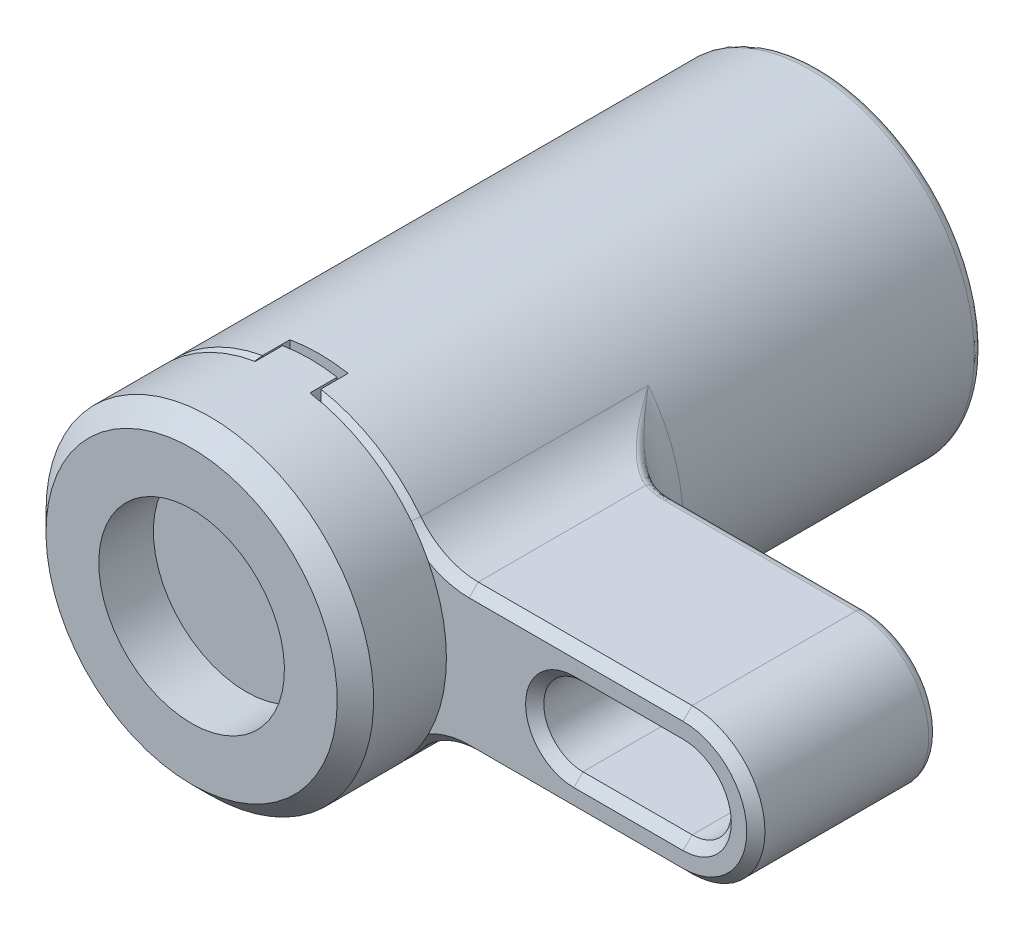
ISO-10303-21;
HEADER;
FILE_DESCRIPTION(('STEP AP214'),'2;1');
FILE_NAME('part.step','',(''),(''),'','','');
FILE_SCHEMA(('AUTOMOTIVE_DESIGN { 1 0 10303 214 1 1 1 1 }'));
ENDSEC;
DATA;
#1=APPLICATION_CONTEXT('core data for automotive mechanical design processes');
#2=APPLICATION_PROTOCOL_DEFINITION('international standard','automotive_design',2000,#1);
#3=PRODUCT_CONTEXT('',#1,'mechanical');
#4=PRODUCT('Part','Part','',(#3));
#5=PRODUCT_RELATED_PRODUCT_CATEGORY('part','',(#4));
#6=PRODUCT_DEFINITION_FORMATION('','',#4);
#7=PRODUCT_DEFINITION_CONTEXT('part definition',#1,'design');
#8=PRODUCT_DEFINITION('design','',#6,#7);
#9=PRODUCT_DEFINITION_SHAPE('','',#8);
#10=(LENGTH_UNIT() NAMED_UNIT(*) SI_UNIT(.MILLI.,.METRE.));
#11=(NAMED_UNIT(*) PLANE_ANGLE_UNIT() SI_UNIT($,.RADIAN.));
#12=(NAMED_UNIT(*) SI_UNIT($,.STERADIAN.) SOLID_ANGLE_UNIT());
#13=UNCERTAINTY_MEASURE_WITH_UNIT(LENGTH_MEASURE(1.E-05),#10,'distance_accuracy_value','');
#14=(GEOMETRIC_REPRESENTATION_CONTEXT(3) GLOBAL_UNCERTAINTY_ASSIGNED_CONTEXT((#13)) GLOBAL_UNIT_ASSIGNED_CONTEXT((#10,
#11,#12)) REPRESENTATION_CONTEXT('',''));
#15=CARTESIAN_POINT('',(0.,0.,0.));
#16=DIRECTION('',(0.,0.,1.));
#17=DIRECTION('',(1.,0.,0.));
#18=AXIS2_PLACEMENT_3D('',#15,#16,#17);
#19=CARTESIAN_POINT('',(0.,0.,31.5));
#20=DIRECTION('',(0.,0.,1.));
#21=DIRECTION('',(0.,-1.,0.));
#22=AXIS2_PLACEMENT_3D('',#19,#20,#21);
#23=PLANE('',#22);
#24=CARTESIAN_POINT('',(0.,0.,31.5));
#25=DIRECTION('',(0.,0.,-1.));
#26=DIRECTION('',(1.,0.,0.));
#27=AXIS2_PLACEMENT_3D('',#24,#25,#26);
#28=CIRCLE('',#27,5.1);
#29=CARTESIAN_POINT('',(5.1,0.,31.5));
#30=VERTEX_POINT('',#29);
#31=EDGE_CURVE('E9',#30,#30,#28,.F.);
#32=ORIENTED_EDGE('',*,*,#31,.T.);
#33=EDGE_LOOP('',(#32));
#34=FACE_BOUND('',#33,.T.);
#35=ADVANCED_FACE('F14',(#34),#23,.T.);
#36=CARTESIAN_POINT('',(0.,0.,28.));
#37=DIRECTION('',(0.,0.,-1.));
#38=DIRECTION('',(0.,1.,0.));
#39=AXIS2_PLACEMENT_3D('',#36,#37,#38);
#40=PLANE('',#39);
#41=DIRECTION('',(0.,1.,0.));
#42=VECTOR('',#41,1.);
#43=CARTESIAN_POINT('',(1.5,-8.87411967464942,28.));
#44=LINE('',#43,#42);
#45=CARTESIAN_POINT('',(1.5,-8.87411967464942,28.));
#46=VERTEX_POINT('',#45);
#47=CARTESIAN_POINT('',(1.5,-6.83739716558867,28.));
#48=VERTEX_POINT('',#47);
#49=EDGE_CURVE('E473',#46,#48,#44,.T.);
#50=ORIENTED_EDGE('',*,*,#49,.F.);
#51=CARTESIAN_POINT('',(0.,0.,28.));
#52=DIRECTION('',(0.,0.,1.));
#53=DIRECTION('',(0.,1.,0.));
#54=AXIS2_PLACEMENT_3D('',#51,#52,#53);
#55=CIRCLE('',#54,9.);
#56=CARTESIAN_POINT('',(-1.5,-8.87411967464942,28.));
#57=VERTEX_POINT('',#56);
#58=EDGE_CURVE('E469',#57,#46,#55,.T.);
#59=ORIENTED_EDGE('',*,*,#58,.F.);
#60=DIRECTION('',(0.,-1.,0.));
#61=VECTOR('',#60,1.);
#62=CARTESIAN_POINT('',(-1.5,8.87411967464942,28.));
#63=LINE('',#62,#61);
#64=CARTESIAN_POINT('',(-1.5,-6.83739716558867,28.));
#65=VERTEX_POINT('',#64);
#66=EDGE_CURVE('E464',#65,#57,#63,.T.);
#67=ORIENTED_EDGE('',*,*,#66,.F.);
#68=CARTESIAN_POINT('',(0.,0.,28.));
#69=DIRECTION('',(0.,0.,1.));
#70=DIRECTION('',(-1.,0.,0.));
#71=AXIS2_PLACEMENT_3D('',#68,#69,#70);
#72=CIRCLE('',#71,7.);
#73=EDGE_CURVE('E543',#48,#65,#72,.F.);
#74=ORIENTED_EDGE('',*,*,#73,.F.);
#75=EDGE_LOOP('',(#50,#59,#67,#74));
#76=FACE_BOUND('',#75,.T.);
#77=ADVANCED_FACE('F540',(#76),#40,.T.);
#78=CARTESIAN_POINT('',(-1.5,8.87411967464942,28.));
#79=VERTEX_POINT('',#78);
#80=CARTESIAN_POINT('',(-1.5,6.83739716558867,28.));
#81=VERTEX_POINT('',#80);
#82=EDGE_CURVE('E466',#79,#81,#63,.T.);
#83=ORIENTED_EDGE('',*,*,#82,.F.);
#84=CARTESIAN_POINT('',(0.,0.,28.));
#85=DIRECTION('',(0.,0.,1.));
#86=DIRECTION('',(0.,1.,0.));
#87=AXIS2_PLACEMENT_3D('',#84,#85,#86);
#88=CIRCLE('',#87,9.);
#89=CARTESIAN_POINT('',(1.5,8.87411967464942,28.));
#90=VERTEX_POINT('',#89);
#91=EDGE_CURVE('E461',#90,#79,#88,.T.);
#92=ORIENTED_EDGE('',*,*,#91,.F.);
#93=CARTESIAN_POINT('',(1.5,6.83739716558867,28.));
#94=VERTEX_POINT('',#93);
#95=EDGE_CURVE('E472',#94,#90,#44,.T.);
#96=ORIENTED_EDGE('',*,*,#95,.F.);
#97=CARTESIAN_POINT('',(0.,0.,28.));
#98=DIRECTION('',(0.,0.,1.));
#99=DIRECTION('',(-1.,0.,0.));
#100=AXIS2_PLACEMENT_3D('',#97,#98,#99);
#101=CIRCLE('',#100,7.);
#102=EDGE_CURVE('E700',#81,#94,#101,.F.);
#103=ORIENTED_EDGE('',*,*,#102,.F.);
#104=EDGE_LOOP('',(#83,#92,#96,#103));
#105=FACE_BOUND('',#104,.T.);
#106=ADVANCED_FACE('F1018',(#105),#40,.T.);
#107=CARTESIAN_POINT('',(1.5,-8.87411967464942,28.));
#108=DIRECTION('',(-1.,0.,0.));
#109=DIRECTION('',(0.,1.,0.));
#110=AXIS2_PLACEMENT_3D('',#107,#108,#109);
#111=PLANE('',#110);
#112=DIRECTION('',(0.,0.,1.));
#113=VECTOR('',#112,1.);
#114=CARTESIAN_POINT('',(1.5,-6.83739716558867,4.72828210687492));
#115=LINE('',#114,#113);
#116=CARTESIAN_POINT('',(1.5,-6.83739716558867,29.5));
#117=VERTEX_POINT('',#116);
#118=EDGE_CURVE('E460',#48,#117,#115,.T.);
#119=ORIENTED_EDGE('',*,*,#118,.T.);
#120=DIRECTION('',(0.,1.,0.));
#121=VECTOR('',#120,1.);
#122=CARTESIAN_POINT('',(1.5,-8.87411967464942,29.5));
#123=LINE('',#122,#121);
#124=CARTESIAN_POINT('',(1.5,-8.87411967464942,29.5));
#125=VERTEX_POINT('',#124);
#126=EDGE_CURVE('E465',#125,#117,#123,.T.);
#127=ORIENTED_EDGE('',*,*,#126,.F.);
#128=DIRECTION('',(0.,0.,1.));
#129=VECTOR('',#128,1.);
#130=CARTESIAN_POINT('',(1.5,-8.87411967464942,28.));
#131=LINE('',#130,#129);
#132=EDGE_CURVE('E513',#46,#125,#131,.T.);
#133=ORIENTED_EDGE('',*,*,#132,.F.);
#134=ORIENTED_EDGE('',*,*,#49,.T.);
#135=EDGE_LOOP('',(#119,#127,#133,#134));
#136=FACE_BOUND('',#135,.T.);
#137=ADVANCED_FACE('F546',(#136),#111,.F.);
#138=DIRECTION('',(0.,0.,1.));
#139=VECTOR('',#138,1.);
#140=CARTESIAN_POINT('',(1.5,6.83739716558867,4.72828210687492));
#141=LINE('',#140,#139);
#142=CARTESIAN_POINT('',(1.5,6.83739716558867,29.5));
#143=VERTEX_POINT('',#142);
#144=EDGE_CURVE('E697',#143,#94,#141,.F.);
#145=ORIENTED_EDGE('',*,*,#144,.T.);
#146=ORIENTED_EDGE('',*,*,#95,.T.);
#147=DIRECTION('',(0.,0.,1.));
#148=VECTOR('',#147,1.);
#149=CARTESIAN_POINT('',(1.5,8.87411967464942,28.));
#150=LINE('',#149,#148);
#151=CARTESIAN_POINT('',(1.5,8.87411967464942,29.5));
#152=VERTEX_POINT('',#151);
#153=EDGE_CURVE('E476',#90,#152,#150,.T.);
#154=ORIENTED_EDGE('',*,*,#153,.T.);
#155=EDGE_CURVE('E489',#143,#152,#123,.T.);
#156=ORIENTED_EDGE('',*,*,#155,.F.);
#157=EDGE_LOOP('',(#145,#146,#154,#156));
#158=FACE_BOUND('',#157,.T.);
#159=ADVANCED_FACE('F1032',(#158),#111,.F.);
#160=CARTESIAN_POINT('',(-1.5,8.87411967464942,28.));
#161=DIRECTION('',(1.,0.,0.));
#162=DIRECTION('',(0.,-1.,0.));
#163=AXIS2_PLACEMENT_3D('',#160,#161,#162);
#164=PLANE('',#163);
#165=DIRECTION('',(0.,0.,1.));
#166=VECTOR('',#165,1.);
#167=CARTESIAN_POINT('',(-1.5,-6.83739716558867,4.72828210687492));
#168=LINE('',#167,#166);
#169=CARTESIAN_POINT('',(-1.5,-6.83739716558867,29.5));
#170=VERTEX_POINT('',#169);
#171=EDGE_CURVE('E695',#170,#65,#168,.F.);
#172=ORIENTED_EDGE('',*,*,#171,.T.);
#173=ORIENTED_EDGE('',*,*,#66,.T.);
#174=DIRECTION('',(0.,0.,1.));
#175=VECTOR('',#174,1.);
#176=CARTESIAN_POINT('',(-1.5,-8.87411967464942,28.));
#177=LINE('',#176,#175);
#178=CARTESIAN_POINT('',(-1.5,-8.87411967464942,29.5));
#179=VERTEX_POINT('',#178);
#180=EDGE_CURVE('E515',#57,#179,#177,.T.);
#181=ORIENTED_EDGE('',*,*,#180,.T.);
#182=DIRECTION('',(0.,-1.,0.));
#183=VECTOR('',#182,1.);
#184=CARTESIAN_POINT('',(-1.5,8.87411967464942,29.5));
#185=LINE('',#184,#183);
#186=EDGE_CURVE('E459',#170,#179,#185,.T.);
#187=ORIENTED_EDGE('',*,*,#186,.F.);
#188=EDGE_LOOP('',(#172,#173,#181,#187));
#189=FACE_BOUND('',#188,.T.);
#190=ADVANCED_FACE('F530',(#189),#164,.F.);
#191=DIRECTION('',(0.,0.,1.));
#192=VECTOR('',#191,1.);
#193=CARTESIAN_POINT('',(-1.5,6.83739716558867,4.72828210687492));
#194=LINE('',#193,#192);
#195=CARTESIAN_POINT('',(-1.5,6.83739716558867,29.5));
#196=VERTEX_POINT('',#195);
#197=EDGE_CURVE('E703',#81,#196,#194,.T.);
#198=ORIENTED_EDGE('',*,*,#197,.T.);
#199=CARTESIAN_POINT('',(-1.5,8.87411967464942,29.5));
#200=VERTEX_POINT('',#199);
#201=EDGE_CURVE('E483',#200,#196,#185,.T.);
#202=ORIENTED_EDGE('',*,*,#201,.F.);
#203=DIRECTION('',(0.,0.,1.));
#204=VECTOR('',#203,1.);
#205=CARTESIAN_POINT('',(-1.5,8.87411967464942,28.));
#206=LINE('',#205,#204);
#207=EDGE_CURVE('E494',#79,#200,#206,.T.);
#208=ORIENTED_EDGE('',*,*,#207,.F.);
#209=ORIENTED_EDGE('',*,*,#82,.T.);
#210=EDGE_LOOP('',(#198,#202,#208,#209));
#211=FACE_BOUND('',#210,.T.);
#212=ADVANCED_FACE('F1035',(#211),#164,.F.);
#213=CARTESIAN_POINT('',(0.,0.,29.5));
#214=DIRECTION('',(0.,0.,-1.));
#215=DIRECTION('',(0.,1.,0.));
#216=AXIS2_PLACEMENT_3D('',#213,#214,#215);
#217=PLANE('',#216);
#218=DIRECTION('',(0.,-1.,0.));
#219=VECTOR('',#218,1.);
#220=CARTESIAN_POINT('',(-2.1,6.81469001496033,29.5));
#221=LINE('',#220,#219);
#222=CARTESIAN_POINT('',(-2.1,8.23650411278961,29.5));
#223=VERTEX_POINT('',#222);
#224=CARTESIAN_POINT('',(-2.1,6.67757440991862,29.5));
#225=VERTEX_POINT('',#224);
#226=EDGE_CURVE('E720',#223,#225,#221,.T.);
#227=ORIENTED_EDGE('',*,*,#226,.F.);
#228=CARTESIAN_POINT('',(0.,0.,29.5));
#229=DIRECTION('',(0.,0.,-1.));
#230=DIRECTION('',(0.,-1.,0.));
#231=AXIS2_PLACEMENT_3D('',#228,#229,#230);
#232=CIRCLE('',#231,8.5);
#233=CARTESIAN_POINT('',(-2.1,-8.23650411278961,29.5));
#234=VERTEX_POINT('',#233);
#235=EDGE_CURVE('E736',#234,#223,#232,.T.);
#236=ORIENTED_EDGE('',*,*,#235,.F.);
#237=DIRECTION('',(0.,-1.,0.));
#238=VECTOR('',#237,1.);
#239=CARTESIAN_POINT('',(-2.1,-8.85663593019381,29.5));
#240=LINE('',#239,#238);
#241=CARTESIAN_POINT('',(-2.1,-6.67757440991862,29.5));
#242=VERTEX_POINT('',#241);
#243=EDGE_CURVE('E740',#242,#234,#240,.T.);
#244=ORIENTED_EDGE('',*,*,#243,.F.);
#245=CARTESIAN_POINT('',(0.,0.,29.5));
#246=DIRECTION('',(0.,0.,1.));
#247=DIRECTION('',(-1.,0.,0.));
#248=AXIS2_PLACEMENT_3D('',#245,#246,#247);
#249=CIRCLE('',#248,7.);
#250=EDGE_CURVE('E706',#242,#170,#249,.T.);
#251=ORIENTED_EDGE('',*,*,#250,.T.);
#252=ORIENTED_EDGE('',*,*,#186,.T.);
#253=CARTESIAN_POINT('',(0.,0.,29.5));
#254=DIRECTION('',(0.,0.,1.));
#255=DIRECTION('',(0.,1.,0.));
#256=AXIS2_PLACEMENT_3D('',#253,#254,#255);
#257=CIRCLE('',#256,9.);
#258=EDGE_CURVE('E498',#200,#179,#257,.T.);
#259=ORIENTED_EDGE('',*,*,#258,.F.);
#260=ORIENTED_EDGE('',*,*,#201,.T.);
#261=EDGE_CURVE('E708',#196,#225,#249,.T.);
#262=ORIENTED_EDGE('',*,*,#261,.T.);
#263=EDGE_LOOP('',(#227,#236,#244,#251,#252,#259,#260,#262));
#264=FACE_BOUND('',#263,.T.);
#265=ADVANCED_FACE('F718',(#264),#217,.T.);
#266=ORIENTED_EDGE('',*,*,#155,.T.);
#267=CARTESIAN_POINT('',(8.01597299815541,4.09196491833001,29.5));
#268=VERTEX_POINT('',#267);
#269=EDGE_CURVE('E71',#268,#152,#257,.T.);
#270=ORIENTED_EDGE('',*,*,#269,.F.);
#271=CARTESIAN_POINT('',(10.2469507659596,8.,29.5));
#272=DIRECTION('',(0.,0.,-1.));
#273=DIRECTION('',(0.,-1.,0.));
#274=AXIS2_PLACEMENT_3D('',#271,#272,#273);
#275=CIRCLE('',#274,4.5);
#276=CARTESIAN_POINT('',(6.69992934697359,5.23076923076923,29.5));
#277=VERTEX_POINT('',#276);
#278=EDGE_CURVE('E2112',#277,#268,#275,.F.);
#279=ORIENTED_EDGE('',*,*,#278,.F.);
#280=CARTESIAN_POINT('',(0.,0.,29.5));
#281=DIRECTION('',(0.,0.,-1.));
#282=DIRECTION('',(0.,-1.,0.));
#283=AXIS2_PLACEMENT_3D('',#280,#281,#282);
#284=CIRCLE('',#283,8.5);
#285=CARTESIAN_POINT('',(2.1,8.23650411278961,29.5));
#286=VERTEX_POINT('',#285);
#287=EDGE_CURVE('E2115',#286,#277,#284,.T.);
#288=ORIENTED_EDGE('',*,*,#287,.F.);
#289=DIRECTION('',(0.,1.,0.));
#290=VECTOR('',#289,1.);
#291=CARTESIAN_POINT('',(2.1,8.85663593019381,29.5));
#292=LINE('',#291,#290);
#293=CARTESIAN_POINT('',(2.1,6.67757440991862,29.5));
#294=VERTEX_POINT('',#293);
#295=EDGE_CURVE('E2118',#294,#286,#292,.T.);
#296=ORIENTED_EDGE('',*,*,#295,.F.);
#297=CARTESIAN_POINT('',(0.,0.,29.5));
#298=DIRECTION('',(0.,0.,1.));
#299=DIRECTION('',(-1.,0.,0.));
#300=AXIS2_PLACEMENT_3D('',#297,#298,#299);
#301=CIRCLE('',#300,7.);
#302=EDGE_CURVE('E22',#143,#294,#301,.F.);
#303=ORIENTED_EDGE('',*,*,#302,.F.);
#304=EDGE_LOOP('',(#266,#270,#279,#288,#296,#303));
#305=FACE_BOUND('',#304,.T.);
#306=ADVANCED_FACE('F1038',(#305),#217,.T.);
#307=DIRECTION('',(0.,1.,0.));
#308=VECTOR('',#307,1.);
#309=CARTESIAN_POINT('',(2.1,-6.81469001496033,29.5));
#310=LINE('',#309,#308);
#311=CARTESIAN_POINT('',(2.1,-8.23650411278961,29.5));
#312=VERTEX_POINT('',#311);
#313=CARTESIAN_POINT('',(2.1,-6.67757440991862,29.5));
#314=VERTEX_POINT('',#313);
#315=EDGE_CURVE('E2150',#312,#314,#310,.T.);
#316=ORIENTED_EDGE('',*,*,#315,.F.);
#317=CARTESIAN_POINT('',(0.,0.,29.5));
#318=DIRECTION('',(0.,0.,-1.));
#319=DIRECTION('',(0.,-1.,0.));
#320=AXIS2_PLACEMENT_3D('',#317,#318,#319);
#321=CIRCLE('',#320,8.5);
#322=CARTESIAN_POINT('',(6.69992934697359,-5.23076923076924,29.5));
#323=VERTEX_POINT('',#322);
#324=EDGE_CURVE('E2152',#323,#312,#321,.T.);
#325=ORIENTED_EDGE('',*,*,#324,.F.);
#326=CARTESIAN_POINT('',(10.2469507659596,-8.,29.5));
#327=DIRECTION('',(0.,0.,-1.));
#328=DIRECTION('',(0.,-1.,0.));
#329=AXIS2_PLACEMENT_3D('',#326,#327,#328);
#330=CIRCLE('',#329,4.5);
#331=CARTESIAN_POINT('',(8.01597299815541,-4.09196491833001,29.5));
#332=VERTEX_POINT('',#331);
#333=EDGE_CURVE('E2077',#332,#323,#330,.F.);
#334=ORIENTED_EDGE('',*,*,#333,.F.);
#335=EDGE_CURVE('E493',#125,#332,#257,.T.);
#336=ORIENTED_EDGE('',*,*,#335,.F.);
#337=ORIENTED_EDGE('',*,*,#126,.T.);
#338=EDGE_CURVE('E29',#314,#117,#301,.F.);
#339=ORIENTED_EDGE('',*,*,#338,.F.);
#340=EDGE_LOOP('',(#316,#325,#334,#336,#337,#339));
#341=FACE_BOUND('',#340,.T.);
#342=ADVANCED_FACE('F641',(#341),#217,.T.);
#343=CARTESIAN_POINT('',(0.,0.,29.5));
#344=DIRECTION('',(0.,0.,-1.));
#345=DIRECTION('',(0.,1.,0.));
#346=AXIS2_PLACEMENT_3D('',#343,#344,#345);
#347=CYLINDRICAL_SURFACE('',#346,9.);
#348=DIRECTION('',(0.,0.,-1.));
#349=VECTOR('',#348,1.);
#350=CARTESIAN_POINT('',(-8.964373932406,0.8,29.5));
#351=LINE('',#350,#349);
#352=CARTESIAN_POINT('',(-8.964373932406,0.8,26.));
#353=VERTEX_POINT('',#352);
#354=CARTESIAN_POINT('',(-8.964373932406,0.8,25.25));
#355=VERTEX_POINT('',#354);
#356=EDGE_CURVE('E334',#353,#355,#351,.T.);
#357=ORIENTED_EDGE('',*,*,#356,.F.);
#358=CARTESIAN_POINT('',(-8.33385133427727,3.39807621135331,24.5));
#359=CARTESIAN_POINT('',(-8.58781484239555,2.77503810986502,24.8597112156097));
#360=CARTESIAN_POINT('',(-8.74612196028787,2.12258113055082,25.2364074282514));
#361=CARTESIAN_POINT('',(-8.90454066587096,1.46966424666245,25.6133691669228));
#362=CARTESIAN_POINT('',(-8.964373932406,0.8,26.));
#363=B_SPLINE_CURVE_WITH_KNOTS('',2,(#358,#359,#360,#361,#362),.UNSPECIFIED.,.F.,.F.,(3,2,3),
(0.,0.5,1.),.UNSPECIFIED.);
#364=CARTESIAN_POINT('',(-8.33385133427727,3.39807621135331,24.5));
#365=VERTEX_POINT('',#364);
#366=EDGE_CURVE('E335',#365,#353,#363,.T.);
#367=ORIENTED_EDGE('',*,*,#366,.F.);
#368=CARTESIAN_POINT('',(-8.964373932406,0.799999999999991,23.));
#369=CARTESIAN_POINT('',(-8.90449807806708,1.47014089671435,23.386906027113));
#370=CARTESIAN_POINT('',(-8.74612196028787,2.12258113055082,23.7635925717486));
#371=CARTESIAN_POINT('',(-8.58763420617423,2.77548125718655,24.1405446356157));
#372=CARTESIAN_POINT('',(-8.33385133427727,3.39807621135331,24.5));
#373=B_SPLINE_CURVE_WITH_KNOTS('',2,(#368,#369,#370,#371,#372),.UNSPECIFIED.,.F.,.F.,(3,2,3),
(0.,0.5,1.),.UNSPECIFIED.);
#374=CARTESIAN_POINT('',(-8.964373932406,0.8,23.));
#375=VERTEX_POINT('',#374);
#376=EDGE_CURVE('E606',#375,#365,#373,.T.);
#377=ORIENTED_EDGE('',*,*,#376,.F.);
#378=DIRECTION('',(0.,0.,-1.));
#379=VECTOR('',#378,1.);
#380=CARTESIAN_POINT('',(-8.964373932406,0.8,29.5));
#381=LINE('',#380,#379);
#382=CARTESIAN_POINT('',(-8.964373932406,0.8,23.75));
#383=VERTEX_POINT('',#382);
#384=EDGE_CURVE('E665',#383,#375,#381,.T.);
#385=ORIENTED_EDGE('',*,*,#384,.F.);
#386=CARTESIAN_POINT('',(0.,0.,23.75));
#387=DIRECTION('',(0.,0.,-1.));
#388=DIRECTION('',(0.,-1.,0.));
#389=AXIS2_PLACEMENT_3D('',#386,#387,#388);
#390=CIRCLE('',#389,9.);
#391=CARTESIAN_POINT('',(-8.41189633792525,-3.2,23.75));
#392=VERTEX_POINT('',#391);
#393=EDGE_CURVE('E678',#392,#383,#390,.T.);
#394=ORIENTED_EDGE('',*,*,#393,.F.);
#395=DIRECTION('',(0.,0.,-1.));
#396=VECTOR('',#395,1.);
#397=CARTESIAN_POINT('',(-8.41189633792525,-3.2,29.5));
#398=LINE('',#397,#396);
#399=CARTESIAN_POINT('',(-8.41189633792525,-3.2,25.25));
#400=VERTEX_POINT('',#399);
#401=EDGE_CURVE('E688',#400,#392,#398,.T.);
#402=ORIENTED_EDGE('',*,*,#401,.F.);
#403=CARTESIAN_POINT('',(0.,0.,25.25));
#404=DIRECTION('',(0.,0.,1.));
#405=DIRECTION('',(0.,1.,0.));
#406=AXIS2_PLACEMENT_3D('',#403,#404,#405);
#407=CIRCLE('',#406,9.);
#408=EDGE_CURVE('E316',#355,#400,#407,.T.);
#409=ORIENTED_EDGE('',*,*,#408,.F.);
#410=EDGE_LOOP('',(#357,#367,#377,#385,#394,#402,#409));
#411=FACE_BOUND('',#410,.T.);
#412=ADVANCED_FACE('F618',(#411),#347,.T.);
#413=CARTESIAN_POINT('',(0.,0.,35.2413951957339));
#414=DIRECTION('',(0.,0.,1.));
#415=DIRECTION('',(0.,-1.,0.));
#416=AXIS2_PLACEMENT_3D('',#413,#414,#415);
#417=CYLINDRICAL_SURFACE('',#416,6.);
#418=CARTESIAN_POINT('',(0.,0.,1.));
#419=DIRECTION('',(0.,0.,-1.));
#420=DIRECTION('',(0.,-1.,0.));
#421=AXIS2_PLACEMENT_3D('',#418,#419,#420);
#422=CIRCLE('',#421,6.);
#423=CARTESIAN_POINT('',(0.,-6.,1.));
#424=VERTEX_POINT('',#423);
#425=EDGE_CURVE('E455',#424,#424,#422,.F.);
#426=ORIENTED_EDGE('',*,*,#425,.F.);
#427=EDGE_LOOP('',(#426));
#428=FACE_BOUND('',#427,.T.);
#429=CARTESIAN_POINT('',(0.,0.,20.));
#430=DIRECTION('',(0.,0.,-1.));
#431=DIRECTION('',(0.,-1.,0.));
#432=AXIS2_PLACEMENT_3D('',#429,#430,#431);
#433=CIRCLE('',#432,6.);
#434=CARTESIAN_POINT('',(0.,-6.,20.));
#435=VERTEX_POINT('',#434);
#436=EDGE_CURVE('E1871',#435,#435,#433,.T.);
#437=ORIENTED_EDGE('',*,*,#436,.F.);
#438=EDGE_LOOP('',(#437));
#439=FACE_BOUND('',#438,.T.);
#440=ADVANCED_FACE('F640',(#428,#439),#417,.F.);
#441=CARTESIAN_POINT('',(-8.11189633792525,-3.2,29.5));
#442=DIRECTION('',(0.,-1.,0.));
#443=DIRECTION('',(-1.,0.,0.));
#444=AXIS2_PLACEMENT_3D('',#441,#442,#443);
#445=PLANE('',#444);
#446=ORIENTED_EDGE('',*,*,#401,.T.);
#447=DIRECTION('',(-1.,0.,0.));
#448=VECTOR('',#447,1.);
#449=CARTESIAN_POINT('',(-8.11189633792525,-3.2,23.75));
#450=LINE('',#449,#448);
#451=CARTESIAN_POINT('',(-8.11189633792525,-3.2,23.75));
#452=VERTEX_POINT('',#451);
#453=EDGE_CURVE('E681',#452,#392,#450,.T.);
#454=ORIENTED_EDGE('',*,*,#453,.F.);
#455=DIRECTION('',(0.,0.,-1.));
#456=VECTOR('',#455,1.);
#457=CARTESIAN_POINT('',(-8.11189633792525,-3.2,29.5));
#458=LINE('',#457,#456);
#459=CARTESIAN_POINT('',(-8.11189633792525,-3.2,25.25));
#460=VERTEX_POINT('',#459);
#461=EDGE_CURVE('E345',#460,#452,#458,.T.);
#462=ORIENTED_EDGE('',*,*,#461,.F.);
#463=DIRECTION('',(-1.,0.,0.));
#464=VECTOR('',#463,1.);
#465=CARTESIAN_POINT('',(-8.11189633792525,-3.2,25.25));
#466=LINE('',#465,#464);
#467=EDGE_CURVE('E311',#460,#400,#466,.T.);
#468=ORIENTED_EDGE('',*,*,#467,.T.);
#469=EDGE_LOOP('',(#446,#454,#462,#468));
#470=FACE_BOUND('',#469,.T.);
#471=ADVANCED_FACE('F1117',(#470),#445,.T.);
#472=CARTESIAN_POINT('',(-8.664373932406,0.8,23.75));
#473=DIRECTION('',(0.,0.,-1.));
#474=DIRECTION('',(0.,1.,0.));
#475=AXIS2_PLACEMENT_3D('',#472,#473,#474);
#476=PLANE('',#475);
#477=ORIENTED_EDGE('',*,*,#393,.T.);
#478=DIRECTION('',(-1.,0.,0.));
#479=VECTOR('',#478,1.);
#480=CARTESIAN_POINT('',(-8.664373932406,0.8,23.75));
#481=LINE('',#480,#479);
#482=CARTESIAN_POINT('',(-8.664373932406,0.8,23.75));
#483=VERTEX_POINT('',#482);
#484=EDGE_CURVE('E666',#483,#383,#481,.T.);
#485=ORIENTED_EDGE('',*,*,#484,.F.);
#486=CARTESIAN_POINT('',(0.3,0.,23.75));
#487=DIRECTION('',(0.,0.,-1.));
#488=DIRECTION('',(0.,-1.,0.));
#489=AXIS2_PLACEMENT_3D('',#486,#487,#488);
#490=CIRCLE('',#489,9.);
#491=EDGE_CURVE('E686',#452,#483,#490,.T.);
#492=ORIENTED_EDGE('',*,*,#491,.F.);
#493=ORIENTED_EDGE('',*,*,#453,.T.);
#494=EDGE_LOOP('',(#477,#485,#492,#493));
#495=FACE_BOUND('',#494,.T.);
#496=ADVANCED_FACE('F1110',(#495),#476,.T.);
#497=CARTESIAN_POINT('',(-8.664373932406,0.8,29.5));
#498=DIRECTION('',(0.,-1.,0.));
#499=DIRECTION('',(-1.,0.,0.));
#500=AXIS2_PLACEMENT_3D('',#497,#498,#499);
#501=PLANE('',#500);
#502=ORIENTED_EDGE('',*,*,#384,.T.);
#503=DIRECTION('',(-1.,0.,0.));
#504=VECTOR('',#503,1.);
#505=CARTESIAN_POINT('',(-8.664373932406,0.8,23.));
#506=LINE('',#505,#504);
#507=CARTESIAN_POINT('',(-8.664373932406,0.8,23.));
#508=VERTEX_POINT('',#507);
#509=EDGE_CURVE('E610',#508,#375,#506,.T.);
#510=ORIENTED_EDGE('',*,*,#509,.F.);
#511=DIRECTION('',(0.,0.,-1.));
#512=VECTOR('',#511,1.);
#513=CARTESIAN_POINT('',(-8.664373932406,0.8,29.5));
#514=LINE('',#513,#512);
#515=EDGE_CURVE('E669',#483,#508,#514,.T.);
#516=ORIENTED_EDGE('',*,*,#515,.F.);
#517=ORIENTED_EDGE('',*,*,#484,.T.);
#518=EDGE_LOOP('',(#502,#510,#516,#517));
#519=FACE_BOUND('',#518,.T.);
#520=ADVANCED_FACE('F1104',(#519),#501,.T.);
#521=CARTESIAN_POINT('',(-8.03385133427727,3.39807621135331,24.5));
#522=DIRECTION('',(0.,0.5,-0.866025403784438));
#523=DIRECTION('',(0.,0.866025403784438,0.5));
#524=AXIS2_PLACEMENT_3D('',#521,#522,#523);
#525=PLANE('',#524);
#526=ORIENTED_EDGE('',*,*,#376,.T.);
#527=DIRECTION('',(-1.,0.,0.));
#528=VECTOR('',#527,1.);
#529=CARTESIAN_POINT('',(-8.03385133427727,3.39807621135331,24.5));
#530=LINE('',#529,#528);
#531=CARTESIAN_POINT('',(-8.03385133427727,3.39807621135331,24.5));
#532=VERTEX_POINT('',#531);
#533=EDGE_CURVE('E338',#532,#365,#530,.T.);
#534=ORIENTED_EDGE('',*,*,#533,.F.);
#535=CARTESIAN_POINT('',(-8.66437393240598,0.800000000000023,23.));
#536=CARTESIAN_POINT('',(-8.65331875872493,0.923883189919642,23.0715193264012));
#537=CARTESIAN_POINT('',(-8.63968912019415,1.04760004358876,23.1429286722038));
#538=CARTESIAN_POINT('',(-8.60840003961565,1.28602099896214,23.2805491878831));
#539=CARTESIAN_POINT('',(-8.59108280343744,1.40075897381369,23.3467796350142));
#540=CARTESIAN_POINT('',(-8.55343533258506,1.62118572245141,23.4740454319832));
#541=CARTESIAN_POINT('',(-8.53342269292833,1.72691611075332,23.5351027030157));
#542=CARTESIAN_POINT('',(-8.49132535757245,1.9293565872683,23.6520132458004));
#543=CARTESIAN_POINT('',(-8.46953380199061,2.02611267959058,23.7078926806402));
#544=CARTESIAN_POINT('',(-8.41826683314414,2.23735813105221,23.8298636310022));
#545=CARTESIAN_POINT('',(-8.38811803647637,2.35172794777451,23.8958805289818));
#546=CARTESIAN_POINT('',(-8.32450064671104,2.57506161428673,24.0248021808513));
#547=CARTESIAN_POINT('',(-8.29120644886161,2.68406291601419,24.0877282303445));
#548=CARTESIAN_POINT('',(-8.22182141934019,2.89664478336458,24.2104642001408));
#549=CARTESIAN_POINT('',(-8.18589781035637,3.00026650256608,24.2702973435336));
#550=CARTESIAN_POINT('',(-8.11175417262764,3.20210230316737,24.3868425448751));
#551=CARTESIAN_POINT('',(-8.07369424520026,3.30036054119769,24.4435800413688));
#552=CARTESIAN_POINT('',(-8.03385133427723,3.39807621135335,24.5));
#553=B_SPLINE_CURVE_WITH_KNOTS('',3,(#535,#536,#537,#538,#539,#540,#541,#542,#543,#544,#545,
#546,#547,#548,#549,#550,#551,#552),.UNSPECIFIED.,.F.,.F.,(4,2,2,2,2,2,2,2,4),(0.,
0.430392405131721,0.831141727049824,1.20224969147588,1.54371866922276,1.94999434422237,
2.34049217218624,2.71522120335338,3.07419170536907),.UNSPECIFIED.);
#554=EDGE_CURVE('E667',#508,#532,#553,.T.);
#555=ORIENTED_EDGE('',*,*,#554,.F.);
#556=ORIENTED_EDGE('',*,*,#509,.T.);
#557=EDGE_LOOP('',(#526,#534,#555,#556));
#558=FACE_BOUND('',#557,.T.);
#559=ADVANCED_FACE('F608',(#558),#525,.T.);
#560=CARTESIAN_POINT('',(-8.664373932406,0.8,26.));
#561=DIRECTION('',(0.,0.5,0.866025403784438));
#562=DIRECTION('',(0.,-0.866025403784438,0.5));
#563=AXIS2_PLACEMENT_3D('',#560,#561,#562);
#564=PLANE('',#563);
#565=ORIENTED_EDGE('',*,*,#366,.T.);
#566=DIRECTION('',(-1.,0.,0.));
#567=VECTOR('',#566,1.);
#568=CARTESIAN_POINT('',(-8.664373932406,0.8,26.));
#569=LINE('',#568,#567);
#570=CARTESIAN_POINT('',(-8.664373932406,0.8,26.));
#571=VERTEX_POINT('',#570);
#572=EDGE_CURVE('E329',#571,#353,#569,.T.);
#573=ORIENTED_EDGE('',*,*,#572,.F.);
#574=CARTESIAN_POINT('',(-8.03385133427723,3.39807621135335,24.5));
#575=CARTESIAN_POINT('',(-8.0736959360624,3.30035639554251,24.5564223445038));
#576=CARTESIAN_POINT('',(-8.11175740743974,3.20209395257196,24.6131622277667));
#577=CARTESIAN_POINT('',(-8.18590280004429,3.00025244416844,24.7297106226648));
#578=CARTESIAN_POINT('',(-8.22182671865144,2.89662924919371,24.7895445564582));
#579=CARTESIAN_POINT('',(-8.29121132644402,2.68404724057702,24.9122805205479));
#580=CARTESIAN_POINT('',(-8.32450490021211,2.57504730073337,24.9752057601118));
#581=CARTESIAN_POINT('',(-8.38812032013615,2.35171928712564,25.1041242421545));
#582=CARTESIAN_POINT('',(-8.41826788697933,2.23735378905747,25.1701387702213));
#583=CARTESIAN_POINT('',(-8.46953537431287,2.02610620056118,25.2921111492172));
#584=CARTESIAN_POINT('',(-8.49132828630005,1.92934358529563,25.3479944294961));
#585=CARTESIAN_POINT('',(-8.53342697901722,1.72689432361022,25.4649101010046));
#586=CARTESIAN_POINT('',(-8.55343975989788,1.62116169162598,25.5259686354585));
#587=CARTESIAN_POINT('',(-8.59108657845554,1.4007348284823,25.6532344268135));
#588=CARTESIAN_POINT('',(-8.60840318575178,1.28599900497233,25.7194635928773));
#589=CARTESIAN_POINT('',(-8.63969058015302,1.04758679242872,25.8570789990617));
#590=CARTESIAN_POINT('',(-8.65331935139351,0.923876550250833,25.9284845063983));
#591=CARTESIAN_POINT('',(-8.66437393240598,0.800000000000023,26.));
#592=B_SPLINE_CURVE_WITH_KNOTS('',3,(#574,#575,#576,#577,#578,#579,#580,#581,#582,#583,#584,
#585,#586,#587,#588,#589,#590,#591),.UNSPECIFIED.,.F.,.F.,(4,2,2,2,2,2,2,2,4),(0.,
0.358985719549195,0.733719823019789,1.12421257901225,1.53047303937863,1.87196508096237,
2.24308073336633,2.64382236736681,3.07419170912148),.UNSPECIFIED.);
#593=EDGE_CURVE('E325',#532,#571,#592,.T.);
#594=ORIENTED_EDGE('',*,*,#593,.F.);
#595=ORIENTED_EDGE('',*,*,#533,.T.);
#596=EDGE_LOOP('',(#565,#573,#594,#595));
#597=FACE_BOUND('',#596,.T.);
#598=ADVANCED_FACE('F599',(#597),#564,.T.);
#599=CARTESIAN_POINT('',(-8.664373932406,0.8,29.5));
#600=DIRECTION('',(0.,-1.,0.));
#601=DIRECTION('',(-1.,0.,0.));
#602=AXIS2_PLACEMENT_3D('',#599,#600,#601);
#603=PLANE('',#602);
#604=ORIENTED_EDGE('',*,*,#356,.T.);
#605=DIRECTION('',(-1.,0.,0.));
#606=VECTOR('',#605,1.);
#607=CARTESIAN_POINT('',(-8.664373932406,0.8,25.25));
#608=LINE('',#607,#606);
#609=CARTESIAN_POINT('',(-8.664373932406,0.8,25.25));
#610=VERTEX_POINT('',#609);
#611=EDGE_CURVE('E80',#610,#355,#608,.T.);
#612=ORIENTED_EDGE('',*,*,#611,.F.);
#613=DIRECTION('',(0.,0.,-1.));
#614=VECTOR('',#613,1.);
#615=CARTESIAN_POINT('',(-8.664373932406,0.8,29.5));
#616=LINE('',#615,#614);
#617=EDGE_CURVE('E320',#571,#610,#616,.T.);
#618=ORIENTED_EDGE('',*,*,#617,.F.);
#619=ORIENTED_EDGE('',*,*,#572,.T.);
#620=EDGE_LOOP('',(#604,#612,#618,#619));
#621=FACE_BOUND('',#620,.T.);
#622=ADVANCED_FACE('F332',(#621),#603,.T.);
#623=CARTESIAN_POINT('',(-8.11189633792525,-3.2,25.25));
#624=DIRECTION('',(0.,0.,1.));
#625=DIRECTION('',(0.,-1.,0.));
#626=AXIS2_PLACEMENT_3D('',#623,#624,#625);
#627=PLANE('',#626);
#628=ORIENTED_EDGE('',*,*,#408,.T.);
#629=ORIENTED_EDGE('',*,*,#467,.F.);
#630=CARTESIAN_POINT('',(0.3,0.,25.25));
#631=DIRECTION('',(0.,0.,1.));
#632=DIRECTION('',(0.,1.,0.));
#633=AXIS2_PLACEMENT_3D('',#630,#631,#632);
#634=CIRCLE('',#633,9.);
#635=EDGE_CURVE('E308',#610,#460,#634,.T.);
#636=ORIENTED_EDGE('',*,*,#635,.F.);
#637=ORIENTED_EDGE('',*,*,#611,.T.);
#638=EDGE_LOOP('',(#628,#629,#636,#637));
#639=FACE_BOUND('',#638,.T.);
#640=ADVANCED_FACE('F310',(#639),#627,.T.);
#641=CARTESIAN_POINT('',(0.,0.,1.));
#642=DIRECTION('',(0.,0.,1.));
#643=DIRECTION('',(0.,-1.,0.));
#644=AXIS2_PLACEMENT_3D('',#641,#642,#643);
#645=TOROIDAL_SURFACE('',#644,7.,1.);
#646=ORIENTED_EDGE('',*,*,#425,.T.);
#647=EDGE_LOOP('',(#646));
#648=FACE_BOUND('',#647,.T.);
#649=CARTESIAN_POINT('',(0.,0.,0.));
#650=DIRECTION('',(0.,0.,1.));
#651=DIRECTION('',(0.,1.,0.));
#652=AXIS2_PLACEMENT_3D('',#649,#650,#651);
#653=CIRCLE('',#652,7.);
#654=CARTESIAN_POINT('',(0.,7.,0.));
#655=VERTEX_POINT('',#654);
#656=EDGE_CURVE('E1864',#655,#655,#653,.T.);
#657=ORIENTED_EDGE('',*,*,#656,.F.);
#658=EDGE_LOOP('',(#657));
#659=FACE_BOUND('',#658,.T.);
#660=ADVANCED_FACE('F1022',(#648,#659),#645,.T.);
#661=CARTESIAN_POINT('',(22.,2.65,20.));
#662=DIRECTION('',(-1.,0.,0.));
#663=DIRECTION('',(0.,1.,0.));
#664=AXIS2_PLACEMENT_3D('',#661,#662,#663);
#665=CYLINDRICAL_SURFACE('',#664,0.5);
#666=CARTESIAN_POINT('',(16.,2.65,20.));
#667=DIRECTION('',(-1.,0.,0.));
#668=DIRECTION('',(0.,-1.,0.));
#669=AXIS2_PLACEMENT_3D('',#666,#667,#668);
#670=CIRCLE('',#669,0.5);
#671=CARTESIAN_POINT('',(16.,2.65,19.5));
#672=VERTEX_POINT('',#671);
#673=CARTESIAN_POINT('',(16.,2.15,20.));
#674=VERTEX_POINT('',#673);
#675=EDGE_CURVE('E913',#672,#674,#670,.T.);
#676=ORIENTED_EDGE('',*,*,#675,.F.);
#677=DIRECTION('',(-1.,0.,0.));
#678=VECTOR('',#677,1.);
#679=CARTESIAN_POINT('',(0.,2.65,19.5));
#680=LINE('',#679,#678);
#681=CARTESIAN_POINT('',(22.,2.65,19.5));
#682=VERTEX_POINT('',#681);
#683=EDGE_CURVE('E1927',#672,#682,#680,.F.);
#684=ORIENTED_EDGE('',*,*,#683,.T.);
#685=CARTESIAN_POINT('',(22.,2.65,20.));
#686=DIRECTION('',(-1.,0.,0.));
#687=DIRECTION('',(0.,-1.,0.));
#688=AXIS2_PLACEMENT_3D('',#685,#686,#687);
#689=CIRCLE('',#688,0.5);
#690=CARTESIAN_POINT('',(22.,2.15,20.));
#691=VERTEX_POINT('',#690);
#692=EDGE_CURVE('E906',#682,#691,#689,.T.);
#693=ORIENTED_EDGE('',*,*,#692,.T.);
#694=DIRECTION('',(-1.,0.,0.));
#695=VECTOR('',#694,1.);
#696=CARTESIAN_POINT('',(22.,2.15,20.));
#697=LINE('',#696,#695);
#698=EDGE_CURVE('E897',#691,#674,#697,.T.);
#699=ORIENTED_EDGE('',*,*,#698,.T.);
#700=EDGE_LOOP('',(#676,#684,#693,#699));
#701=FACE_BOUND('',#700,.T.);
#702=ADVANCED_FACE('F1334',(#701),#665,.T.);
#703=CARTESIAN_POINT('',(22.,0.,20.));
#704=DIRECTION('',(0.,0.,1.));
#705=DIRECTION('',(0.,-1.,0.));
#706=AXIS2_PLACEMENT_3D('',#703,#704,#705);
#707=TOROIDAL_SURFACE('',#706,2.65,0.5);
#708=CARTESIAN_POINT('',(22.,-2.65,20.));
#709=DIRECTION('',(-1.,0.,0.));
#710=DIRECTION('',(0.,-1.,0.));
#711=AXIS2_PLACEMENT_3D('',#708,#709,#710);
#712=CIRCLE('',#711,0.5);
#713=CARTESIAN_POINT('',(22.,-2.15,20.));
#714=VERTEX_POINT('',#713);
#715=CARTESIAN_POINT('',(22.,-2.65,19.5));
#716=VERTEX_POINT('',#715);
#717=EDGE_CURVE('E909',#714,#716,#712,.T.);
#718=ORIENTED_EDGE('',*,*,#717,.F.);
#719=CARTESIAN_POINT('',(22.,0.,20.));
#720=DIRECTION('',(0.,0.,-1.));
#721=DIRECTION('',(0.,-1.,0.));
#722=AXIS2_PLACEMENT_3D('',#719,#720,#721);
#723=CIRCLE('',#722,2.15);
#724=EDGE_CURVE('E1916',#714,#691,#723,.F.);
#725=ORIENTED_EDGE('',*,*,#724,.T.);
#726=ORIENTED_EDGE('',*,*,#692,.F.);
#727=CARTESIAN_POINT('',(22.,0.,19.5));
#728=DIRECTION('',(0.,0.,-1.));
#729=DIRECTION('',(0.,-1.,0.));
#730=AXIS2_PLACEMENT_3D('',#727,#728,#729);
#731=CIRCLE('',#730,2.65);
#732=EDGE_CURVE('E1935',#682,#716,#731,.T.);
#733=ORIENTED_EDGE('',*,*,#732,.T.);
#734=EDGE_LOOP('',(#718,#725,#726,#733));
#735=FACE_BOUND('',#734,.T.);
#736=ADVANCED_FACE('F867',(#735),#707,.T.);
#737=CARTESIAN_POINT('',(22.,-2.65,20.));
#738=DIRECTION('',(1.,0.,0.));
#739=DIRECTION('',(0.,-1.,0.));
#740=AXIS2_PLACEMENT_3D('',#737,#738,#739);
#741=CYLINDRICAL_SURFACE('',#740,0.5);
#742=CARTESIAN_POINT('',(16.,-2.65,20.));
#743=DIRECTION('',(-1.,0.,0.));
#744=DIRECTION('',(0.,-1.,0.));
#745=AXIS2_PLACEMENT_3D('',#742,#743,#744);
#746=CIRCLE('',#745,0.5);
#747=CARTESIAN_POINT('',(16.,-2.15,20.));
#748=VERTEX_POINT('',#747);
#749=CARTESIAN_POINT('',(16.,-2.65,19.5));
#750=VERTEX_POINT('',#749);
#751=EDGE_CURVE('E916',#748,#750,#746,.T.);
#752=ORIENTED_EDGE('',*,*,#751,.F.);
#753=DIRECTION('',(1.,0.,0.));
#754=VECTOR('',#753,1.);
#755=CARTESIAN_POINT('',(22.,-2.15,20.));
#756=LINE('',#755,#754);
#757=EDGE_CURVE('E1938',#748,#714,#756,.T.);
#758=ORIENTED_EDGE('',*,*,#757,.T.);
#759=ORIENTED_EDGE('',*,*,#717,.T.);
#760=DIRECTION('',(1.,0.,0.));
#761=VECTOR('',#760,1.);
#762=CARTESIAN_POINT('',(0.,-2.65,19.5));
#763=LINE('',#762,#761);
#764=EDGE_CURVE('E1932',#716,#750,#763,.F.);
#765=ORIENTED_EDGE('',*,*,#764,.T.);
#766=EDGE_LOOP('',(#752,#758,#759,#765));
#767=FACE_BOUND('',#766,.T.);
#768=ADVANCED_FACE('F1008',(#767),#741,.T.);
#769=CARTESIAN_POINT('',(16.,0.,20.));
#770=DIRECTION('',(0.,0.,1.));
#771=DIRECTION('',(0.,-1.,0.));
#772=AXIS2_PLACEMENT_3D('',#769,#770,#771);
#773=TOROIDAL_SURFACE('',#772,2.65,0.5);
#774=ORIENTED_EDGE('',*,*,#675,.T.);
#775=CARTESIAN_POINT('',(16.,0.,20.));
#776=DIRECTION('',(0.,0.,-1.));
#777=DIRECTION('',(0.,-1.,0.));
#778=AXIS2_PLACEMENT_3D('',#775,#776,#777);
#779=CIRCLE('',#778,2.15);
#780=EDGE_CURVE('E1941',#674,#748,#779,.F.);
#781=ORIENTED_EDGE('',*,*,#780,.T.);
#782=ORIENTED_EDGE('',*,*,#751,.T.);
#783=CARTESIAN_POINT('',(16.,0.,19.5));
#784=DIRECTION('',(0.,0.,-1.));
#785=DIRECTION('',(0.,-1.,0.));
#786=AXIS2_PLACEMENT_3D('',#783,#784,#785);
#787=CIRCLE('',#786,2.65);
#788=EDGE_CURVE('E1930',#750,#672,#787,.T.);
#789=ORIENTED_EDGE('',*,*,#788,.T.);
#790=EDGE_LOOP('',(#774,#781,#782,#789));
#791=FACE_BOUND('',#790,.T.);
#792=ADVANCED_FACE('F940',(#791),#773,.T.);
#793=CARTESIAN_POINT('',(22.,0.,20.));
#794=DIRECTION('',(0.,0.,1.));
#795=DIRECTION('',(0.,-1.,0.));
#796=AXIS2_PLACEMENT_3D('',#793,#794,#795);
#797=TOROIDAL_SURFACE('',#796,3.5,0.5);
#798=CARTESIAN_POINT('',(22.,-3.5,20.));
#799=DIRECTION('',(-1.,0.,0.));
#800=DIRECTION('',(0.,-1.,0.));
#801=AXIS2_PLACEMENT_3D('',#798,#799,#800);
#802=CIRCLE('',#801,0.5);
#803=CARTESIAN_POINT('',(22.,-3.5,19.5));
#804=VERTEX_POINT('',#803);
#805=CARTESIAN_POINT('',(22.,-4.,20.));
#806=VERTEX_POINT('',#805);
#807=EDGE_CURVE('E1981',#804,#806,#802,.T.);
#808=ORIENTED_EDGE('',*,*,#807,.F.);
#809=CARTESIAN_POINT('',(22.,0.,19.5));
#810=DIRECTION('',(0.,0.,-1.));
#811=DIRECTION('',(0.,-1.,0.));
#812=AXIS2_PLACEMENT_3D('',#809,#810,#811);
#813=CIRCLE('',#812,3.5);
#814=CARTESIAN_POINT('',(22.,3.5,19.5));
#815=VERTEX_POINT('',#814);
#816=EDGE_CURVE('E1921',#804,#815,#813,.F.);
#817=ORIENTED_EDGE('',*,*,#816,.T.);
#818=CARTESIAN_POINT('',(22.,3.5,20.));
#819=DIRECTION('',(1.,0.,0.));
#820=DIRECTION('',(0.,1.,0.));
#821=AXIS2_PLACEMENT_3D('',#818,#819,#820);
#822=CIRCLE('',#821,0.5);
#823=CARTESIAN_POINT('',(22.,4.,20.));
#824=VERTEX_POINT('',#823);
#825=EDGE_CURVE('E989',#815,#824,#822,.T.);
#826=ORIENTED_EDGE('',*,*,#825,.T.);
#827=CARTESIAN_POINT('',(22.,0.,20.));
#828=DIRECTION('',(0.,0.,-1.));
#829=DIRECTION('',(0.,-1.,0.));
#830=AXIS2_PLACEMENT_3D('',#827,#828,#829);
#831=CIRCLE('',#830,4.);
#832=EDGE_CURVE('E855',#824,#806,#831,.T.);
#833=ORIENTED_EDGE('',*,*,#832,.T.);
#834=EDGE_LOOP('',(#808,#817,#826,#833));
#835=FACE_BOUND('',#834,.T.);
#836=ADVANCED_FACE('F997',(#835),#797,.T.);
#837=CARTESIAN_POINT('',(-2.75,0.,20.));
#838=DIRECTION('',(0.,0.,-1.));
#839=DIRECTION('',(0.,1.,0.));
#840=AXIS2_PLACEMENT_3D('',#837,#838,#839);
#841=PLANE('',#840);
#842=ORIENTED_EDGE('',*,*,#436,.T.);
#843=EDGE_LOOP('',(#842));
#844=FACE_BOUND('',#843,.T.);
#845=ADVANCED_FACE('F995',(#844),#841,.T.);
#846=CARTESIAN_POINT('',(22.,3.5,20.));
#847=DIRECTION('',(1.,0.,0.));
#848=DIRECTION('',(0.,-1.,0.));
#849=AXIS2_PLACEMENT_3D('',#846,#847,#848);
#850=CYLINDRICAL_SURFACE('',#849,0.5);
#851=ORIENTED_EDGE('',*,*,#825,.F.);
#852=DIRECTION('',(1.,0.,0.));
#853=VECTOR('',#852,1.);
#854=CARTESIAN_POINT('',(0.,3.5,19.5));
#855=LINE('',#854,#853);
#856=CARTESIAN_POINT('',(11.478240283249,3.5,19.5));
#857=VERTEX_POINT('',#856);
#858=EDGE_CURVE('E1924',#815,#857,#855,.F.);
#859=ORIENTED_EDGE('',*,*,#858,.T.);
#860=CARTESIAN_POINT('',(11.478240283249,3.5,20.));
#861=DIRECTION('',(1.,0.,0.));
#862=DIRECTION('',(0.,1.,0.));
#863=AXIS2_PLACEMENT_3D('',#860,#861,#862);
#864=CIRCLE('',#863,0.5);
#865=CARTESIAN_POINT('',(11.478240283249,4.,20.));
#866=VERTEX_POINT('',#865);
#867=EDGE_CURVE('E922',#857,#866,#864,.T.);
#868=ORIENTED_EDGE('',*,*,#867,.T.);
#869=DIRECTION('',(1.,0.,0.));
#870=VECTOR('',#869,1.);
#871=CARTESIAN_POINT('',(22.,4.,20.));
#872=LINE('',#871,#870);
#873=EDGE_CURVE('E956',#866,#824,#872,.T.);
#874=ORIENTED_EDGE('',*,*,#873,.T.);
#875=EDGE_LOOP('',(#851,#859,#868,#874));
#876=FACE_BOUND('',#875,.T.);
#877=ADVANCED_FACE('F993',(#876),#850,.T.);
#878=CARTESIAN_POINT('',(22.,-3.5,20.));
#879=DIRECTION('',(-1.,0.,0.));
#880=DIRECTION('',(0.,1.,0.));
#881=AXIS2_PLACEMENT_3D('',#878,#879,#880);
#882=CYLINDRICAL_SURFACE('',#881,0.5);
#883=CARTESIAN_POINT('',(11.478240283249,-3.5,20.));
#884=DIRECTION('',(-1.,0.,0.));
#885=DIRECTION('',(0.,-1.,0.));
#886=AXIS2_PLACEMENT_3D('',#883,#884,#885);
#887=CIRCLE('',#886,0.5);
#888=CARTESIAN_POINT('',(11.478240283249,-3.5,19.5));
#889=VERTEX_POINT('',#888);
#890=CARTESIAN_POINT('',(11.478240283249,-4.,20.));
#891=VERTEX_POINT('',#890);
#892=EDGE_CURVE('E1979',#889,#891,#887,.T.);
#893=ORIENTED_EDGE('',*,*,#892,.F.);
#894=DIRECTION('',(-1.,0.,0.));
#895=VECTOR('',#894,1.);
#896=CARTESIAN_POINT('',(0.,-3.5,19.5));
#897=LINE('',#896,#895);
#898=EDGE_CURVE('E1919',#889,#804,#897,.F.);
#899=ORIENTED_EDGE('',*,*,#898,.T.);
#900=ORIENTED_EDGE('',*,*,#807,.T.);
#901=DIRECTION('',(-1.,0.,0.));
#902=VECTOR('',#901,1.);
#903=CARTESIAN_POINT('',(22.,-4.,20.));
#904=LINE('',#903,#902);
#905=EDGE_CURVE('E854',#806,#891,#904,.T.);
#906=ORIENTED_EDGE('',*,*,#905,.T.);
#907=EDGE_LOOP('',(#893,#899,#900,#906));
#908=FACE_BOUND('',#907,.T.);
#909=ADVANCED_FACE('F411',(#908),#882,.T.);
#910=CARTESIAN_POINT('',(0.3,0.,29.5));
#911=DIRECTION('',(0.,0.,-1.));
#912=DIRECTION('',(0.,1.,0.));
#913=AXIS2_PLACEMENT_3D('',#910,#911,#912);
#914=CYLINDRICAL_SURFACE('',#913,9.);
#915=ORIENTED_EDGE('',*,*,#635,.T.);
#916=ORIENTED_EDGE('',*,*,#461,.T.);
#917=ORIENTED_EDGE('',*,*,#491,.T.);
#918=ORIENTED_EDGE('',*,*,#515,.T.);
#919=ORIENTED_EDGE('',*,*,#554,.T.);
#920=ORIENTED_EDGE('',*,*,#593,.T.);
#921=ORIENTED_EDGE('',*,*,#617,.T.);
#922=EDGE_LOOP('',(#915,#916,#917,#918,#919,#920,#921));
#923=FACE_BOUND('',#922,.T.);
#924=DIRECTION('',(0.,0.,-1.));
#925=VECTOR('',#924,1.);
#926=CARTESIAN_POINT('',(-7.76225774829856,4.,29.5));
#927=LINE('',#926,#925);
#928=CARTESIAN_POINT('',(-7.76225774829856,4.,25.5));
#929=VERTEX_POINT('',#928);
#930=CARTESIAN_POINT('',(-7.76225774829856,4.,23.5));
#931=VERTEX_POINT('',#930);
#932=EDGE_CURVE('E384',#929,#931,#927,.T.);
#933=ORIENTED_EDGE('',*,*,#932,.T.);
#934=CARTESIAN_POINT('',(-8.18528137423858,3.,22.5));
#935=CARTESIAN_POINT('',(-8.14957166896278,3.10100229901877,22.5));
#936=CARTESIAN_POINT('',(-8.11164211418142,3.20232109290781,22.5155602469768));
#937=CARTESIAN_POINT('',(-8.07394336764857,3.2980407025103,22.5454468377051));
#938=CARTESIAN_POINT('',(-8.03194986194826,3.40466498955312,22.5787382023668));
#939=CARTESIAN_POINT('',(-7.98924020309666,3.50688060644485,22.6306550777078));
#940=CARTESIAN_POINT('',(-7.94984521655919,3.59722864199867,22.6979289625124));
#941=CARTESIAN_POINT('',(-7.91388762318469,3.67969339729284,22.7593328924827));
#942=CARTESIAN_POINT('',(-7.87988768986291,3.7541921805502,22.8349845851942));
#943=CARTESIAN_POINT('',(-7.85138365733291,3.81509429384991,22.9206716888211));
#944=CARTESIAN_POINT('',(-7.82422401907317,3.87312395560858,23.0023173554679));
#945=CARTESIAN_POINT('',(-7.80148478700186,3.92009898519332,23.0950907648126));
#946=CARTESIAN_POINT('',(-7.78607468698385,3.95163208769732,23.1927600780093));
#947=CARTESIAN_POINT('',(-7.77063574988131,3.98322419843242,23.2906121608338));
#948=CARTESIAN_POINT('',(-7.76225774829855,4.,23.396021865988));
#949=CARTESIAN_POINT('',(-7.76225774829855,4.,23.5));
#950=B_SPLINE_CURVE_WITH_KNOTS('',3,(#934,#935,#936,#937,#938,#939,#940,#941,#942,#943,#944,
#945,#946,#947,#948,#949),.UNSPECIFIED.,.F.,.F.,(4,3,3,3,3,4),(0.,0.196917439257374,
0.416807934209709,0.617253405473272,0.808309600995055,1.),.UNSPECIFIED.);
#951=CARTESIAN_POINT('',(-8.18528137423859,3.,22.5));
#952=VERTEX_POINT('',#951);
#953=EDGE_CURVE('E1729',#931,#952,#950,.F.);
#954=ORIENTED_EDGE('',*,*,#953,.T.);
#955=CARTESIAN_POINT('',(0.3,0.,22.5));
#956=DIRECTION('',(0.,0.,1.));
#957=DIRECTION('',(0.,1.,0.));
#958=AXIS2_PLACEMENT_3D('',#955,#956,#957);
#959=CIRCLE('',#958,9.);
#960=CARTESIAN_POINT('',(-8.18528137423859,-3.,22.5));
#961=VERTEX_POINT('',#960);
#962=EDGE_CURVE('E399',#952,#961,#959,.T.);
#963=ORIENTED_EDGE('',*,*,#962,.T.);
#964=CARTESIAN_POINT('',(-7.76225774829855,-4.,23.5));
#965=CARTESIAN_POINT('',(-7.76225774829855,-4.,23.4536380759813));
#966=CARTESIAN_POINT('',(-7.76387115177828,-3.99675283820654,23.4071391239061));
#967=CARTESIAN_POINT('',(-7.76704372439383,-3.99033902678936,23.3613327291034));
#968=CARTESIAN_POINT('',(-7.77501495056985,-3.97422404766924,23.2462421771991));
#969=CARTESIAN_POINT('',(-7.79335761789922,-3.93713515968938,23.1329845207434));
#970=CARTESIAN_POINT('',(-7.81878198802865,-3.88399009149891,23.0324943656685));
#971=CARTESIAN_POINT('',(-7.84626510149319,-3.82654159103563,22.9238670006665));
#972=CARTESIAN_POINT('',(-7.88277883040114,-3.74857296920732,22.8262818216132));
#973=CARTESIAN_POINT('',(-7.92275234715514,-3.65873527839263,22.7476252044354));
#974=CARTESIAN_POINT('',(-7.96306445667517,-3.56813662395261,22.6683023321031));
#975=CARTESIAN_POINT('',(-8.00806571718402,-3.46271918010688,22.6055603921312));
#976=CARTESIAN_POINT('',(-8.0527204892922,-3.35142662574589,22.5637845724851));
#977=CARTESIAN_POINT('',(-8.09737738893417,-3.24012876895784,22.5220067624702));
#978=CARTESIAN_POINT('',(-8.14295087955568,-3.11972871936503,22.5));
#979=CARTESIAN_POINT('',(-8.18528137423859,-3.,22.5));
#980=B_SPLINE_CURVE_WITH_KNOTS('',3,(#964,#965,#966,#967,#968,#969,#970,#971,#972,#973,#974,
#975,#976,#977,#978,#979),.UNSPECIFIED.,.F.,.F.,(4,3,3,3,3,4),(0.,0.0842844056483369,
0.299300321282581,0.531787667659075,0.765908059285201,1.),.UNSPECIFIED.);
#981=CARTESIAN_POINT('',(-7.76225774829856,-4.,23.5));
#982=VERTEX_POINT('',#981);
#983=EDGE_CURVE('E1748',#961,#982,#980,.F.);
#984=ORIENTED_EDGE('',*,*,#983,.T.);
#985=DIRECTION('',(0.,0.,-1.));
#986=VECTOR('',#985,1.);
#987=CARTESIAN_POINT('',(-7.76225774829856,-4.,29.5));
#988=LINE('',#987,#986);
#989=CARTESIAN_POINT('',(-7.76225774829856,-4.,25.5));
#990=VERTEX_POINT('',#989);
#991=EDGE_CURVE('E1759',#990,#982,#988,.T.);
#992=ORIENTED_EDGE('',*,*,#991,.F.);
#993=CARTESIAN_POINT('',(-8.18528137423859,-3.,26.5));
#994=CARTESIAN_POINT('',(-8.14957166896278,-3.10100229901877,26.5));
#995=CARTESIAN_POINT('',(-8.11164211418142,-3.20232109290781,26.4844397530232));
#996=CARTESIAN_POINT('',(-8.07394336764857,-3.2980407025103,26.4545531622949));
#997=CARTESIAN_POINT('',(-8.03194986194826,-3.40466498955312,26.4212617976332));
#998=CARTESIAN_POINT('',(-7.98924020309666,-3.50688060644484,26.3693449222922));
#999=CARTESIAN_POINT('',(-7.94984521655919,-3.59722864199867,26.3020710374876));
#1000=CARTESIAN_POINT('',(-7.91388762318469,-3.67969339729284,26.2406671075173));
#1001=CARTESIAN_POINT('',(-7.87988768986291,-3.7541921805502,26.1650154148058));
#1002=CARTESIAN_POINT('',(-7.85138365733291,-3.81509429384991,26.0793283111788));
#1003=CARTESIAN_POINT('',(-7.82422401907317,-3.87312395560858,25.9976826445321));
#1004=CARTESIAN_POINT('',(-7.80148478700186,-3.92009898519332,25.9049092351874));
#1005=CARTESIAN_POINT('',(-7.78607468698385,-3.95163208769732,25.8072399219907));
#1006=CARTESIAN_POINT('',(-7.77063574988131,-3.98322419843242,25.7093878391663));
#1007=CARTESIAN_POINT('',(-7.76225774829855,-4.,25.6039781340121));
#1008=CARTESIAN_POINT('',(-7.76225774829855,-4.,25.5));
#1009=B_SPLINE_CURVE_WITH_KNOTS('',3,(#993,#994,#995,#996,#997,#998,#999,#1000,#1001,#1002,
#1003,#1004,#1005,#1006,#1007,#1008),.UNSPECIFIED.,.F.,.F.,(4,3,3,3,3,4),(0.,0.196917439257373,
0.416807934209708,0.617253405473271,0.808309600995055,1.),.UNSPECIFIED.);
#1010=CARTESIAN_POINT('',(-8.18528137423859,-3.,26.5));
#1011=VERTEX_POINT('',#1010);
#1012=EDGE_CURVE('E1802',#990,#1011,#1009,.F.);
#1013=ORIENTED_EDGE('',*,*,#1012,.T.);
#1014=CARTESIAN_POINT('',(0.3,0.,26.5));
#1015=DIRECTION('',(0.,0.,-1.));
#1016=DIRECTION('',(0.,-1.,0.));
#1017=AXIS2_PLACEMENT_3D('',#1014,#1015,#1016);
#1018=CIRCLE('',#1017,9.);
#1019=CARTESIAN_POINT('',(-8.18528137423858,3.,26.5));
#1020=VERTEX_POINT('',#1019);
#1021=EDGE_CURVE('E1793',#1011,#1020,#1018,.T.);
#1022=ORIENTED_EDGE('',*,*,#1021,.T.);
#1023=CARTESIAN_POINT('',(-7.76225774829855,4.,25.5));
#1024=CARTESIAN_POINT('',(-7.76225774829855,4.,25.5463619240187));
#1025=CARTESIAN_POINT('',(-7.76387115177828,3.99675283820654,25.5928608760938));
#1026=CARTESIAN_POINT('',(-7.76704372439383,3.99033902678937,25.6386672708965));
#1027=CARTESIAN_POINT('',(-7.77501495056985,3.97422404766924,25.7537578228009));
#1028=CARTESIAN_POINT('',(-7.79335761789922,3.93713515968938,25.8670154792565));
#1029=CARTESIAN_POINT('',(-7.81878198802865,3.88399009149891,25.9675056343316));
#1030=CARTESIAN_POINT('',(-7.84626510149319,3.82654159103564,26.0761329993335));
#1031=CARTESIAN_POINT('',(-7.88277883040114,3.74857296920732,26.1737181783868));
#1032=CARTESIAN_POINT('',(-7.92275234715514,3.65873527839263,26.2523747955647));
#1033=CARTESIAN_POINT('',(-7.96306445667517,3.56813662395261,26.3316976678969));
#1034=CARTESIAN_POINT('',(-8.00806571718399,3.46271918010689,26.3944396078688));
#1035=CARTESIAN_POINT('',(-8.0527204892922,3.35142662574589,26.4362154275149));
#1036=CARTESIAN_POINT('',(-8.09737738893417,3.24012876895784,26.4779932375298));
#1037=CARTESIAN_POINT('',(-8.14295087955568,3.11972871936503,26.5));
#1038=CARTESIAN_POINT('',(-8.18528137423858,3.,26.5));
#1039=B_SPLINE_CURVE_WITH_KNOTS('',3,(#1023,#1024,#1025,#1026,#1027,#1028,#1029,#1030,#1031,
#1032,#1033,#1034,#1035,#1036,#1037,#1038),.UNSPECIFIED.,.F.,.F.,(4,3,3,3,3,4),(0.,
0.0842844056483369,0.299300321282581,0.531787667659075,0.765908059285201,1.),.UNSPECIFIED.);
#1040=EDGE_CURVE('E315',#1020,#929,#1039,.F.);
#1041=ORIENTED_EDGE('',*,*,#1040,.T.);
#1042=EDGE_LOOP('',(#933,#954,#963,#984,#992,#1013,#1022,#1041));
#1043=FACE_BOUND('',#1042,.T.);
#1044=ADVANCED_FACE('F321',(#923,#1043),#914,.T.);
#1045=CARTESIAN_POINT('',(0.,0.,19.5));
#1046=DIRECTION('',(0.,0.,1.));
#1047=DIRECTION('',(0.,-1.,0.));
#1048=AXIS2_PLACEMENT_3D('',#1045,#1046,#1047);
#1049=PLANE('',#1048);
#1050=ORIENTED_EDGE('',*,*,#683,.F.);
#1051=ORIENTED_EDGE('',*,*,#788,.F.);
#1052=ORIENTED_EDGE('',*,*,#764,.F.);
#1053=ORIENTED_EDGE('',*,*,#732,.F.);
#1054=EDGE_LOOP('',(#1050,#1051,#1052,#1053));
#1055=FACE_BOUND('',#1054,.T.);
#1056=ORIENTED_EDGE('',*,*,#816,.F.);
#1057=ORIENTED_EDGE('',*,*,#898,.F.);
#1058=CARTESIAN_POINT('',(0.,0.,19.5));
#1059=DIRECTION('',(0.,0.,-1.));
#1060=DIRECTION('',(0.,-1.,0.));
#1061=AXIS2_PLACEMENT_3D('',#1058,#1059,#1060);
#1062=CIRCLE('',#1061,12.);
#1063=EDGE_CURVE('E1910',#857,#889,#1062,.T.);
#1064=ORIENTED_EDGE('',*,*,#1063,.F.);
#1065=ORIENTED_EDGE('',*,*,#858,.F.);
#1066=EDGE_LOOP('',(#1056,#1057,#1064,#1065));
#1067=FACE_BOUND('',#1066,.T.);
#1068=ADVANCED_FACE('F410',(#1055,#1067),#1049,.F.);
#1069=CARTESIAN_POINT('',(12.714548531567,-4.,19.7923974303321));
#1070=CARTESIAN_POINT('',(12.5348065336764,-4.,19.2755112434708));
#1071=CARTESIAN_POINT('',(12.5509916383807,-3.45497684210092,19.3220549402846));
#1072=CARTESIAN_POINT('',(12.6152596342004,-4.,19.826923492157));
#1073=CARTESIAN_POINT('',(12.4517160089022,-4.,19.3082440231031));
#1074=CARTESIAN_POINT('',(12.4649776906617,-3.45827943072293,19.3516487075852));
#1075=CARTESIAN_POINT('',(12.5145502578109,-4.,19.8571957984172));
#1076=CARTESIAN_POINT('',(12.3667991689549,-4.,19.3377097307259));
#1077=CARTESIAN_POINT('',(12.377703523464,-3.46169873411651,19.3775963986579));
#1078=CARTESIAN_POINT('',(12.3109582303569,-4.,19.9091379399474));
#1079=CARTESIAN_POINT('',(12.1943338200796,-4.,19.3895723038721));
#1080=CARTESIAN_POINT('',(12.2012029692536,-3.46876738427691,19.4221182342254));
#1081=CARTESIAN_POINT('',(12.2080760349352,-4.,19.9308095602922));
#1082=CARTESIAN_POINT('',(12.1068409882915,-4.,19.4120132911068));
#1083=CARTESIAN_POINT('',(12.1119769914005,-3.47241668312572,19.4406939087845));
#1084=CARTESIAN_POINT('',(11.8977219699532,-4.,19.9826973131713));
#1085=CARTESIAN_POINT('',(11.8426859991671,-4.,19.4681413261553));
#1086=CARTESIAN_POINT('',(11.842701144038,-3.48368435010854,19.4851691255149));
#1087=CARTESIAN_POINT('',(11.6879473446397,-4.,19.999991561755));
#1088=CARTESIAN_POINT('',(11.6620738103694,-4.,19.4915684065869));
#1089=CARTESIAN_POINT('',(11.6605377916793,-3.49164206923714,19.4999927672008));
#1090=CARTESIAN_POINT('',(11.2693739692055,-4.,20.0000084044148));
#1091=CARTESIAN_POINT('',(11.2981730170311,-4.,19.5082588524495));
#1092=CARTESIAN_POINT('',(11.2966736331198,-3.5083244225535,19.5000072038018));
#1093=CARTESIAN_POINT('',(11.0605746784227,-4.,19.9828693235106));
#1094=CARTESIAN_POINT('',(11.1151747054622,-4.,19.5021229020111));
#1095=CARTESIAN_POINT('',(11.1149739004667,-3.51704585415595,19.4853165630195));
#1096=CARTESIAN_POINT('',(10.6483741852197,-4.,19.9151723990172));
#1097=CARTESIAN_POINT('',(10.7507298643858,-4.,19.4597258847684));
#1098=CARTESIAN_POINT('',(10.7558242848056,-3.53514208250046,19.4272906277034));
#1099=CARTESIAN_POINT('',(10.4449751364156,-4.,19.8646014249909));
#1100=CARTESIAN_POINT('',(10.5693968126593,-4.,19.4239788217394));
#1101=CARTESIAN_POINT('',(10.5783760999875,-3.54451713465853,19.3839440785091));
#1102=CARTESIAN_POINT('',(10.0437792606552,-4.,19.7296950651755));
#1103=CARTESIAN_POINT('',(10.2089286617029,-4.,19.3213560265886));
#1104=CARTESIAN_POINT('',(10.2278554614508,-3.56394920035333,19.2683100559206));
#1105=CARTESIAN_POINT('',(9.84626546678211,-4.,19.6445162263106));
#1106=CARTESIAN_POINT('',(10.0298280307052,-4.,19.2542298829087));
#1107=CARTESIAN_POINT('',(10.0550166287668,-3.57401760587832,19.1952996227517));
#1108=CARTESIAN_POINT('',(9.46788270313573,-4.,19.4425819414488));
#1109=CARTESIAN_POINT('',(9.68468163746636,-4.,19.0899422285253));
#1110=CARTESIAN_POINT('',(9.72336488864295,-3.59423383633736,19.0222130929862));
#1111=CARTESIAN_POINT('',(9.28702938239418,-4.,19.3257972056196));
#1112=CARTESIAN_POINT('',(9.51836518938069,-4.,18.99323607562));
#1113=CARTESIAN_POINT('',(9.56456517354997,-3.604381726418,18.9221118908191));
#1114=CARTESIAN_POINT('',(9.11736235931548,-4.,19.1943638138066));
#1115=CARTESIAN_POINT('',(9.35983222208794,-4.,18.8811094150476));
#1116=CARTESIAN_POINT('',(9.41529548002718,-3.61437144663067,18.8094546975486));
#1117=(BOUNDED_SURFACE() B_SPLINE_SURFACE(3,2,((#1069,#1070,#1071),(#1072,#1073,#1074),(#1075,
#1076,#1077),(#1078,#1079,#1080),(#1081,#1082,#1083),(#1084,#1085,#1086),(#1087,#1088,#1089),
(#1090,#1091,#1092),(#1093,#1094,#1095),(#1096,#1097,#1098),(#1099,#1100,#1101),(#1102,#1103,
#1104),(#1105,#1106,#1107),(#1108,#1109,#1110),(#1111,#1112,#1113),(#1114,#1115,#1116)),
.UNSPECIFIED.,.F.,.F.,.F.) B_SPLINE_SURFACE_WITH_KNOTS((4,2,2,2,2,2,2,4),(3,3),(0.,
0.315159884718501,0.630254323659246,1.25857806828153,1.88438276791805,2.51043339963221,
3.15275660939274,3.7956771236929),(0.,1.),
.UNSPECIFIED.) GEOMETRIC_REPRESENTATION_ITEM() RATIONAL_B_SPLINE_SURFACE(((1.,0.674519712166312,
1.),(1.,0.676967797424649,1.),(1.,0.679489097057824,1.),(1.,0.68467080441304,1.),(1.,
0.687331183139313,1.),(1.,0.695495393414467,1.),(1.,0.701196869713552,1.),(1.,0.712992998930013,
1.),(1.,0.719085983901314,1.),(1.,0.731560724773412,1.),(1.,0.737942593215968,1.),(1.,
0.750994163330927,1.),(1.,0.757667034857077,1.),(1.,0.770895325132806,1.),(1.,0.777450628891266,
1.),(1.,0.783818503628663,1.))) REPRESENTATION_ITEM('') SURFACE());
#1118=CARTESIAN_POINT('',(10.2469507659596,-3.5,19.7980136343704));
#1119=DIRECTION('',(-0.947856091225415,0.,-0.318698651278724));
#1120=DIRECTION('',(0.318698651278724,0.,-0.947856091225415));
#1121=AXIS2_PLACEMENT_3D('',#1118,#1119,#1120);
#1122=CIRCLE('',#1121,0.5);
#1123=CARTESIAN_POINT('',(10.4053642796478,-3.55410851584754,19.3268688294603));
#1124=VERTEX_POINT('',#1123);
#1125=CARTESIAN_POINT('',(10.2469507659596,-4.,19.7980136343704));
#1126=VERTEX_POINT('',#1125);
#1127=EDGE_CURVE('E910',#1124,#1126,#1122,.T.);
#1128=ORIENTED_EDGE('',*,*,#1127,.F.);
#1129=CARTESIAN_POINT('',(9.41529548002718,-3.61437144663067,18.8094546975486));
#1130=CARTESIAN_POINT('',(9.56456517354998,-3.604381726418,18.9221118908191));
#1131=CARTESIAN_POINT('',(9.72336488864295,-3.59423383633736,19.0222130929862));
#1132=CARTESIAN_POINT('',(10.0550166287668,-3.57401760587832,19.1952996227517));
#1133=CARTESIAN_POINT('',(10.2278554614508,-3.56394920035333,19.2683100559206));
#1134=CARTESIAN_POINT('',(10.5783760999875,-3.54451713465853,19.3839440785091));
#1135=CARTESIAN_POINT('',(10.7558242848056,-3.53514208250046,19.4272906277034));
#1136=CARTESIAN_POINT('',(11.1149739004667,-3.51704585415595,19.4853165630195));
#1137=CARTESIAN_POINT('',(11.2966736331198,-3.5083244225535,19.5000072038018));
#1138=CARTESIAN_POINT('',(11.6605377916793,-3.49164206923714,19.4999927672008));
#1139=CARTESIAN_POINT('',(11.842701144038,-3.48368435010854,19.4851691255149));
#1140=CARTESIAN_POINT('',(12.1119769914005,-3.47241668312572,19.4406939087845));
#1141=CARTESIAN_POINT('',(12.2012029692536,-3.46876738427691,19.4221182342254));
#1142=CARTESIAN_POINT('',(12.377703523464,-3.46169873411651,19.3775963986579));
#1143=CARTESIAN_POINT('',(12.4649776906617,-3.45827943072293,19.3516487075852));
#1144=CARTESIAN_POINT('',(12.5509916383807,-3.45497684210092,19.3220549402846));
#1145=B_SPLINE_CURVE_WITH_KNOTS('',3,(#1129,#1130,#1131,#1132,#1133,#1134,#1135,#1136,#1137,
#1138,#1139,#1140,#1141,#1142,#1143,#1144),.UNSPECIFIED.,.F.,.F.,(4,2,2,2,2,2,2,4),(0.,
0.642920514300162,1.28524372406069,1.91129435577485,2.53709905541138,3.16542280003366,
3.4805172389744,3.7956771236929),.UNSPECIFIED.);
#1146=EDGE_CURVE('E1951',#1124,#889,#1145,.T.);
#1147=ORIENTED_EDGE('',*,*,#1146,.T.);
#1148=ORIENTED_EDGE('',*,*,#892,.T.);
#1149=CARTESIAN_POINT('',(12.714548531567,-4.,19.7923974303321));
#1150=CARTESIAN_POINT('',(12.6152596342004,-4.,19.826923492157));
#1151=CARTESIAN_POINT('',(12.5145502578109,-4.,19.8571957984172));
#1152=CARTESIAN_POINT('',(12.3109582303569,-4.,19.9091379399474));
#1153=CARTESIAN_POINT('',(12.2080760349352,-4.,19.9308095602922));
#1154=CARTESIAN_POINT('',(11.8977219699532,-4.,19.9826973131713));
#1155=CARTESIAN_POINT('',(11.6879473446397,-4.,19.999991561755));
#1156=CARTESIAN_POINT('',(11.2693739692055,-4.,20.0000084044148));
#1157=CARTESIAN_POINT('',(11.0605746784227,-4.,19.9828693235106));
#1158=CARTESIAN_POINT('',(10.6483741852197,-4.,19.9151723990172));
#1159=CARTESIAN_POINT('',(10.4449751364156,-4.,19.8646014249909));
#1160=CARTESIAN_POINT('',(10.0437792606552,-4.,19.7296950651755));
#1161=CARTESIAN_POINT('',(9.84626546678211,-4.,19.6445162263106));
#1162=CARTESIAN_POINT('',(9.46788270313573,-4.,19.4425819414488));
#1163=CARTESIAN_POINT('',(9.28702938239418,-4.,19.3257972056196));
#1164=CARTESIAN_POINT('',(9.11736235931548,-4.,19.1943638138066));
#1165=B_SPLINE_CURVE_WITH_KNOTS('',3,(#1149,#1150,#1151,#1152,#1153,#1154,#1155,#1156,#1157,
#1158,#1159,#1160,#1161,#1162,#1163,#1164),.UNSPECIFIED.,.F.,.F.,(4,2,2,2,2,2,2,4),(0.,
0.315159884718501,0.630254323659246,1.25857806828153,1.88438276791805,2.51043339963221,
3.15275660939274,3.7956771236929),.UNSPECIFIED.);
#1166=EDGE_CURVE('E890',#891,#1126,#1165,.T.);
#1167=ORIENTED_EDGE('',*,*,#1166,.T.);
#1168=EDGE_LOOP('',(#1128,#1147,#1148,#1167));
#1169=FACE_BOUND('',#1168,.T.);
#1170=ADVANCED_FACE('F869',(#1169),#1117,.T.);
#1171=CARTESIAN_POINT('',(9.11736235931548,4.,19.1943638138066));
#1172=CARTESIAN_POINT('',(9.35983222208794,4.,18.8811094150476));
#1173=CARTESIAN_POINT('',(9.41529548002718,3.61437144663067,18.8094546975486));
#1174=CARTESIAN_POINT('',(9.28702938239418,4.,19.3257972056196));
#1175=CARTESIAN_POINT('',(9.51836518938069,4.,18.99323607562));
#1176=CARTESIAN_POINT('',(9.56456517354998,3.604381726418,18.9221118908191));
#1177=CARTESIAN_POINT('',(9.46788270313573,4.,19.4425819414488));
#1178=CARTESIAN_POINT('',(9.68468163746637,4.,19.0899422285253));
#1179=CARTESIAN_POINT('',(9.72336488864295,3.59423383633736,19.0222130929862));
#1180=CARTESIAN_POINT('',(9.84626546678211,4.,19.6445162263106));
#1181=CARTESIAN_POINT('',(10.0298280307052,4.,19.2542298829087));
#1182=CARTESIAN_POINT('',(10.0550166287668,3.57401760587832,19.1952996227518));
#1183=CARTESIAN_POINT('',(10.0437792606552,4.,19.7296950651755));
#1184=CARTESIAN_POINT('',(10.2089286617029,4.,19.3213560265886));
#1185=CARTESIAN_POINT('',(10.2278554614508,3.56394920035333,19.2683100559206));
#1186=CARTESIAN_POINT('',(10.4449751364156,4.,19.8646014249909));
#1187=CARTESIAN_POINT('',(10.5693968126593,4.,19.4239788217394));
#1188=CARTESIAN_POINT('',(10.5783760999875,3.54451713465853,19.3839440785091));
#1189=CARTESIAN_POINT('',(10.6483741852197,4.,19.9151723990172));
#1190=CARTESIAN_POINT('',(10.7507298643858,4.,19.4597258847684));
#1191=CARTESIAN_POINT('',(10.7558242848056,3.53514208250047,19.4272906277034));
#1192=CARTESIAN_POINT('',(11.0605746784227,4.,19.9828693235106));
#1193=CARTESIAN_POINT('',(11.1151747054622,4.,19.5021229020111));
#1194=CARTESIAN_POINT('',(11.1149739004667,3.51704585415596,19.4853165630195));
#1195=CARTESIAN_POINT('',(11.2693739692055,4.,20.0000084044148));
#1196=CARTESIAN_POINT('',(11.2981730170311,4.,19.5082588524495));
#1197=CARTESIAN_POINT('',(11.2966736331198,3.5083244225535,19.5000072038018));
#1198=CARTESIAN_POINT('',(11.6879473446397,4.,19.999991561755));
#1199=CARTESIAN_POINT('',(11.6620738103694,4.,19.4915684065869));
#1200=CARTESIAN_POINT('',(11.6605377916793,3.49164206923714,19.4999927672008));
#1201=CARTESIAN_POINT('',(11.8977219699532,4.,19.9826973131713));
#1202=CARTESIAN_POINT('',(11.8426859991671,4.,19.4681413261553));
#1203=CARTESIAN_POINT('',(11.842701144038,3.48368435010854,19.4851691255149));
#1204=CARTESIAN_POINT('',(12.2080760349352,4.,19.9308095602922));
#1205=CARTESIAN_POINT('',(12.1068409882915,4.,19.4120132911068));
#1206=CARTESIAN_POINT('',(12.1119769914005,3.47241668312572,19.4406939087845));
#1207=CARTESIAN_POINT('',(12.3109582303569,4.,19.9091379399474));
#1208=CARTESIAN_POINT('',(12.1943338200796,4.,19.3895723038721));
#1209=CARTESIAN_POINT('',(12.2012029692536,3.46876738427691,19.4221182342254));
#1210=CARTESIAN_POINT('',(12.5145502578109,4.,19.8571957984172));
#1211=CARTESIAN_POINT('',(12.3667991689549,4.,19.3377097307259));
#1212=CARTESIAN_POINT('',(12.377703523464,3.46169873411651,19.3775963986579));
#1213=CARTESIAN_POINT('',(12.6152596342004,4.,19.826923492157));
#1214=CARTESIAN_POINT('',(12.4517160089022,4.,19.3082440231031));
#1215=CARTESIAN_POINT('',(12.4649776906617,3.45827943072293,19.3516487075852));
#1216=CARTESIAN_POINT('',(12.714548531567,4.,19.7923974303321));
#1217=CARTESIAN_POINT('',(12.5348065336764,4.,19.2755112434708));
#1218=CARTESIAN_POINT('',(12.5509916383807,3.45497684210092,19.3220549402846));
#1219=(BOUNDED_SURFACE() B_SPLINE_SURFACE(3,2,((#1171,#1172,#1173),(#1174,#1175,#1176),(#1177,
#1178,#1179),(#1180,#1181,#1182),(#1183,#1184,#1185),(#1186,#1187,#1188),(#1189,#1190,#1191),
(#1192,#1193,#1194),(#1195,#1196,#1197),(#1198,#1199,#1200),(#1201,#1202,#1203),(#1204,#1205,
#1206),(#1207,#1208,#1209),(#1210,#1211,#1212),(#1213,#1214,#1215),(#1216,#1217,#1218)),
.UNSPECIFIED.,.F.,.F.,.F.) B_SPLINE_SURFACE_WITH_KNOTS((4,2,2,2,2,2,2,4),(3,3),(0.,
0.642920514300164,1.28524372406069,1.91129435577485,2.53709905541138,3.16542280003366,
3.4805172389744,3.7956771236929),(0.,1.),
.UNSPECIFIED.) GEOMETRIC_REPRESENTATION_ITEM() RATIONAL_B_SPLINE_SURFACE(((1.,0.783818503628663,
1.),(1.,0.777450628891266,1.),(1.,0.770895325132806,1.),(1.,0.757667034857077,1.),(1.,
0.750994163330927,1.),(1.,0.737942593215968,1.),(1.,0.731560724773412,1.),(1.,0.719085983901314,
1.),(1.,0.712992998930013,1.),(1.,0.701196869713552,1.),(1.,0.695495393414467,1.),(1.,
0.687331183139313,1.),(1.,0.68467080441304,1.),(1.,0.679489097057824,1.),(1.,0.676967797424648,
1.),(1.,0.674519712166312,1.))) REPRESENTATION_ITEM('') SURFACE());
#1220=ORIENTED_EDGE('',*,*,#867,.F.);
#1221=CARTESIAN_POINT('',(12.5509916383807,3.45497684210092,19.3220549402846));
#1222=CARTESIAN_POINT('',(12.4649776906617,3.45827943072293,19.3516487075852));
#1223=CARTESIAN_POINT('',(12.377703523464,3.46169873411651,19.3775963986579));
#1224=CARTESIAN_POINT('',(12.2012029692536,3.46876738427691,19.4221182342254));
#1225=CARTESIAN_POINT('',(12.1119769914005,3.47241668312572,19.4406939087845));
#1226=CARTESIAN_POINT('',(11.842701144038,3.48368435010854,19.4851691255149));
#1227=CARTESIAN_POINT('',(11.6605377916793,3.49164206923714,19.4999927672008));
#1228=CARTESIAN_POINT('',(11.2966736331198,3.5083244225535,19.5000072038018));
#1229=CARTESIAN_POINT('',(11.1149739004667,3.51704585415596,19.4853165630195));
#1230=CARTESIAN_POINT('',(10.7558242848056,3.53514208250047,19.4272906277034));
#1231=CARTESIAN_POINT('',(10.5783760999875,3.54451713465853,19.3839440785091));
#1232=CARTESIAN_POINT('',(10.2278554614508,3.56394920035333,19.2683100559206));
#1233=CARTESIAN_POINT('',(10.0550166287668,3.57401760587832,19.1952996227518));
#1234=CARTESIAN_POINT('',(9.72336488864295,3.59423383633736,19.0222130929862));
#1235=CARTESIAN_POINT('',(9.56456517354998,3.604381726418,18.9221118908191));
#1236=CARTESIAN_POINT('',(9.41529548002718,3.61437144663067,18.8094546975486));
#1237=B_SPLINE_CURVE_WITH_KNOTS('',3,(#1221,#1222,#1223,#1224,#1225,#1226,#1227,#1228,#1229,
#1230,#1231,#1232,#1233,#1234,#1235,#1236),.UNSPECIFIED.,.F.,.F.,(4,2,2,2,2,2,2,4),(0.,
0.315159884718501,0.630254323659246,1.25857806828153,1.88438276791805,2.51043339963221,
3.15275660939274,3.7956771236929),.UNSPECIFIED.);
#1238=CARTESIAN_POINT('',(10.4053642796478,3.55410851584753,19.3268688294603));
#1239=VERTEX_POINT('',#1238);
#1240=EDGE_CURVE('E957',#857,#1239,#1237,.T.);
#1241=ORIENTED_EDGE('',*,*,#1240,.T.);
#1242=CARTESIAN_POINT('',(10.2469507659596,3.5,19.7980136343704));
#1243=DIRECTION('',(0.947856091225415,0.,0.318698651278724));
#1244=DIRECTION('',(-0.318698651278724,0.,0.947856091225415));
#1245=AXIS2_PLACEMENT_3D('',#1242,#1243,#1244);
#1246=CIRCLE('',#1245,0.5);
#1247=CARTESIAN_POINT('',(10.2469507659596,4.,19.7980136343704));
#1248=VERTEX_POINT('',#1247);
#1249=EDGE_CURVE('E755',#1239,#1248,#1246,.T.);
#1250=ORIENTED_EDGE('',*,*,#1249,.T.);
#1251=CARTESIAN_POINT('',(9.11736235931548,4.,19.1943638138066));
#1252=CARTESIAN_POINT('',(9.28702938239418,4.,19.3257972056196));
#1253=CARTESIAN_POINT('',(9.46788270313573,4.,19.4425819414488));
#1254=CARTESIAN_POINT('',(9.84626546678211,4.,19.6445162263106));
#1255=CARTESIAN_POINT('',(10.0437792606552,4.,19.7296950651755));
#1256=CARTESIAN_POINT('',(10.4449751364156,4.,19.8646014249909));
#1257=CARTESIAN_POINT('',(10.6483741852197,4.,19.9151723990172));
#1258=CARTESIAN_POINT('',(11.0605746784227,4.,19.9828693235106));
#1259=CARTESIAN_POINT('',(11.2693739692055,4.,20.0000084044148));
#1260=CARTESIAN_POINT('',(11.6879473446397,4.,19.999991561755));
#1261=CARTESIAN_POINT('',(11.8977219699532,4.,19.9826973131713));
#1262=CARTESIAN_POINT('',(12.2080760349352,4.,19.9308095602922));
#1263=CARTESIAN_POINT('',(12.3109582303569,4.,19.9091379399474));
#1264=CARTESIAN_POINT('',(12.5145502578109,4.,19.8571957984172));
#1265=CARTESIAN_POINT('',(12.6152596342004,4.,19.826923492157));
#1266=CARTESIAN_POINT('',(12.714548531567,4.,19.7923974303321));
#1267=B_SPLINE_CURVE_WITH_KNOTS('',3,(#1251,#1252,#1253,#1254,#1255,#1256,#1257,#1258,#1259,
#1260,#1261,#1262,#1263,#1264,#1265,#1266),.UNSPECIFIED.,.F.,.F.,(4,2,2,2,2,2,2,4),(0.,
0.642920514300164,1.28524372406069,1.91129435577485,2.53709905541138,3.16542280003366,
3.4805172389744,3.7956771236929),.UNSPECIFIED.);
#1268=EDGE_CURVE('E964',#1248,#866,#1267,.T.);
#1269=ORIENTED_EDGE('',*,*,#1268,.T.);
#1270=EDGE_LOOP('',(#1220,#1241,#1250,#1269));
#1271=FACE_BOUND('',#1270,.T.);
#1272=ADVANCED_FACE('F874',(#1271),#1219,.T.);
#1273=CARTESIAN_POINT('',(0.,0.,0.));
#1274=DIRECTION('',(0.,0.,1.));
#1275=DIRECTION('',(0.,-1.,0.));
#1276=AXIS2_PLACEMENT_3D('',#1273,#1274,#1275);
#1277=PLANE('',#1276);
#1278=CARTESIAN_POINT('',(0.,0.,0.));
#1279=DIRECTION('',(0.,0.,-1.));
#1280=DIRECTION('',(0.,-1.,0.));
#1281=AXIS2_PLACEMENT_3D('',#1278,#1279,#1280);
#1282=CIRCLE('',#1281,8.5);
#1283=CARTESIAN_POINT('',(0.,-8.5,0.));
#1284=VERTEX_POINT('',#1283);
#1285=EDGE_CURVE('E903',#1284,#1284,#1282,.F.);
#1286=ORIENTED_EDGE('',*,*,#1285,.F.);
#1287=EDGE_LOOP('',(#1286));
#1288=FACE_BOUND('',#1287,.T.);
#1289=ORIENTED_EDGE('',*,*,#656,.T.);
#1290=EDGE_LOOP('',(#1289));
#1291=FACE_BOUND('',#1290,.T.);
#1292=ADVANCED_FACE('F978',(#1288,#1291),#1277,.F.);
#1293=CARTESIAN_POINT('',(22.,2.15,-0.001000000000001));
#1294=DIRECTION('',(0.,1.,0.));
#1295=DIRECTION('',(1.,0.,0.));
#1296=AXIS2_PLACEMENT_3D('',#1293,#1294,#1295);
#1297=PLANE('',#1296);
#1298=DIRECTION('',(0.,0.,1.));
#1299=VECTOR('',#1298,1.);
#1300=CARTESIAN_POINT('',(16.,2.15,-0.001000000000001));
#1301=LINE('',#1300,#1299);
#1302=CARTESIAN_POINT('',(16.,2.15,29.));
#1303=VERTEX_POINT('',#1302);
#1304=EDGE_CURVE('E1872',#674,#1303,#1301,.T.);
#1305=ORIENTED_EDGE('',*,*,#1304,.F.);
#1306=ORIENTED_EDGE('',*,*,#698,.F.);
#1307=DIRECTION('',(0.,0.,1.));
#1308=VECTOR('',#1307,1.);
#1309=CARTESIAN_POINT('',(22.,2.15,-0.001000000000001));
#1310=LINE('',#1309,#1308);
#1311=CARTESIAN_POINT('',(22.,2.15,29.));
#1312=VERTEX_POINT('',#1311);
#1313=EDGE_CURVE('E1868',#691,#1312,#1310,.T.);
#1314=ORIENTED_EDGE('',*,*,#1313,.T.);
#1315=DIRECTION('',(1.,0.,0.));
#1316=VECTOR('',#1315,1.);
#1317=CARTESIAN_POINT('',(22.,2.15,29.));
#1318=LINE('',#1317,#1316);
#1319=EDGE_CURVE('E2094',#1303,#1312,#1318,.T.);
#1320=ORIENTED_EDGE('',*,*,#1319,.F.);
#1321=EDGE_LOOP('',(#1305,#1306,#1314,#1320));
#1322=FACE_BOUND('',#1321,.T.);
#1323=ADVANCED_FACE('F1138',(#1322),#1297,.F.);
#1324=CARTESIAN_POINT('',(22.,0.,-0.001000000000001));
#1325=DIRECTION('',(0.,0.,1.));
#1326=DIRECTION('',(0.,-1.,0.));
#1327=AXIS2_PLACEMENT_3D('',#1324,#1325,#1326);
#1328=CYLINDRICAL_SURFACE('',#1327,2.15);
#1329=ORIENTED_EDGE('',*,*,#1313,.F.);
#1330=ORIENTED_EDGE('',*,*,#724,.F.);
#1331=DIRECTION('',(0.,0.,1.));
#1332=VECTOR('',#1331,1.);
#1333=CARTESIAN_POINT('',(22.,-2.15,-0.001000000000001));
#1334=LINE('',#1333,#1332);
#1335=CARTESIAN_POINT('',(22.,-2.15,29.));
#1336=VERTEX_POINT('',#1335);
#1337=EDGE_CURVE('E1867',#714,#1336,#1334,.T.);
#1338=ORIENTED_EDGE('',*,*,#1337,.T.);
#1339=CARTESIAN_POINT('',(22.,0.,29.));
#1340=DIRECTION('',(0.,0.,-1.));
#1341=DIRECTION('',(0.,-1.,0.));
#1342=AXIS2_PLACEMENT_3D('',#1339,#1340,#1341);
#1343=CIRCLE('',#1342,2.15);
#1344=EDGE_CURVE('E2098',#1312,#1336,#1343,.T.);
#1345=ORIENTED_EDGE('',*,*,#1344,.F.);
#1346=EDGE_LOOP('',(#1329,#1330,#1338,#1345));
#1347=FACE_BOUND('',#1346,.T.);
#1348=ADVANCED_FACE('F1146',(#1347),#1328,.F.);
#1349=CARTESIAN_POINT('',(22.,-2.15,-0.001000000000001));
#1350=DIRECTION('',(0.,-1.,0.));
#1351=DIRECTION('',(-1.,0.,0.));
#1352=AXIS2_PLACEMENT_3D('',#1349,#1350,#1351);
#1353=PLANE('',#1352);
#1354=ORIENTED_EDGE('',*,*,#1337,.F.);
#1355=ORIENTED_EDGE('',*,*,#757,.F.);
#1356=DIRECTION('',(0.,0.,1.));
#1357=VECTOR('',#1356,1.);
#1358=CARTESIAN_POINT('',(16.,-2.15,-0.001000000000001));
#1359=LINE('',#1358,#1357);
#1360=CARTESIAN_POINT('',(16.,-2.15,29.));
#1361=VERTEX_POINT('',#1360);
#1362=EDGE_CURVE('E1875',#748,#1361,#1359,.T.);
#1363=ORIENTED_EDGE('',*,*,#1362,.T.);
#1364=DIRECTION('',(-1.,0.,0.));
#1365=VECTOR('',#1364,1.);
#1366=CARTESIAN_POINT('',(16.,-2.15,29.));
#1367=LINE('',#1366,#1365);
#1368=EDGE_CURVE('E818',#1336,#1361,#1367,.T.);
#1369=ORIENTED_EDGE('',*,*,#1368,.F.);
#1370=EDGE_LOOP('',(#1354,#1355,#1363,#1369));
#1371=FACE_BOUND('',#1370,.T.);
#1372=ADVANCED_FACE('F1412',(#1371),#1353,.F.);
#1373=CARTESIAN_POINT('',(16.,0.,-0.001000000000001));
#1374=DIRECTION('',(0.,0.,1.));
#1375=DIRECTION('',(0.,-1.,0.));
#1376=AXIS2_PLACEMENT_3D('',#1373,#1374,#1375);
#1377=CYLINDRICAL_SURFACE('',#1376,2.15);
#1378=ORIENTED_EDGE('',*,*,#1362,.F.);
#1379=ORIENTED_EDGE('',*,*,#780,.F.);
#1380=ORIENTED_EDGE('',*,*,#1304,.T.);
#1381=CARTESIAN_POINT('',(16.,0.,29.));
#1382=DIRECTION('',(0.,0.,-1.));
#1383=DIRECTION('',(0.,-1.,0.));
#1384=AXIS2_PLACEMENT_3D('',#1381,#1382,#1383);
#1385=CIRCLE('',#1384,2.15);
#1386=EDGE_CURVE('E2130',#1361,#1303,#1385,.T.);
#1387=ORIENTED_EDGE('',*,*,#1386,.F.);
#1388=EDGE_LOOP('',(#1378,#1379,#1380,#1387));
#1389=FACE_BOUND('',#1388,.T.);
#1390=ADVANCED_FACE('F1420',(#1389),#1377,.F.);
#1391=CARTESIAN_POINT('',(22.,0.,29.5));
#1392=DIRECTION('',(0.,0.,-1.));
#1393=DIRECTION('',(0.,1.,0.));
#1394=AXIS2_PLACEMENT_3D('',#1391,#1392,#1393);
#1395=CYLINDRICAL_SURFACE('',#1394,4.);
#1396=DIRECTION('',(0.,0.,-1.));
#1397=VECTOR('',#1396,1.);
#1398=CARTESIAN_POINT('',(22.,-4.,29.5));
#1399=LINE('',#1398,#1397);
#1400=CARTESIAN_POINT('',(22.,-4.,29.));
#1401=VERTEX_POINT('',#1400);
#1402=EDGE_CURVE('E1884',#1401,#806,#1399,.T.);
#1403=ORIENTED_EDGE('',*,*,#1402,.T.);
#1404=ORIENTED_EDGE('',*,*,#832,.F.);
#1405=DIRECTION('',(0.,0.,-1.));
#1406=VECTOR('',#1405,1.);
#1407=CARTESIAN_POINT('',(22.,4.,29.5));
#1408=LINE('',#1407,#1406);
#1409=CARTESIAN_POINT('',(22.,4.,29.));
#1410=VERTEX_POINT('',#1409);
#1411=EDGE_CURVE('E1882',#1410,#824,#1408,.T.);
#1412=ORIENTED_EDGE('',*,*,#1411,.F.);
#1413=CARTESIAN_POINT('',(22.,0.,29.));
#1414=DIRECTION('',(0.,0.,-1.));
#1415=DIRECTION('',(0.,-1.,0.));
#1416=AXIS2_PLACEMENT_3D('',#1413,#1414,#1415);
#1417=CIRCLE('',#1416,4.);
#1418=EDGE_CURVE('E1991',#1401,#1410,#1417,.F.);
#1419=ORIENTED_EDGE('',*,*,#1418,.F.);
#1420=EDGE_LOOP('',(#1403,#1404,#1412,#1419));
#1421=FACE_BOUND('',#1420,.T.);
#1422=ADVANCED_FACE('F888',(#1421),#1395,.T.);
#1423=CARTESIAN_POINT('',(11.2216913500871,3.61032762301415,19.4925116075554));
#1424=CARTESIAN_POINT('',(11.117620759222,4.09575226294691,19.4960227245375));
#1425=CARTESIAN_POINT('',(11.0835118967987,4.08845740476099,19.991263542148));
#1426=CARTESIAN_POINT('',(11.1533444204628,3.59690843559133,19.4876236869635));
#1427=CARTESIAN_POINT('',(11.0583259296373,4.08244149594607,19.4928958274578));
#1428=CARTESIAN_POINT('',(11.0130107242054,4.0733703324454,19.9855609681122));
#1429=CARTESIAN_POINT('',(11.0846963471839,3.58571359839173,19.4803359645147));
#1430=CARTESIAN_POINT('',(10.9985639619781,4.07037448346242,19.4880245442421));
#1431=CARTESIAN_POINT('',(10.942306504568,4.06025188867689,19.9770586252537));
#1432=CARTESIAN_POINT('',(10.9472999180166,3.56774384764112,19.4611673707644));
#1433=CARTESIAN_POINT('',(10.8781226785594,4.04888836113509,19.474643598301));
#1434=CARTESIAN_POINT('',(10.8010222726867,4.03791721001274,19.9546952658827));
#1435=CARTESIAN_POINT('',(10.8785517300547,3.56096454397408,19.4492910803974));
#1436=CARTESIAN_POINT('',(10.8175929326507,4.03947631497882,19.4661752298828));
#1437=CARTESIAN_POINT('',(10.7304422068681,4.02869710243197,19.9408395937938));
#1438=CARTESIAN_POINT('',(10.6740470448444,3.54726354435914,19.4073420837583));
#1439=CARTESIAN_POINT('',(10.636481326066,4.01556180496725,19.4355617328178));
#1440=CARTESIAN_POINT('',(10.5208479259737,4.00693575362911,19.8918990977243));
#1441=CARTESIAN_POINT('',(10.5386760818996,3.54671856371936,19.3708449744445));
#1442=CARTESIAN_POINT('',(10.5145684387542,4.00488856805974,19.4082174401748));
#1443=CARTESIAN_POINT('',(10.3825821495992,4.00000087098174,19.8493191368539));
#1444=CARTESIAN_POINT('',(10.215685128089,3.56462311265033,19.2642985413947));
#1445=CARTESIAN_POINT('',(10.2173751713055,3.99323530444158,19.3239711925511));
#1446=CARTESIAN_POINT('',(10.0539712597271,3.99999876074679,19.7250149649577));
#1447=CARTESIAN_POINT('',(10.0301745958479,3.59120139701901,19.1865874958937));
#1448=CARTESIAN_POINT('',(10.0411874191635,3.99759616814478,19.2602295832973));
#1449=CARTESIAN_POINT('',(9.8663248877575,4.01403491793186,19.634352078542));
#1450=CARTESIAN_POINT('',(9.67148312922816,3.67076276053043,19.0080718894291));
#1451=CARTESIAN_POINT('',(9.69065492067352,4.03083018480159,19.1034955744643));
#1452=CARTESIAN_POINT('',(9.50598297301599,4.06497839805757,19.4260838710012));
#1453=CARTESIAN_POINT('',(9.49837186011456,3.72388340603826,18.9071485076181));
#1454=CARTESIAN_POINT('',(9.51698781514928,4.05882665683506,19.0117959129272));
#1455=CARTESIAN_POINT('',(9.33337088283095,4.10200512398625,19.3083399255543));
#1456=CARTESIAN_POINT('',(9.10176935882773,3.87529708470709,18.6465546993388));
#1457=CARTESIAN_POINT('',(9.11690007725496,4.15168896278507,18.7661166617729));
#1458=CARTESIAN_POINT('',(8.941297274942,4.21168000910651,19.0043138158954));
#1459=CARTESIAN_POINT('',(8.88481588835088,3.98312114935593,18.4792895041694));
#1460=CARTESIAN_POINT('',(8.89085312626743,4.22579455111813,18.6010475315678));
#1461=CARTESIAN_POINT('',(8.72966912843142,4.29257712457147,18.8091710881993));
#1462=CARTESIAN_POINT('',(8.47585514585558,4.22641645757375,18.1258919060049));
#1463=CARTESIAN_POINT('',(8.46787595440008,4.4074491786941,18.2417365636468));
#1464=CARTESIAN_POINT('',(8.33680210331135,4.47881845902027,18.3968738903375));
#1465=CARTESIAN_POINT('',(8.28388343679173,4.36192642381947,17.9397332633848));
#1466=CARTESIAN_POINT('',(8.26772827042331,4.51447182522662,18.0470002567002));
#1467=CARTESIAN_POINT('',(8.15560644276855,4.58419694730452,18.1796888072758));
#1468=CARTESIAN_POINT('',(7.9137088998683,4.65930053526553,17.548692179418));
#1469=CARTESIAN_POINT('',(7.89062451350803,4.75848719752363,17.6341683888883));
#1470=CARTESIAN_POINT('',(7.81272044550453,4.81889127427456,17.7234742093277));
#1471=CARTESIAN_POINT('',(7.73642504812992,4.82203353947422,17.3433515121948));
#1472=CARTESIAN_POINT('',(7.71110410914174,4.89757506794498,17.4127931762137));
#1473=CARTESIAN_POINT('',(7.65217133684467,4.9490276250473,17.4839100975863));
#1474=CARTESIAN_POINT('',(7.40255008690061,5.1646064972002,16.9277834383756));
#1475=CARTESIAN_POINT('',(7.38428446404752,5.19739075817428,16.9652655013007));
#1476=CARTESIAN_POINT('',(7.35664853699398,5.22740993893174,16.9990806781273));
#1477=CARTESIAN_POINT('',(7.24592316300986,5.34441588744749,16.7175652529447));
#1478=CARTESIAN_POINT('',(7.2338685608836,5.36006497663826,16.7357170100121));
#1479=CARTESIAN_POINT('',(7.22163039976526,5.37562367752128,16.7538261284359));
#1480=CARTESIAN_POINT('',(7.09751773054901,5.53401357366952,16.5049835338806));
#1481=CARTESIAN_POINT('',(7.09723954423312,5.53437102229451,16.5053988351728));
#1482=CARTESIAN_POINT('',(7.09696051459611,5.53472782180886,16.5058141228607));
#1483=CARTESIAN_POINT('',(7.09577958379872,5.53623702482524,16.5024917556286));
#1484=CARTESIAN_POINT('',(7.09564018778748,5.53641551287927,16.5026994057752));
#1485=CARTESIAN_POINT('',(7.09550084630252,5.53659404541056,16.5029070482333));
#1486=CARTESIAN_POINT('',(7.09404283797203,5.53846153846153,16.5));
#1487=CARTESIAN_POINT('',(7.09404283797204,5.53846153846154,16.5));
#1488=CARTESIAN_POINT('',(7.09404283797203,5.53846153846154,16.5));
#1489=(BOUNDED_SURFACE() B_SPLINE_SURFACE(3,2,((#1423,#1424,#1425),(#1426,#1427,#1428),(#1429,
#1430,#1431),(#1432,#1433,#1434),(#1435,#1436,#1437),(#1438,#1439,#1440),(#1441,#1442,#1443),
(#1444,#1445,#1446),(#1447,#1448,#1449),(#1450,#1451,#1452),(#1453,#1454,#1455),(#1456,#1457,
#1458),(#1459,#1460,#1461),(#1462,#1463,#1464),(#1465,#1466,#1467),(#1468,#1469,#1470),(#1471,
#1472,#1473),(#1474,#1475,#1476),(#1477,#1478,#1479),(#1480,#1481,#1482),(#1483,#1484,#1485),
(#1486,#1487,#1488)),.UNSPECIFIED.,.F.,.F.,.F.) B_SPLINE_SURFACE_WITH_KNOTS((4,2,2,2,2,2,2,2,2,
2,4),(3,3),(0.,0.24377578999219,0.487308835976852,0.969604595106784,1.65582628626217,
2.34564207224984,3.30330612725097,4.26231889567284,5.26167577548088,6.25927655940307,
6.27110872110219),(0.,1.),
.UNSPECIFIED.) GEOMETRIC_REPRESENTATION_ITEM() RATIONAL_B_SPLINE_SURFACE(((1.,0.709608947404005,
1.),(1.,0.710883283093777,1.),(1.,0.712614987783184,1.),(1.,0.716928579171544,1.),(1.,
0.719509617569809,1.),(1.,0.728377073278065,1.),(1.,0.73581537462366,1.),(1.,0.75657722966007,
1.),(1.,0.771059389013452,1.),(1.,0.801960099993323,1.),(1.,0.818388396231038,1.),(1.,
0.85722253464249,1.),(1.,0.879472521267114,1.),(1.,0.919617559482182,1.),(1.,0.937506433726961,
1.),(1.,0.967648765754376,1.),(1.,0.979633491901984,1.),(1.,0.995753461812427,1.),(1.,
0.999902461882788,1.),(1.,0.999999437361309,1.),(1.,1.0000000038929,1.),(1.,1.,1.))) REPRESENTATION_ITEM('') SURFACE());
#1490=CARTESIAN_POINT('',(11.0835118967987,4.08845740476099,19.991263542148));
#1491=CARTESIAN_POINT('',(11.0130107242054,4.0733703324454,19.9855609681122));
#1492=CARTESIAN_POINT('',(10.942306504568,4.06025188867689,19.9770586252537));
#1493=CARTESIAN_POINT('',(10.8010222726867,4.03791721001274,19.9546952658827));
#1494=CARTESIAN_POINT('',(10.7304422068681,4.02869710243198,19.9408395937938));
#1495=CARTESIAN_POINT('',(10.5208479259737,4.00693575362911,19.8918990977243));
#1496=CARTESIAN_POINT('',(10.3825821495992,4.00000087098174,19.8493191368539));
#1497=CARTESIAN_POINT('',(10.0539712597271,3.99999876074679,19.7250149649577));
#1498=CARTESIAN_POINT('',(9.8663248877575,4.01403491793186,19.634352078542));
#1499=CARTESIAN_POINT('',(9.505982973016,4.06497839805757,19.4260838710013));
#1500=CARTESIAN_POINT('',(9.33337088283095,4.10200512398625,19.3083399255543));
#1501=CARTESIAN_POINT('',(8.941297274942,4.21168000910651,19.0043138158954));
#1502=CARTESIAN_POINT('',(8.72966912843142,4.29257712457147,18.8091710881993));
#1503=CARTESIAN_POINT('',(8.33680210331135,4.47881845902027,18.3968738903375));
#1504=CARTESIAN_POINT('',(8.15560644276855,4.58419694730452,18.1796888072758));
#1505=CARTESIAN_POINT('',(7.81272044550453,4.81889127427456,17.7234742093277));
#1506=CARTESIAN_POINT('',(7.65217133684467,4.94902762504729,17.4839100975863));
#1507=CARTESIAN_POINT('',(7.35664853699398,5.22740993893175,16.9990806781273));
#1508=CARTESIAN_POINT('',(7.22163039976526,5.37562367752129,16.7538261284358));
#1509=CARTESIAN_POINT('',(7.09696051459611,5.53472782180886,16.5058141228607));
#1510=CARTESIAN_POINT('',(7.09550084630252,5.53659404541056,16.5029070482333));
#1511=CARTESIAN_POINT('',(7.09404283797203,5.53846153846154,16.5));
#1512=B_SPLINE_CURVE_WITH_KNOTS('',3,(#1490,#1491,#1492,#1493,#1494,#1495,#1496,#1497,#1498,
#1499,#1500,#1501,#1502,#1503,#1504,#1505,#1506,#1507,#1508,#1509,#1510,#1511),.UNSPECIFIED.,
.F.,.F.,(4,2,2,2,2,2,2,2,2,2,4),(0.,0.24377578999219,0.487308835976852,0.969604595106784,
1.65582628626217,2.34564207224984,3.30330612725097,4.26231889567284,5.26167577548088,
6.25927655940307,6.27110872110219),.UNSPECIFIED.);
#1513=CARTESIAN_POINT('',(7.09404283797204,5.53846153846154,16.5));
#1514=VERTEX_POINT('',#1513);
#1515=EDGE_CURVE('E1944',#1514,#1248,#1512,.F.);
#1516=ORIENTED_EDGE('',*,*,#1515,.T.);
#1517=ORIENTED_EDGE('',*,*,#1249,.F.);
#1518=CARTESIAN_POINT('',(11.2216913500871,3.61032762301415,19.4925116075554));
#1519=CARTESIAN_POINT('',(11.1533444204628,3.59690843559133,19.4876236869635));
#1520=CARTESIAN_POINT('',(11.0846963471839,3.58571359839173,19.4803359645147));
#1521=CARTESIAN_POINT('',(10.9472999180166,3.56774384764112,19.4611673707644));
#1522=CARTESIAN_POINT('',(10.8785517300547,3.56096454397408,19.4492910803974));
#1523=CARTESIAN_POINT('',(10.6740470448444,3.54726354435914,19.4073420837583));
#1524=CARTESIAN_POINT('',(10.5386760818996,3.54671856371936,19.3708449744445));
#1525=CARTESIAN_POINT('',(10.215685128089,3.56462311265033,19.2642985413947));
#1526=CARTESIAN_POINT('',(10.0301745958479,3.59120139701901,19.1865874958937));
#1527=CARTESIAN_POINT('',(9.67148312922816,3.67076276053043,19.0080718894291));
#1528=CARTESIAN_POINT('',(9.49837186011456,3.72388340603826,18.907148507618));
#1529=CARTESIAN_POINT('',(9.10176935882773,3.87529708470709,18.6465546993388));
#1530=CARTESIAN_POINT('',(8.88481588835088,3.98312114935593,18.4792895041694));
#1531=CARTESIAN_POINT('',(8.47585514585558,4.22641645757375,18.1258919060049));
#1532=CARTESIAN_POINT('',(8.28388343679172,4.36192642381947,17.9397332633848));
#1533=CARTESIAN_POINT('',(7.9137088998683,4.65930053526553,17.548692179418));
#1534=CARTESIAN_POINT('',(7.73642504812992,4.82203353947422,17.3433515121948));
#1535=CARTESIAN_POINT('',(7.4025500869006,5.16460649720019,16.9277834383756));
#1536=CARTESIAN_POINT('',(7.24592316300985,5.34441588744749,16.7175652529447));
#1537=CARTESIAN_POINT('',(7.09751773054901,5.53401357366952,16.5049835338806));
#1538=CARTESIAN_POINT('',(7.09577958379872,5.53623702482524,16.5024917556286));
#1539=CARTESIAN_POINT('',(7.09404283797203,5.53846153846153,16.5));
#1540=B_SPLINE_CURVE_WITH_KNOTS('',3,(#1518,#1519,#1520,#1521,#1522,#1523,#1524,#1525,#1526,
#1527,#1528,#1529,#1530,#1531,#1532,#1533,#1534,#1535,#1536,#1537,#1538,#1539),.UNSPECIFIED.,
.F.,.F.,(4,2,2,2,2,2,2,2,2,2,4),(0.,0.24377578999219,0.487308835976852,0.969604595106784,
1.65582628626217,2.34564207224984,3.30330612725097,4.26231889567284,5.26167577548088,
6.25927655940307,6.27110872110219),.UNSPECIFIED.);
#1541=EDGE_CURVE('E948',#1239,#1514,#1540,.T.);
#1542=ORIENTED_EDGE('',*,*,#1541,.T.);
#1543=EDGE_LOOP('',(#1516,#1517,#1542));
#1544=FACE_BOUND('',#1543,.T.);
#1545=ADVANCED_FACE('F935',(#1544),#1489,.T.);
#1546=CARTESIAN_POINT('',(22.,4.,29.5));
#1547=DIRECTION('',(0.,-1.,0.));
#1548=DIRECTION('',(-1.,0.,0.));
#1549=AXIS2_PLACEMENT_3D('',#1546,#1547,#1548);
#1550=PLANE('',#1549);
#1551=ORIENTED_EDGE('',*,*,#1411,.T.);
#1552=ORIENTED_EDGE('',*,*,#873,.F.);
#1553=ORIENTED_EDGE('',*,*,#1268,.F.);
#1554=DIRECTION('',(0.,0.,1.));
#1555=VECTOR('',#1554,1.);
#1556=CARTESIAN_POINT('',(10.2469507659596,4.,19.5));
#1557=LINE('',#1556,#1555);
#1558=CARTESIAN_POINT('',(10.2469507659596,4.,29.));
#1559=VERTEX_POINT('',#1558);
#1560=EDGE_CURVE('E1900',#1559,#1248,#1557,.F.);
#1561=ORIENTED_EDGE('',*,*,#1560,.F.);
#1562=DIRECTION('',(-1.,0.,0.));
#1563=VECTOR('',#1562,1.);
#1564=CARTESIAN_POINT('',(10.2469507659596,4.,29.));
#1565=LINE('',#1564,#1563);
#1566=EDGE_CURVE('E2007',#1410,#1559,#1565,.T.);
#1567=ORIENTED_EDGE('',*,*,#1566,.F.);
#1568=EDGE_LOOP('',(#1551,#1552,#1553,#1561,#1567));
#1569=FACE_BOUND('',#1568,.T.);
#1570=ADVANCED_FACE('F826',(#1569),#1550,.F.);
#1571=CARTESIAN_POINT('',(11.0835118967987,-4.08845740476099,19.991263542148));
#1572=CARTESIAN_POINT('',(11.117620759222,-4.09575226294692,19.4960227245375));
#1573=CARTESIAN_POINT('',(11.2216913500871,-3.61032762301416,19.4925116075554));
#1574=CARTESIAN_POINT('',(11.0130107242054,-4.07337033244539,19.9855609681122));
#1575=CARTESIAN_POINT('',(11.0583259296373,-4.08244149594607,19.4928958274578));
#1576=CARTESIAN_POINT('',(11.1533444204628,-3.59690843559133,19.4876236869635));
#1577=CARTESIAN_POINT('',(10.9423065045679,-4.06025188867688,19.9770586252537));
#1578=CARTESIAN_POINT('',(10.998563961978,-4.07037448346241,19.4880245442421));
#1579=CARTESIAN_POINT('',(11.0846963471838,-3.58571359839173,19.4803359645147));
#1580=CARTESIAN_POINT('',(10.8010222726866,-4.03791721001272,19.9546952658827));
#1581=CARTESIAN_POINT('',(10.8781226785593,-4.04888836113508,19.4746435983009));
#1582=CARTESIAN_POINT('',(10.9472999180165,-3.56774384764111,19.4611673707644));
#1583=CARTESIAN_POINT('',(10.730442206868,-4.02869710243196,19.9408395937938));
#1584=CARTESIAN_POINT('',(10.8175929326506,-4.0394763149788,19.4661752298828));
#1585=CARTESIAN_POINT('',(10.8785517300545,-3.56096454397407,19.4492910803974));
#1586=CARTESIAN_POINT('',(10.5208479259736,-4.00693575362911,19.8918990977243));
#1587=CARTESIAN_POINT('',(10.6364813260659,-4.01556180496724,19.4355617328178));
#1588=CARTESIAN_POINT('',(10.6740470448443,-3.54726354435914,19.4073420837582));
#1589=CARTESIAN_POINT('',(10.3825821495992,-4.00000087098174,19.8493191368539));
#1590=CARTESIAN_POINT('',(10.5145684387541,-4.00488856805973,19.4082174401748));
#1591=CARTESIAN_POINT('',(10.5386760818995,-3.54671856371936,19.3708449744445));
#1592=CARTESIAN_POINT('',(10.0539712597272,-3.9999987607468,19.7250149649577));
#1593=CARTESIAN_POINT('',(10.2173751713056,-3.99323530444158,19.3239711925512));
#1594=CARTESIAN_POINT('',(10.2156851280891,-3.56462311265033,19.2642985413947));
#1595=CARTESIAN_POINT('',(9.86632488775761,-4.01403491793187,19.6343520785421));
#1596=CARTESIAN_POINT('',(10.0411874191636,-3.99759616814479,19.2602295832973));
#1597=CARTESIAN_POINT('',(10.030174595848,-3.59120139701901,19.1865874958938));
#1598=CARTESIAN_POINT('',(9.5059829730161,-4.06497839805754,19.4260838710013));
#1599=CARTESIAN_POINT('',(9.69065492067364,-4.03083018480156,19.1034955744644));
#1600=CARTESIAN_POINT('',(9.67148312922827,-3.67076276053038,19.0080718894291));
#1601=CARTESIAN_POINT('',(9.33337088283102,-4.1020051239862,19.3083399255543));
#1602=CARTESIAN_POINT('',(9.51698781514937,-4.05882665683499,19.0117959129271));
#1603=CARTESIAN_POINT('',(9.49837186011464,-3.72388340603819,18.907148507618));
#1604=CARTESIAN_POINT('',(8.94129727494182,-4.21168000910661,19.0043138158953));
#1605=CARTESIAN_POINT('',(9.11690007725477,-4.15168896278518,18.7661166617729));
#1606=CARTESIAN_POINT('',(9.10176935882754,-3.87529708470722,18.6465546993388));
#1607=CARTESIAN_POINT('',(8.72966912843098,-4.29257712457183,18.8091710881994));
#1608=CARTESIAN_POINT('',(8.89085312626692,-4.22579455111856,18.6010475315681));
#1609=CARTESIAN_POINT('',(8.8848158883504,-3.98312114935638,18.4792895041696));
#1610=CARTESIAN_POINT('',(8.33680210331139,-4.4788184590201,18.3968738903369));
#1611=CARTESIAN_POINT('',(8.46787595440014,-4.40744917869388,18.2417365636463));
#1612=CARTESIAN_POINT('',(8.47585514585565,-4.22641645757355,18.1258919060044));
#1613=CARTESIAN_POINT('',(8.1556064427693,-4.58419694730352,18.1796888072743));
#1614=CARTESIAN_POINT('',(8.26772827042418,-4.51447182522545,18.0470002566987));
#1615=CARTESIAN_POINT('',(8.28388343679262,-4.36192642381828,17.9397332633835));
#1616=CARTESIAN_POINT('',(7.81272044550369,-4.81889127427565,17.7234742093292));
#1617=CARTESIAN_POINT('',(7.89062451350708,-4.75848719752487,17.6341683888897));
#1618=CARTESIAN_POINT('',(7.91370889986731,-4.65930053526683,17.5486921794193));
#1619=CARTESIAN_POINT('',(7.65217133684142,-4.94902762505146,17.4839100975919));
#1620=CARTESIAN_POINT('',(7.71110410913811,-4.89757506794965,17.412793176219));
#1621=CARTESIAN_POINT('',(7.73642504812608,-4.8220335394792,17.3433515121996));
#1622=CARTESIAN_POINT('',(7.35664853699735,-5.22740993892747,16.9990806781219));
#1623=CARTESIAN_POINT('',(7.38428446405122,-5.19739075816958,16.9652655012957));
#1624=CARTESIAN_POINT('',(7.40255008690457,-5.16460649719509,16.927783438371));
#1625=CARTESIAN_POINT('',(7.22163039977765,-5.37562367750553,16.7538261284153));
#1626=CARTESIAN_POINT('',(7.23386856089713,-5.36006497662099,16.735717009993));
#1627=CARTESIAN_POINT('',(7.24592316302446,-5.34441588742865,16.7175652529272));
#1628=CARTESIAN_POINT('',(7.09696051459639,-5.5347278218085,16.5058141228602));
#1629=CARTESIAN_POINT('',(7.09723954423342,-5.53437102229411,16.5053988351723));
#1630=CARTESIAN_POINT('',(7.09751773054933,-5.5340135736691,16.5049835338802));
#1631=CARTESIAN_POINT('',(7.09550084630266,-5.53659404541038,16.5029070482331));
#1632=CARTESIAN_POINT('',(7.09564018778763,-5.53641551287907,16.502699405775));
#1633=CARTESIAN_POINT('',(7.09577958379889,-5.53623702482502,16.5024917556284));
#1634=CARTESIAN_POINT('',(7.09404283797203,-5.53846153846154,16.5));
#1635=CARTESIAN_POINT('',(7.09404283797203,-5.53846153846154,16.5));
#1636=CARTESIAN_POINT('',(7.09404283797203,-5.53846153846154,16.5));
#1637=(BOUNDED_SURFACE() B_SPLINE_SURFACE(3,2,((#1571,#1572,#1573),(#1574,#1575,#1576),(#1577,
#1578,#1579),(#1580,#1581,#1582),(#1583,#1584,#1585),(#1586,#1587,#1588),(#1589,#1590,#1591),
(#1592,#1593,#1594),(#1595,#1596,#1597),(#1598,#1599,#1600),(#1601,#1602,#1603),(#1604,#1605,
#1606),(#1607,#1608,#1609),(#1610,#1611,#1612),(#1613,#1614,#1615),(#1616,#1617,#1618),(#1619,
#1620,#1621),(#1622,#1623,#1624),(#1625,#1626,#1627),(#1628,#1629,#1630),(#1631,#1632,#1633),
(#1634,#1635,#1636)),.UNSPECIFIED.,.F.,.F.,.F.) B_SPLINE_SURFACE_WITH_KNOTS((4,2,2,2,2,2,2,2,2,
2,4),(3,3),(0.,0.243775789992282,0.48730883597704,0.969604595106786,1.65582628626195,
2.34564207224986,3.30330612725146,4.26231889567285,5.26167577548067,6.25927655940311,
6.27110872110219),(0.,1.),
.UNSPECIFIED.) GEOMETRIC_REPRESENTATION_ITEM() RATIONAL_B_SPLINE_SURFACE(((1.,0.709608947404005,
1.),(1.,0.710883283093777,1.),(1.,0.712614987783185,1.),(1.,0.716928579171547,1.),(1.,
0.719509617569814,1.),(1.,0.728377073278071,1.),(1.,0.735815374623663,1.),(1.,0.756577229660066,
1.),(1.,0.771059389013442,1.),(1.,0.801960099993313,1.),(1.,0.818388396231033,1.),(1.,
0.857222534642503,1.),(1.,0.879472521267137,1.),(1.,0.919617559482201,1.),(1.,0.937506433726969,
1.),(1.,0.967648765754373,1.),(1.,0.979633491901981,1.),(1.,0.995753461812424,1.),(1.,
0.999902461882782,1.),(1.,0.999999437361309,1.),(1.,1.0000000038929,1.),(1.,1.,1.))) REPRESENTATION_ITEM('') SURFACE());
#1638=CARTESIAN_POINT('',(11.2216913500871,-3.61032762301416,19.4925116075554));
#1639=CARTESIAN_POINT('',(11.1533444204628,-3.59690843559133,19.4876236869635));
#1640=CARTESIAN_POINT('',(11.0846963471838,-3.58571359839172,19.4803359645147));
#1641=CARTESIAN_POINT('',(10.9472999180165,-3.56774384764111,19.4611673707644));
#1642=CARTESIAN_POINT('',(10.8785517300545,-3.56096454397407,19.4492910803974));
#1643=CARTESIAN_POINT('',(10.6740470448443,-3.54726354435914,19.4073420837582));
#1644=CARTESIAN_POINT('',(10.5386760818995,-3.54671856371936,19.3708449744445));
#1645=CARTESIAN_POINT('',(10.2156851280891,-3.56462311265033,19.2642985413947));
#1646=CARTESIAN_POINT('',(10.030174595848,-3.59120139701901,19.1865874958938));
#1647=CARTESIAN_POINT('',(9.67148312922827,-3.67076276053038,19.0080718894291));
#1648=CARTESIAN_POINT('',(9.49837186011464,-3.72388340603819,18.907148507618));
#1649=CARTESIAN_POINT('',(9.10176935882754,-3.87529708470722,18.6465546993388));
#1650=CARTESIAN_POINT('',(8.8848158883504,-3.98312114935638,18.4792895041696));
#1651=CARTESIAN_POINT('',(8.47585514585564,-4.22641645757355,18.1258919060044));
#1652=CARTESIAN_POINT('',(8.28388343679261,-4.36192642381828,17.9397332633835));
#1653=CARTESIAN_POINT('',(7.91370889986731,-4.65930053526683,17.5486921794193));
#1654=CARTESIAN_POINT('',(7.73642504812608,-4.8220335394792,17.3433515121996));
#1655=CARTESIAN_POINT('',(7.40255008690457,-5.16460649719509,16.9277834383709));
#1656=CARTESIAN_POINT('',(7.24592316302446,-5.34441588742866,16.7175652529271));
#1657=CARTESIAN_POINT('',(7.09751773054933,-5.5340135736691,16.5049835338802));
#1658=CARTESIAN_POINT('',(7.09577958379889,-5.53623702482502,16.5024917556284));
#1659=CARTESIAN_POINT('',(7.09404283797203,-5.53846153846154,16.5));
#1660=B_SPLINE_CURVE_WITH_KNOTS('',3,(#1638,#1639,#1640,#1641,#1642,#1643,#1644,#1645,#1646,
#1647,#1648,#1649,#1650,#1651,#1652,#1653,#1654,#1655,#1656,#1657,#1658,#1659),.UNSPECIFIED.,
.F.,.F.,(4,2,2,2,2,2,2,2,2,2,4),(0.,0.243775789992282,0.48730883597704,0.969604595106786,
1.65582628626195,2.34564207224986,3.30330612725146,4.26231889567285,5.26167577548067,
6.25927655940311,6.27110872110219),.UNSPECIFIED.);
#1661=CARTESIAN_POINT('',(7.09404283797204,-5.53846153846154,16.5));
#1662=VERTEX_POINT('',#1661);
#1663=EDGE_CURVE('E1956',#1662,#1124,#1660,.F.);
#1664=ORIENTED_EDGE('',*,*,#1663,.T.);
#1665=ORIENTED_EDGE('',*,*,#1127,.T.);
#1666=CARTESIAN_POINT('',(11.0835118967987,-4.08845740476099,19.991263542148));
#1667=CARTESIAN_POINT('',(11.0130107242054,-4.07337033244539,19.9855609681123));
#1668=CARTESIAN_POINT('',(10.9423065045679,-4.06025188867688,19.9770586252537));
#1669=CARTESIAN_POINT('',(10.8010222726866,-4.03791721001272,19.9546952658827));
#1670=CARTESIAN_POINT('',(10.730442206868,-4.02869710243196,19.9408395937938));
#1671=CARTESIAN_POINT('',(10.5208479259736,-4.00693575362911,19.8918990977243));
#1672=CARTESIAN_POINT('',(10.3825821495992,-4.00000087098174,19.8493191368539));
#1673=CARTESIAN_POINT('',(10.0539712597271,-3.9999987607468,19.7250149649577));
#1674=CARTESIAN_POINT('',(9.86632488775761,-4.01403491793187,19.6343520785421));
#1675=CARTESIAN_POINT('',(9.5059829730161,-4.06497839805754,19.4260838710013));
#1676=CARTESIAN_POINT('',(9.33337088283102,-4.1020051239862,19.3083399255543));
#1677=CARTESIAN_POINT('',(8.94129727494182,-4.21168000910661,19.0043138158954));
#1678=CARTESIAN_POINT('',(8.72966912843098,-4.29257712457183,18.8091710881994));
#1679=CARTESIAN_POINT('',(8.33680210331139,-4.4788184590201,18.3968738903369));
#1680=CARTESIAN_POINT('',(8.15560644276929,-4.58419694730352,18.1796888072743));
#1681=CARTESIAN_POINT('',(7.81272044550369,-4.81889127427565,17.7234742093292));
#1682=CARTESIAN_POINT('',(7.65217133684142,-4.94902762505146,17.483910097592));
#1683=CARTESIAN_POINT('',(7.35664853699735,-5.22740993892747,16.9990806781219));
#1684=CARTESIAN_POINT('',(7.22163039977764,-5.37562367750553,16.7538261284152));
#1685=CARTESIAN_POINT('',(7.09696051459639,-5.5347278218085,16.5058141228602));
#1686=CARTESIAN_POINT('',(7.09550084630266,-5.53659404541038,16.5029070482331));
#1687=CARTESIAN_POINT('',(7.09404283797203,-5.53846153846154,16.5));
#1688=B_SPLINE_CURVE_WITH_KNOTS('',3,(#1666,#1667,#1668,#1669,#1670,#1671,#1672,#1673,#1674,
#1675,#1676,#1677,#1678,#1679,#1680,#1681,#1682,#1683,#1684,#1685,#1686,#1687),.UNSPECIFIED.,
.F.,.F.,(4,2,2,2,2,2,2,2,2,2,4),(0.,0.243775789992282,0.48730883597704,0.969604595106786,
1.65582628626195,2.34564207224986,3.30330612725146,4.26231889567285,5.26167577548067,
6.25927655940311,6.27110872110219),.UNSPECIFIED.);
#1689=EDGE_CURVE('E845',#1126,#1662,#1688,.T.);
#1690=ORIENTED_EDGE('',*,*,#1689,.T.);
#1691=EDGE_LOOP('',(#1664,#1665,#1690));
#1692=FACE_BOUND('',#1691,.T.);
#1693=ADVANCED_FACE('F820',(#1692),#1637,.T.);
#1694=CARTESIAN_POINT('',(22.,-4.,29.5));
#1695=DIRECTION('',(0.,1.,0.));
#1696=DIRECTION('',(1.,0.,0.));
#1697=AXIS2_PLACEMENT_3D('',#1694,#1695,#1696);
#1698=PLANE('',#1697);
#1699=DIRECTION('',(0.,0.,1.));
#1700=VECTOR('',#1699,1.);
#1701=CARTESIAN_POINT('',(10.2469507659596,-4.,29.5));
#1702=LINE('',#1701,#1700);
#1703=CARTESIAN_POINT('',(10.2469507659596,-4.,29.));
#1704=VERTEX_POINT('',#1703);
#1705=EDGE_CURVE('E1907',#1126,#1704,#1702,.T.);
#1706=ORIENTED_EDGE('',*,*,#1705,.F.);
#1707=ORIENTED_EDGE('',*,*,#1166,.F.);
#1708=ORIENTED_EDGE('',*,*,#905,.F.);
#1709=ORIENTED_EDGE('',*,*,#1402,.F.);
#1710=DIRECTION('',(1.,0.,0.));
#1711=VECTOR('',#1710,1.);
#1712=CARTESIAN_POINT('',(22.,-4.,29.));
#1713=LINE('',#1712,#1711);
#1714=EDGE_CURVE('E2017',#1704,#1401,#1713,.T.);
#1715=ORIENTED_EDGE('',*,*,#1714,.F.);
#1716=EDGE_LOOP('',(#1706,#1707,#1708,#1709,#1715));
#1717=FACE_BOUND('',#1716,.T.);
#1718=ADVANCED_FACE('F825',(#1717),#1698,.F.);
#1719=CARTESIAN_POINT('',(-8.06225774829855,4.,29.5));
#1720=DIRECTION('',(0.,1.,0.));
#1721=DIRECTION('',(1.,0.,0.));
#1722=AXIS2_PLACEMENT_3D('',#1719,#1720,#1721);
#1723=PLANE('',#1722);
#1724=ORIENTED_EDGE('',*,*,#932,.F.);
#1725=DIRECTION('',(1.,0.,0.));
#1726=VECTOR('',#1725,1.);
#1727=CARTESIAN_POINT('',(-8.06225774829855,4.,25.5));
#1728=LINE('',#1727,#1726);
#1729=CARTESIAN_POINT('',(-8.06225774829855,4.,25.5));
#1730=VERTEX_POINT('',#1729);
#1731=EDGE_CURVE('E1789',#1730,#929,#1728,.T.);
#1732=ORIENTED_EDGE('',*,*,#1731,.F.);
#1733=DIRECTION('',(0.,0.,-1.));
#1734=VECTOR('',#1733,1.);
#1735=CARTESIAN_POINT('',(-8.06225774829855,4.,29.5));
#1736=LINE('',#1735,#1734);
#1737=CARTESIAN_POINT('',(-8.06225774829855,4.,23.5));
#1738=VERTEX_POINT('',#1737);
#1739=EDGE_CURVE('E392',#1730,#1738,#1736,.T.);
#1740=ORIENTED_EDGE('',*,*,#1739,.T.);
#1741=DIRECTION('',(1.,0.,0.));
#1742=VECTOR('',#1741,1.);
#1743=CARTESIAN_POINT('',(-8.06225774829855,4.,23.5));
#1744=LINE('',#1743,#1742);
#1745=EDGE_CURVE('E1719',#1738,#931,#1744,.T.);
#1746=ORIENTED_EDGE('',*,*,#1745,.T.);
#1747=EDGE_LOOP('',(#1724,#1732,#1740,#1746));
#1748=FACE_BOUND('',#1747,.T.);
#1749=ADVANCED_FACE('F369',(#1748),#1723,.F.);
#1750=CARTESIAN_POINT('',(-8.48528137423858,3.,26.5));
#1751=CARTESIAN_POINT('',(-8.44295087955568,3.11972871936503,26.5));
#1752=CARTESIAN_POINT('',(-8.39737738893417,3.24012876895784,26.4779932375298));
#1753=CARTESIAN_POINT('',(-8.3527204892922,3.35142662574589,26.4362154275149));
#1754=CARTESIAN_POINT('',(-8.30806571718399,3.46271918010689,26.3944396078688));
#1755=CARTESIAN_POINT('',(-8.26306445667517,3.56813662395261,26.3316976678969));
#1756=CARTESIAN_POINT('',(-8.22275234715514,3.65873527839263,26.2523747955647));
#1757=CARTESIAN_POINT('',(-8.18277883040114,3.74857296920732,26.1737181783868));
#1758=CARTESIAN_POINT('',(-8.14626510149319,3.82654159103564,26.0761329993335));
#1759=CARTESIAN_POINT('',(-8.11878198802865,3.88399009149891,25.9675056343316));
#1760=CARTESIAN_POINT('',(-8.09335761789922,3.93713515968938,25.8670154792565));
#1761=CARTESIAN_POINT('',(-8.07501495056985,3.97422404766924,25.7537578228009));
#1762=CARTESIAN_POINT('',(-8.06704372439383,3.99033902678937,25.6386672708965));
#1763=CARTESIAN_POINT('',(-8.06387115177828,3.99675283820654,25.5928608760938));
#1764=CARTESIAN_POINT('',(-8.06225774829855,4.,25.5463619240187));
#1765=CARTESIAN_POINT('',(-8.06225774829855,4.,25.5));
#1766=B_SPLINE_CURVE_WITH_KNOTS('',3,(#1750,#1751,#1752,#1753,#1754,#1755,#1756,#1757,#1758,
#1759,#1760,#1761,#1762,#1763,#1764,#1765),.UNSPECIFIED.,.F.,.F.,(4,3,3,3,3,4),(0.,
0.234091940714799,0.468212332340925,0.700699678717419,0.915715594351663,1.),.UNSPECIFIED.);
#1767=DIRECTION('',(1.,0.,0.));
#1768=VECTOR('',#1767,1.);
#1769=SURFACE_OF_LINEAR_EXTRUSION('',#1766,#1768);
#1770=ORIENTED_EDGE('',*,*,#1040,.F.);
#1771=DIRECTION('',(1.,0.,0.));
#1772=VECTOR('',#1771,1.);
#1773=CARTESIAN_POINT('',(-8.48528137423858,3.,26.5));
#1774=LINE('',#1773,#1772);
#1775=CARTESIAN_POINT('',(-8.48528137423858,3.,26.5));
#1776=VERTEX_POINT('',#1775);
#1777=EDGE_CURVE('E1790',#1776,#1020,#1774,.T.);
#1778=ORIENTED_EDGE('',*,*,#1777,.F.);
#1779=CARTESIAN_POINT('',(-8.48528137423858,3.,26.5));
#1780=CARTESIAN_POINT('',(-8.47466555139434,3.03003081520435,26.4999931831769));
#1781=CARTESIAN_POINT('',(-8.46388979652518,3.05999736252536,26.498615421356));
#1782=CARTESIAN_POINT('',(-8.44209996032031,3.1196070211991,26.4931959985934));
#1783=CARTESIAN_POINT('',(-8.43108584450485,3.14925008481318,26.4891539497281));
#1784=CARTESIAN_POINT('',(-8.40890491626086,3.20800649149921,26.4784844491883));
#1785=CARTESIAN_POINT('',(-8.39773811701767,3.23711987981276,26.4718572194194));
#1786=CARTESIAN_POINT('',(-8.37534934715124,3.29461319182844,26.4560496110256));
#1787=CARTESIAN_POINT('',(-8.36412738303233,3.32299319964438,26.4468695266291));
#1788=CARTESIAN_POINT('',(-8.33053764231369,3.40672085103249,26.4154970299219));
#1789=CARTESIAN_POINT('',(-8.30822901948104,3.46070094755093,26.3894643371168));
#1790=CARTESIAN_POINT('',(-8.26463518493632,3.56355503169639,26.3281375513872));
#1791=CARTESIAN_POINT('',(-8.24334992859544,3.61242924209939,26.2928438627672));
#1792=CARTESIAN_POINT('',(-8.20301747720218,3.70310211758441,26.2136014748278));
#1793=CARTESIAN_POINT('',(-8.18395746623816,3.74494198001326,26.1697066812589));
#1794=CARTESIAN_POINT('',(-8.14887873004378,3.82066849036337,26.0744241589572));
#1795=CARTESIAN_POINT('',(-8.13285930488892,3.85455696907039,26.0230381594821));
#1796=CARTESIAN_POINT('',(-8.1062058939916,3.91028458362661,25.9178964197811));
#1797=CARTESIAN_POINT('',(-8.09526293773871,3.9328255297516,25.8645914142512));
#1798=CARTESIAN_POINT('',(-8.0777426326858,3.96868640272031,25.754346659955));
#1799=CARTESIAN_POINT('',(-8.07115564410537,3.98202669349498,25.6974152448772));
#1800=CARTESIAN_POINT('',(-8.06549443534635,3.99347093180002,25.616541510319));
#1801=CARTESIAN_POINT('',(-8.06428388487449,3.99591415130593,25.5933023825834));
#1802=CARTESIAN_POINT('',(-8.0626695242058,3.99917019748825,25.5467114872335));
#1803=CARTESIAN_POINT('',(-8.06226469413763,3.99998508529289,25.5233598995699));
#1804=CARTESIAN_POINT('',(-8.06225774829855,4.,25.5));
#1805=B_SPLINE_CURVE_WITH_KNOTS('',3,(#1779,#1780,#1781,#1782,#1783,#1784,#1785,#1786,#1787,
#1788,#1789,#1790,#1791,#1792,#1793,#1794,#1795,#1796,#1797,#1798,#1799,#1800,#1801,#1802,#1803,
#1804),.UNSPECIFIED.,.F.,.F.,(4,2,2,2,2,2,2,2,2,2,2,2,4),(0.,0.095515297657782,
0.191044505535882,0.286565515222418,0.382075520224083,0.572951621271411,0.763819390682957,
0.9535271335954,1.14319115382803,1.31893478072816,1.49428817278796,1.56442288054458,
1.63446875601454),.UNSPECIFIED.);
#1806=EDGE_CURVE('E1784',#1776,#1730,#1805,.T.);
#1807=ORIENTED_EDGE('',*,*,#1806,.T.);
#1808=ORIENTED_EDGE('',*,*,#1731,.T.);
#1809=EDGE_LOOP('',(#1770,#1778,#1807,#1808));
#1810=FACE_BOUND('',#1809,.T.);
#1811=ADVANCED_FACE('F643',(#1810),#1769,.T.);
#1812=CARTESIAN_POINT('',(-8.48528137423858,3.,26.5));
#1813=DIRECTION('',(0.,0.,1.));
#1814=DIRECTION('',(0.,-1.,0.));
#1815=AXIS2_PLACEMENT_3D('',#1812,#1813,#1814);
#1816=PLANE('',#1815);
#1817=ORIENTED_EDGE('',*,*,#1021,.F.);
#1818=DIRECTION('',(1.,0.,0.));
#1819=VECTOR('',#1818,1.);
#1820=CARTESIAN_POINT('',(-8.48528137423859,-3.,26.5));
#1821=LINE('',#1820,#1819);
#1822=CARTESIAN_POINT('',(-8.48528137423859,-3.,26.5));
#1823=VERTEX_POINT('',#1822);
#1824=EDGE_CURVE('E1806',#1823,#1011,#1821,.T.);
#1825=ORIENTED_EDGE('',*,*,#1824,.F.);
#1826=CARTESIAN_POINT('',(0.,0.,26.5));
#1827=DIRECTION('',(0.,0.,-1.));
#1828=DIRECTION('',(0.,-1.,0.));
#1829=AXIS2_PLACEMENT_3D('',#1826,#1827,#1828);
#1830=CIRCLE('',#1829,9.);
#1831=EDGE_CURVE('E1819',#1823,#1776,#1830,.T.);
#1832=ORIENTED_EDGE('',*,*,#1831,.T.);
#1833=ORIENTED_EDGE('',*,*,#1777,.T.);
#1834=EDGE_LOOP('',(#1817,#1825,#1832,#1833));
#1835=FACE_BOUND('',#1834,.T.);
#1836=ADVANCED_FACE('F1215',(#1835),#1816,.F.);
#1837=CARTESIAN_POINT('',(-8.06225774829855,-4.,25.5));
#1838=CARTESIAN_POINT('',(-8.06225774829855,-4.,25.6039781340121));
#1839=CARTESIAN_POINT('',(-8.07063574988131,-3.98322419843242,25.7093878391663));
#1840=CARTESIAN_POINT('',(-8.08607468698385,-3.95163208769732,25.8072399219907));
#1841=CARTESIAN_POINT('',(-8.10148478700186,-3.92009898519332,25.9049092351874));
#1842=CARTESIAN_POINT('',(-8.12422401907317,-3.87312395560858,25.9976826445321));
#1843=CARTESIAN_POINT('',(-8.15138365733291,-3.81509429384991,26.0793283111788));
#1844=CARTESIAN_POINT('',(-8.17988768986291,-3.7541921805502,26.1650154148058));
#1845=CARTESIAN_POINT('',(-8.21388762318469,-3.67969339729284,26.2406671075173));
#1846=CARTESIAN_POINT('',(-8.24984521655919,-3.59722864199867,26.3020710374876));
#1847=CARTESIAN_POINT('',(-8.28924020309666,-3.50688060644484,26.3693449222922));
#1848=CARTESIAN_POINT('',(-8.33194986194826,-3.40466498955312,26.4212617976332));
#1849=CARTESIAN_POINT('',(-8.37394336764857,-3.2980407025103,26.4545531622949));
#1850=CARTESIAN_POINT('',(-8.41164211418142,-3.20232109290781,26.4844397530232));
#1851=CARTESIAN_POINT('',(-8.44957166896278,-3.10100229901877,26.5));
#1852=CARTESIAN_POINT('',(-8.48528137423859,-3.,26.5));
#1853=B_SPLINE_CURVE_WITH_KNOTS('',3,(#1837,#1838,#1839,#1840,#1841,#1842,#1843,#1844,#1845,
#1846,#1847,#1848,#1849,#1850,#1851,#1852),.UNSPECIFIED.,.F.,.F.,(4,3,3,3,3,4),(0.,
0.191690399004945,0.382746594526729,0.583192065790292,0.803082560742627,1.),.UNSPECIFIED.);
#1854=DIRECTION('',(1.,0.,0.));
#1855=VECTOR('',#1854,1.);
#1856=SURFACE_OF_LINEAR_EXTRUSION('',#1853,#1855);
#1857=ORIENTED_EDGE('',*,*,#1012,.F.);
#1858=DIRECTION('',(1.,0.,0.));
#1859=VECTOR('',#1858,1.);
#1860=CARTESIAN_POINT('',(-8.06225774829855,-4.,25.5));
#1861=LINE('',#1860,#1859);
#1862=CARTESIAN_POINT('',(-8.06225774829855,-4.,25.5));
#1863=VERTEX_POINT('',#1862);
#1864=EDGE_CURVE('E1834',#1863,#990,#1861,.T.);
#1865=ORIENTED_EDGE('',*,*,#1864,.F.);
#1866=CARTESIAN_POINT('',(-8.06225774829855,-4.,25.5));
#1867=CARTESIAN_POINT('',(-8.06225774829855,-4.,25.6039781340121));
#1868=CARTESIAN_POINT('',(-8.07063574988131,-3.98322419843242,25.7093878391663));
#1869=CARTESIAN_POINT('',(-8.08607468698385,-3.95163208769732,25.8072399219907));
#1870=CARTESIAN_POINT('',(-8.10148478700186,-3.92009898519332,25.9049092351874));
#1871=CARTESIAN_POINT('',(-8.12422401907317,-3.87312395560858,25.9976826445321));
#1872=CARTESIAN_POINT('',(-8.15138365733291,-3.81509429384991,26.0793283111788));
#1873=CARTESIAN_POINT('',(-8.17988768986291,-3.7541921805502,26.1650154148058));
#1874=CARTESIAN_POINT('',(-8.21388762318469,-3.67969339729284,26.2406671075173));
#1875=CARTESIAN_POINT('',(-8.24984521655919,-3.59722864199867,26.3020710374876));
#1876=CARTESIAN_POINT('',(-8.28924020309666,-3.50688060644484,26.3693449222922));
#1877=CARTESIAN_POINT('',(-8.33194986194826,-3.40466498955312,26.4212617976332));
#1878=CARTESIAN_POINT('',(-8.37394336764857,-3.2980407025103,26.4545531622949));
#1879=CARTESIAN_POINT('',(-8.41164211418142,-3.20232109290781,26.4844397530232));
#1880=CARTESIAN_POINT('',(-8.44957166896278,-3.10100229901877,26.5));
#1881=CARTESIAN_POINT('',(-8.48528137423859,-3.,26.5));
#1882=B_SPLINE_CURVE_WITH_KNOTS('',3,(#1866,#1867,#1868,#1869,#1870,#1871,#1872,#1873,#1874,
#1875,#1876,#1877,#1878,#1879,#1880,#1881),.UNSPECIFIED.,.F.,.F.,(4,3,3,3,3,4),(0.,
0.191690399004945,0.382746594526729,0.583192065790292,0.803082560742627,1.),.UNSPECIFIED.);
#1883=EDGE_CURVE('E1831',#1863,#1823,#1882,.T.);
#1884=ORIENTED_EDGE('',*,*,#1883,.T.);
#1885=ORIENTED_EDGE('',*,*,#1824,.T.);
#1886=EDGE_LOOP('',(#1857,#1865,#1884,#1885));
#1887=FACE_BOUND('',#1886,.T.);
#1888=ADVANCED_FACE('F1210',(#1887),#1856,.T.);
#1889=CARTESIAN_POINT('',(-8.06225774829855,-4.,29.5));
#1890=DIRECTION('',(0.,1.,0.));
#1891=DIRECTION('',(1.,0.,0.));
#1892=AXIS2_PLACEMENT_3D('',#1889,#1890,#1891);
#1893=PLANE('',#1892);
#1894=ORIENTED_EDGE('',*,*,#991,.T.);
#1895=DIRECTION('',(1.,0.,0.));
#1896=VECTOR('',#1895,1.);
#1897=CARTESIAN_POINT('',(-8.06225774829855,-4.,23.5));
#1898=LINE('',#1897,#1896);
#1899=CARTESIAN_POINT('',(-8.06225774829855,-4.,23.5));
#1900=VERTEX_POINT('',#1899);
#1901=EDGE_CURVE('E1752',#1900,#982,#1898,.T.);
#1902=ORIENTED_EDGE('',*,*,#1901,.F.);
#1903=DIRECTION('',(0.,0.,-1.));
#1904=VECTOR('',#1903,1.);
#1905=CARTESIAN_POINT('',(-8.06225774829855,-4.,29.5));
#1906=LINE('',#1905,#1904);
#1907=EDGE_CURVE('E1755',#1863,#1900,#1906,.T.);
#1908=ORIENTED_EDGE('',*,*,#1907,.F.);
#1909=ORIENTED_EDGE('',*,*,#1864,.T.);
#1910=EDGE_LOOP('',(#1894,#1902,#1908,#1909));
#1911=FACE_BOUND('',#1910,.T.);
#1912=ADVANCED_FACE('F1205',(#1911),#1893,.T.);
#1913=CARTESIAN_POINT('',(-8.48528137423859,-3.,22.5));
#1914=CARTESIAN_POINT('',(-8.44295087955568,-3.11972871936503,22.5));
#1915=CARTESIAN_POINT('',(-8.39737738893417,-3.24012876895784,22.5220067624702));
#1916=CARTESIAN_POINT('',(-8.3527204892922,-3.35142662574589,22.5637845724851));
#1917=CARTESIAN_POINT('',(-8.30806571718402,-3.46271918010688,22.6055603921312));
#1918=CARTESIAN_POINT('',(-8.26306445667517,-3.56813662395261,22.6683023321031));
#1919=CARTESIAN_POINT('',(-8.22275234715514,-3.65873527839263,22.7476252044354));
#1920=CARTESIAN_POINT('',(-8.18277883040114,-3.74857296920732,22.8262818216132));
#1921=CARTESIAN_POINT('',(-8.14626510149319,-3.82654159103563,22.9238670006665));
#1922=CARTESIAN_POINT('',(-8.11878198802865,-3.88399009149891,23.0324943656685));
#1923=CARTESIAN_POINT('',(-8.09335761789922,-3.93713515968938,23.1329845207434));
#1924=CARTESIAN_POINT('',(-8.07501495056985,-3.97422404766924,23.2462421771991));
#1925=CARTESIAN_POINT('',(-8.06704372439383,-3.99033902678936,23.3613327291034));
#1926=CARTESIAN_POINT('',(-8.06387115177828,-3.99675283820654,23.4071391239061));
#1927=CARTESIAN_POINT('',(-8.06225774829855,-4.,23.4536380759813));
#1928=CARTESIAN_POINT('',(-8.06225774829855,-4.,23.5));
#1929=B_SPLINE_CURVE_WITH_KNOTS('',3,(#1913,#1914,#1915,#1916,#1917,#1918,#1919,#1920,#1921,
#1922,#1923,#1924,#1925,#1926,#1927,#1928),.UNSPECIFIED.,.F.,.F.,(4,3,3,3,3,4),(0.,
0.234091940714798,0.468212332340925,0.700699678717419,0.915715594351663,1.),.UNSPECIFIED.);
#1930=DIRECTION('',(1.,0.,0.));
#1931=VECTOR('',#1930,1.);
#1932=SURFACE_OF_LINEAR_EXTRUSION('',#1929,#1931);
#1933=ORIENTED_EDGE('',*,*,#983,.F.);
#1934=DIRECTION('',(1.,0.,0.));
#1935=VECTOR('',#1934,1.);
#1936=CARTESIAN_POINT('',(-8.48528137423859,-3.,22.5));
#1937=LINE('',#1936,#1935);
#1938=CARTESIAN_POINT('',(-8.48528137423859,-3.,22.5));
#1939=VERTEX_POINT('',#1938);
#1940=EDGE_CURVE('E1747',#1939,#961,#1937,.T.);
#1941=ORIENTED_EDGE('',*,*,#1940,.F.);
#1942=CARTESIAN_POINT('',(-8.48528137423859,-3.,22.5));
#1943=CARTESIAN_POINT('',(-8.47466555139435,-3.03003081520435,22.5000068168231));
#1944=CARTESIAN_POINT('',(-8.46388979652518,-3.05999736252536,22.501384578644));
#1945=CARTESIAN_POINT('',(-8.44209996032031,-3.1196070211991,22.5068040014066));
#1946=CARTESIAN_POINT('',(-8.43108584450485,-3.14925008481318,22.5108460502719));
#1947=CARTESIAN_POINT('',(-8.40890491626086,-3.2080064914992,22.5215155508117));
#1948=CARTESIAN_POINT('',(-8.39773811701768,-3.23711987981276,22.5281427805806));
#1949=CARTESIAN_POINT('',(-8.37534934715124,-3.29461319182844,22.5439503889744));
#1950=CARTESIAN_POINT('',(-8.36412738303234,-3.32299319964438,22.5531304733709));
#1951=CARTESIAN_POINT('',(-8.33053764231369,-3.40672085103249,22.5845029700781));
#1952=CARTESIAN_POINT('',(-8.30822901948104,-3.46070094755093,22.6105356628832));
#1953=CARTESIAN_POINT('',(-8.26463518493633,-3.56355503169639,22.6718624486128));
#1954=CARTESIAN_POINT('',(-8.24334992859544,-3.61242924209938,22.7071561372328));
#1955=CARTESIAN_POINT('',(-8.20301747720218,-3.70310211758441,22.7863985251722));
#1956=CARTESIAN_POINT('',(-8.18395746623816,-3.74494198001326,22.8302933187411));
#1957=CARTESIAN_POINT('',(-8.14887873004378,-3.82066849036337,22.9255758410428));
#1958=CARTESIAN_POINT('',(-8.13285930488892,-3.85455696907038,22.9769618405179));
#1959=CARTESIAN_POINT('',(-8.1062058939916,-3.91028458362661,23.0821035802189));
#1960=CARTESIAN_POINT('',(-8.09526293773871,-3.93282552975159,23.1354085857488));
#1961=CARTESIAN_POINT('',(-8.0777426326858,-3.96868640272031,23.245653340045));
#1962=CARTESIAN_POINT('',(-8.07115564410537,-3.98202669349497,23.3025847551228));
#1963=CARTESIAN_POINT('',(-8.06549443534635,-3.99347093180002,23.383458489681));
#1964=CARTESIAN_POINT('',(-8.06428388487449,-3.99591415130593,23.4066976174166));
#1965=CARTESIAN_POINT('',(-8.0626695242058,-3.99917019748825,23.4532885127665));
#1966=CARTESIAN_POINT('',(-8.06226469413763,-3.99998508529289,23.4766401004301));
#1967=CARTESIAN_POINT('',(-8.06225774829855,-4.,23.5));
#1968=B_SPLINE_CURVE_WITH_KNOTS('',3,(#1942,#1943,#1944,#1945,#1946,#1947,#1948,#1949,#1950,
#1951,#1952,#1953,#1954,#1955,#1956,#1957,#1958,#1959,#1960,#1961,#1962,#1963,#1964,#1965,#1966,
#1967),.UNSPECIFIED.,.F.,.F.,(4,2,2,2,2,2,2,2,2,2,2,2,4),(0.,0.0955152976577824,
0.191044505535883,0.28656551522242,0.382075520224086,0.572951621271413,0.763819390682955,
0.9535271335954,1.14319115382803,1.31893478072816,1.49428817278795,1.56442288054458,
1.63446875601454),.UNSPECIFIED.);
#1969=EDGE_CURVE('E1727',#1939,#1900,#1968,.T.);
#1970=ORIENTED_EDGE('',*,*,#1969,.T.);
#1971=ORIENTED_EDGE('',*,*,#1901,.T.);
#1972=EDGE_LOOP('',(#1933,#1941,#1970,#1971));
#1973=FACE_BOUND('',#1972,.T.);
#1974=ADVANCED_FACE('F1200',(#1973),#1932,.T.);
#1975=CARTESIAN_POINT('',(-8.48528137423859,-3.,22.5));
#1976=DIRECTION('',(0.,0.,-1.));
#1977=DIRECTION('',(0.,1.,0.));
#1978=AXIS2_PLACEMENT_3D('',#1975,#1976,#1977);
#1979=PLANE('',#1978);
#1980=ORIENTED_EDGE('',*,*,#962,.F.);
#1981=DIRECTION('',(1.,0.,0.));
#1982=VECTOR('',#1981,1.);
#1983=CARTESIAN_POINT('',(-8.48528137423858,3.,22.5));
#1984=LINE('',#1983,#1982);
#1985=CARTESIAN_POINT('',(-8.48528137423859,3.,22.5));
#1986=VERTEX_POINT('',#1985);
#1987=EDGE_CURVE('E1717',#1986,#952,#1984,.T.);
#1988=ORIENTED_EDGE('',*,*,#1987,.F.);
#1989=CARTESIAN_POINT('',(0.,0.,22.5));
#1990=DIRECTION('',(0.,0.,1.));
#1991=DIRECTION('',(0.,1.,0.));
#1992=AXIS2_PLACEMENT_3D('',#1989,#1990,#1991);
#1993=CIRCLE('',#1992,9.);
#1994=EDGE_CURVE('E1725',#1986,#1939,#1993,.T.);
#1995=ORIENTED_EDGE('',*,*,#1994,.T.);
#1996=ORIENTED_EDGE('',*,*,#1940,.T.);
#1997=EDGE_LOOP('',(#1980,#1988,#1995,#1996));
#1998=FACE_BOUND('',#1997,.T.);
#1999=ADVANCED_FACE('F366',(#1998),#1979,.F.);
#2000=CARTESIAN_POINT('',(-8.06225774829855,4.,23.5));
#2001=CARTESIAN_POINT('',(-8.06225774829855,4.,23.396021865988));
#2002=CARTESIAN_POINT('',(-8.07063574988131,3.98322419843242,23.2906121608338));
#2003=CARTESIAN_POINT('',(-8.08607468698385,3.95163208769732,23.1927600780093));
#2004=CARTESIAN_POINT('',(-8.10148478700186,3.92009898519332,23.0950907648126));
#2005=CARTESIAN_POINT('',(-8.12422401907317,3.87312395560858,23.0023173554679));
#2006=CARTESIAN_POINT('',(-8.15138365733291,3.81509429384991,22.9206716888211));
#2007=CARTESIAN_POINT('',(-8.17988768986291,3.7541921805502,22.8349845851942));
#2008=CARTESIAN_POINT('',(-8.21388762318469,3.67969339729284,22.7593328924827));
#2009=CARTESIAN_POINT('',(-8.24984521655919,3.59722864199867,22.6979289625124));
#2010=CARTESIAN_POINT('',(-8.28924020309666,3.50688060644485,22.6306550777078));
#2011=CARTESIAN_POINT('',(-8.33194986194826,3.40466498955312,22.5787382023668));
#2012=CARTESIAN_POINT('',(-8.37394336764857,3.2980407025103,22.5454468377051));
#2013=CARTESIAN_POINT('',(-8.41164211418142,3.20232109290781,22.5155602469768));
#2014=CARTESIAN_POINT('',(-8.44957166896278,3.10100229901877,22.5));
#2015=CARTESIAN_POINT('',(-8.48528137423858,3.,22.5));
#2016=B_SPLINE_CURVE_WITH_KNOTS('',3,(#2000,#2001,#2002,#2003,#2004,#2005,#2006,#2007,#2008,
#2009,#2010,#2011,#2012,#2013,#2014,#2015),.UNSPECIFIED.,.F.,.F.,(4,3,3,3,3,4),(0.,
0.191690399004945,0.382746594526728,0.583192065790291,0.803082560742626,1.),.UNSPECIFIED.);
#2017=DIRECTION('',(1.,0.,0.));
#2018=VECTOR('',#2017,1.);
#2019=SURFACE_OF_LINEAR_EXTRUSION('',#2016,#2018);
#2020=ORIENTED_EDGE('',*,*,#953,.F.);
#2021=ORIENTED_EDGE('',*,*,#1745,.F.);
#2022=CARTESIAN_POINT('',(-8.06225774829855,4.,23.5));
#2023=CARTESIAN_POINT('',(-8.06225774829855,4.,23.396021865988));
#2024=CARTESIAN_POINT('',(-8.07063574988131,3.98322419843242,23.2906121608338));
#2025=CARTESIAN_POINT('',(-8.08607468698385,3.95163208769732,23.1927600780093));
#2026=CARTESIAN_POINT('',(-8.10148478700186,3.92009898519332,23.0950907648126));
#2027=CARTESIAN_POINT('',(-8.12422401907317,3.87312395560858,23.0023173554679));
#2028=CARTESIAN_POINT('',(-8.15138365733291,3.81509429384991,22.9206716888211));
#2029=CARTESIAN_POINT('',(-8.17988768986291,3.7541921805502,22.8349845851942));
#2030=CARTESIAN_POINT('',(-8.21388762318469,3.67969339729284,22.7593328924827));
#2031=CARTESIAN_POINT('',(-8.24984521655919,3.59722864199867,22.6979289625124));
#2032=CARTESIAN_POINT('',(-8.28924020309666,3.50688060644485,22.6306550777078));
#2033=CARTESIAN_POINT('',(-8.33194986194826,3.40466498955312,22.5787382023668));
#2034=CARTESIAN_POINT('',(-8.37394336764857,3.2980407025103,22.5454468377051));
#2035=CARTESIAN_POINT('',(-8.41164211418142,3.20232109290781,22.5155602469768));
#2036=CARTESIAN_POINT('',(-8.44957166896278,3.10100229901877,22.5));
#2037=CARTESIAN_POINT('',(-8.48528137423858,3.,22.5));
#2038=B_SPLINE_CURVE_WITH_KNOTS('',3,(#2022,#2023,#2024,#2025,#2026,#2027,#2028,#2029,#2030,
#2031,#2032,#2033,#2034,#2035,#2036,#2037),.UNSPECIFIED.,.F.,.F.,(4,3,3,3,3,4),(0.,
0.191690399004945,0.382746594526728,0.583192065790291,0.803082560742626,1.),.UNSPECIFIED.);
#2039=EDGE_CURVE('E393',#1738,#1986,#2038,.T.);
#2040=ORIENTED_EDGE('',*,*,#2039,.T.);
#2041=ORIENTED_EDGE('',*,*,#1987,.T.);
#2042=EDGE_LOOP('',(#2020,#2021,#2040,#2041));
#2043=FACE_BOUND('',#2042,.T.);
#2044=ADVANCED_FACE('F360',(#2043),#2019,.T.);
#2045=CARTESIAN_POINT('',(0.,0.,16.5));
#2046=DIRECTION('',(0.,0.,1.));
#2047=DIRECTION('',(0.,-1.,0.));
#2048=AXIS2_PLACEMENT_3D('',#2045,#2046,#2047);
#2049=TOROIDAL_SURFACE('',#2048,12.,3.);
#2050=ORIENTED_EDGE('',*,*,#1240,.F.);
#2051=ORIENTED_EDGE('',*,*,#1063,.T.);
#2052=ORIENTED_EDGE('',*,*,#1146,.F.);
#2053=ORIENTED_EDGE('',*,*,#1663,.F.);
#2054=CARTESIAN_POINT('',(0.,0.,16.5));
#2055=DIRECTION('',(0.,0.,-1.));
#2056=DIRECTION('',(0.,-1.,0.));
#2057=AXIS2_PLACEMENT_3D('',#2054,#2055,#2056);
#2058=CIRCLE('',#2057,9.);
#2059=EDGE_CURVE('E1913',#1662,#1514,#2058,.F.);
#2060=ORIENTED_EDGE('',*,*,#2059,.T.);
#2061=ORIENTED_EDGE('',*,*,#1541,.F.);
#2062=EDGE_LOOP('',(#2050,#2051,#2052,#2053,#2060,#2061));
#2063=FACE_BOUND('',#2062,.T.);
#2064=ADVANCED_FACE('F365',(#2063),#2049,.F.);
#2065=CARTESIAN_POINT('',(0.,0.,0.5));
#2066=DIRECTION('',(0.,0.,1.));
#2067=DIRECTION('',(0.,-1.,0.));
#2068=AXIS2_PLACEMENT_3D('',#2065,#2066,#2067);
#2069=TOROIDAL_SURFACE('',#2068,8.5,0.5);
#2070=ORIENTED_EDGE('',*,*,#1285,.T.);
#2071=EDGE_LOOP('',(#2070));
#2072=FACE_BOUND('',#2071,.T.);
#2073=CARTESIAN_POINT('',(0.,0.,0.5));
#2074=DIRECTION('',(0.,0.,-1.));
#2075=DIRECTION('',(0.,-1.,0.));
#2076=AXIS2_PLACEMENT_3D('',#2073,#2074,#2075);
#2077=CIRCLE('',#2076,9.);
#2078=CARTESIAN_POINT('',(0.,-9.,0.5));
#2079=VERTEX_POINT('',#2078);
#2080=EDGE_CURVE('E900',#2079,#2079,#2077,.T.);
#2081=ORIENTED_EDGE('',*,*,#2080,.T.);
#2082=EDGE_LOOP('',(#2081));
#2083=FACE_BOUND('',#2082,.T.);
#2084=ADVANCED_FACE('F781',(#2072,#2083),#2069,.T.);
#2085=CARTESIAN_POINT('',(22.,2.15,29.));
#2086=DIRECTION('',(0.,-0.707106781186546,0.707106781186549));
#2087=DIRECTION('',(0.,-0.707106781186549,-0.707106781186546));
#2088=AXIS2_PLACEMENT_3D('',#2085,#2086,#2087);
#2089=PLANE('',#2088);
#2090=DIRECTION('',(0.,-0.707106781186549,-0.707106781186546));
#2091=VECTOR('',#2090,1.);
#2092=CARTESIAN_POINT('',(16.,2.65,29.5));
#2093=LINE('',#2092,#2091);
#2094=CARTESIAN_POINT('',(16.,2.65,29.5));
#2095=VERTEX_POINT('',#2094);
#2096=EDGE_CURVE('E750',#2095,#1303,#2093,.T.);
#2097=ORIENTED_EDGE('',*,*,#2096,.T.);
#2098=ORIENTED_EDGE('',*,*,#1319,.T.);
#2099=DIRECTION('',(0.,0.707106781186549,0.707106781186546));
#2100=VECTOR('',#2099,1.);
#2101=CARTESIAN_POINT('',(22.,2.15,29.));
#2102=LINE('',#2101,#2100);
#2103=CARTESIAN_POINT('',(22.,2.65,29.5));
#2104=VERTEX_POINT('',#2103);
#2105=EDGE_CURVE('E752',#1312,#2104,#2102,.T.);
#2106=ORIENTED_EDGE('',*,*,#2105,.T.);
#2107=DIRECTION('',(-1.,0.,0.));
#2108=VECTOR('',#2107,1.);
#2109=CARTESIAN_POINT('',(16.,2.65,29.5));
#2110=LINE('',#2109,#2108);
#2111=EDGE_CURVE('E2121',#2104,#2095,#2110,.T.);
#2112=ORIENTED_EDGE('',*,*,#2111,.T.);
#2113=EDGE_LOOP('',(#2097,#2098,#2106,#2112));
#2114=FACE_BOUND('',#2113,.T.);
#2115=ADVANCED_FACE('F777',(#2114),#2089,.T.);
#2116=CARTESIAN_POINT('',(22.,0.,29.));
#2117=DIRECTION('',(0.,0.,1.));
#2118=DIRECTION('',(0.,-1.,0.));
#2119=AXIS2_PLACEMENT_3D('',#2116,#2117,#2118);
#2120=CONICAL_SURFACE('',#2119,2.15,0.785398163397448);
#2121=ORIENTED_EDGE('',*,*,#2105,.F.);
#2122=ORIENTED_EDGE('',*,*,#1344,.T.);
#2123=DIRECTION('',(0.,-0.707106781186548,0.707106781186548));
#2124=VECTOR('',#2123,1.);
#2125=CARTESIAN_POINT('',(22.,-2.15,29.));
#2126=LINE('',#2125,#2124);
#2127=CARTESIAN_POINT('',(22.,-2.65,29.5));
#2128=VERTEX_POINT('',#2127);
#2129=EDGE_CURVE('E746',#1336,#2128,#2126,.T.);
#2130=ORIENTED_EDGE('',*,*,#2129,.T.);
#2131=CARTESIAN_POINT('',(22.,0.,29.5));
#2132=DIRECTION('',(0.,0.,-1.));
#2133=DIRECTION('',(0.,-1.,0.));
#2134=AXIS2_PLACEMENT_3D('',#2131,#2132,#2133);
#2135=CIRCLE('',#2134,2.65);
#2136=EDGE_CURVE('E2124',#2128,#2104,#2135,.F.);
#2137=ORIENTED_EDGE('',*,*,#2136,.T.);
#2138=EDGE_LOOP('',(#2121,#2122,#2130,#2137));
#2139=FACE_BOUND('',#2138,.T.);
#2140=ADVANCED_FACE('F780',(#2139),#2120,.F.);
#2141=CARTESIAN_POINT('',(22.,-2.15,29.));
#2142=DIRECTION('',(0.,0.707106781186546,0.707106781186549));
#2143=DIRECTION('',(0.,-0.707106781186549,0.707106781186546));
#2144=AXIS2_PLACEMENT_3D('',#2141,#2142,#2143);
#2145=PLANE('',#2144);
#2146=ORIENTED_EDGE('',*,*,#2129,.F.);
#2147=ORIENTED_EDGE('',*,*,#1368,.T.);
#2148=DIRECTION('',(0.,0.707106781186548,-0.707106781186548));
#2149=VECTOR('',#2148,1.);
#2150=CARTESIAN_POINT('',(16.,-2.65,29.5));
#2151=LINE('',#2150,#2149);
#2152=CARTESIAN_POINT('',(16.,-2.65,29.5));
#2153=VERTEX_POINT('',#2152);
#2154=EDGE_CURVE('E744',#2153,#1361,#2151,.T.);
#2155=ORIENTED_EDGE('',*,*,#2154,.F.);
#2156=DIRECTION('',(1.,0.,0.));
#2157=VECTOR('',#2156,1.);
#2158=CARTESIAN_POINT('',(22.,-2.65,29.5));
#2159=LINE('',#2158,#2157);
#2160=EDGE_CURVE('E2128',#2153,#2128,#2159,.T.);
#2161=ORIENTED_EDGE('',*,*,#2160,.T.);
#2162=EDGE_LOOP('',(#2146,#2147,#2155,#2161));
#2163=FACE_BOUND('',#2162,.T.);
#2164=ADVANCED_FACE('F785',(#2163),#2145,.T.);
#2165=CARTESIAN_POINT('',(16.,0.,29.));
#2166=DIRECTION('',(0.,0.,1.));
#2167=DIRECTION('',(0.,-1.,0.));
#2168=AXIS2_PLACEMENT_3D('',#2165,#2166,#2167);
#2169=CONICAL_SURFACE('',#2168,2.15,0.785398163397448);
#2170=ORIENTED_EDGE('',*,*,#2096,.F.);
#2171=CARTESIAN_POINT('',(16.,0.,29.5));
#2172=DIRECTION('',(0.,0.,-1.));
#2173=DIRECTION('',(0.,-1.,0.));
#2174=AXIS2_PLACEMENT_3D('',#2171,#2172,#2173);
#2175=CIRCLE('',#2174,2.65);
#2176=EDGE_CURVE('E2126',#2095,#2153,#2175,.F.);
#2177=ORIENTED_EDGE('',*,*,#2176,.T.);
#2178=ORIENTED_EDGE('',*,*,#2154,.T.);
#2179=ORIENTED_EDGE('',*,*,#1386,.T.);
#2180=EDGE_LOOP('',(#2170,#2177,#2178,#2179));
#2181=FACE_BOUND('',#2180,.T.);
#2182=ADVANCED_FACE('F787',(#2181),#2169,.F.);
#2183=CARTESIAN_POINT('',(22.,0.,29.5));
#2184=DIRECTION('',(0.,0.,-1.));
#2185=DIRECTION('',(0.,1.,0.));
#2186=AXIS2_PLACEMENT_3D('',#2183,#2184,#2185);
#2187=CONICAL_SURFACE('',#2186,3.5,0.785398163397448);
#2188=DIRECTION('',(0.,0.707106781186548,-0.707106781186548));
#2189=VECTOR('',#2188,1.);
#2190=CARTESIAN_POINT('',(22.,3.5,29.5));
#2191=LINE('',#2190,#2189);
#2192=CARTESIAN_POINT('',(22.,3.5,29.5));
#2193=VERTEX_POINT('',#2192);
#2194=EDGE_CURVE('E2012',#2193,#1410,#2191,.T.);
#2195=ORIENTED_EDGE('',*,*,#2194,.F.);
#2196=CARTESIAN_POINT('',(22.,0.,29.5));
#2197=DIRECTION('',(0.,0.,-1.));
#2198=DIRECTION('',(0.,-1.,0.));
#2199=AXIS2_PLACEMENT_3D('',#2196,#2197,#2198);
#2200=CIRCLE('',#2199,3.5);
#2201=CARTESIAN_POINT('',(22.,-3.5,29.5));
#2202=VERTEX_POINT('',#2201);
#2203=EDGE_CURVE('E2104',#2193,#2202,#2200,.T.);
#2204=ORIENTED_EDGE('',*,*,#2203,.T.);
#2205=DIRECTION('',(0.,-0.707106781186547,-0.707106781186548));
#2206=VECTOR('',#2205,1.);
#2207=CARTESIAN_POINT('',(22.,-3.5,29.5));
#2208=LINE('',#2207,#2206);
#2209=EDGE_CURVE('E2014',#2202,#1401,#2208,.T.);
#2210=ORIENTED_EDGE('',*,*,#2209,.T.);
#2211=ORIENTED_EDGE('',*,*,#1418,.T.);
#2212=EDGE_LOOP('',(#2195,#2204,#2210,#2211));
#2213=FACE_BOUND('',#2212,.T.);
#2214=ADVANCED_FACE('F790',(#2213),#2187,.T.);
#2215=CARTESIAN_POINT('',(1.6,-9.5,27.5));
#2216=DIRECTION('',(0.,0.,1.));
#2217=DIRECTION('',(0.,-1.,0.));
#2218=AXIS2_PLACEMENT_3D('',#2215,#2216,#2217);
#2219=PLANE('',#2218);
#2220=CARTESIAN_POINT('',(0.,0.,27.5));
#2221=DIRECTION('',(0.,0.,-1.));
#2222=DIRECTION('',(0.,-1.,0.));
#2223=AXIS2_PLACEMENT_3D('',#2220,#2221,#2222);
#2224=CIRCLE('',#2223,9.);
#2225=CARTESIAN_POINT('',(-1.6,8.85663593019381,27.5));
#2226=VERTEX_POINT('',#2225);
#2227=CARTESIAN_POINT('',(1.6,8.85663593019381,27.5));
#2228=VERTEX_POINT('',#2227);
#2229=EDGE_CURVE('E1853',#2226,#2228,#2224,.T.);
#2230=ORIENTED_EDGE('',*,*,#2229,.F.);
#2231=DIRECTION('',(0.,1.,0.));
#2232=VECTOR('',#2231,1.);
#2233=CARTESIAN_POINT('',(-1.6,9.5,27.5));
#2234=LINE('',#2233,#2232);
#2235=CARTESIAN_POINT('',(-1.6,6.81469001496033,27.5));
#2236=VERTEX_POINT('',#2235);
#2237=EDGE_CURVE('E1846',#2236,#2226,#2234,.T.);
#2238=ORIENTED_EDGE('',*,*,#2237,.F.);
#2239=CARTESIAN_POINT('',(0.,0.,27.5));
#2240=DIRECTION('',(0.,0.,-1.));
#2241=DIRECTION('',(0.,-1.,0.));
#2242=AXIS2_PLACEMENT_3D('',#2239,#2240,#2241);
#2243=CIRCLE('',#2242,7.);
#2244=CARTESIAN_POINT('',(1.6,6.81469001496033,27.5));
#2245=VERTEX_POINT('',#2244);
#2246=EDGE_CURVE('E1890',#2236,#2245,#2243,.T.);
#2247=ORIENTED_EDGE('',*,*,#2246,.T.);
#2248=DIRECTION('',(0.,-1.,0.));
#2249=VECTOR('',#2248,1.);
#2250=CARTESIAN_POINT('',(1.6,9.5,27.5));
#2251=LINE('',#2250,#2249);
#2252=EDGE_CURVE('E1845',#2228,#2245,#2251,.T.);
#2253=ORIENTED_EDGE('',*,*,#2252,.F.);
#2254=EDGE_LOOP('',(#2230,#2238,#2247,#2253));
#2255=FACE_BOUND('',#2254,.T.);
#2256=ADVANCED_FACE('F412',(#2255),#2219,.T.);
#2257=CARTESIAN_POINT('',(1.6,-8.85663593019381,27.5));
#2258=VERTEX_POINT('',#2257);
#2259=CARTESIAN_POINT('',(-1.6,-8.85663593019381,27.5));
#2260=VERTEX_POINT('',#2259);
#2261=EDGE_CURVE('E1850',#2258,#2260,#2224,.T.);
#2262=ORIENTED_EDGE('',*,*,#2261,.F.);
#2263=CARTESIAN_POINT('',(1.6,-6.81469001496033,27.5));
#2264=VERTEX_POINT('',#2263);
#2265=EDGE_CURVE('E919',#2264,#2258,#2251,.T.);
#2266=ORIENTED_EDGE('',*,*,#2265,.F.);
#2267=CARTESIAN_POINT('',(-1.6,-6.81469001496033,27.5));
#2268=VERTEX_POINT('',#2267);
#2269=EDGE_CURVE('E1886',#2264,#2268,#2243,.T.);
#2270=ORIENTED_EDGE('',*,*,#2269,.T.);
#2271=EDGE_CURVE('E1849',#2260,#2268,#2234,.T.);
#2272=ORIENTED_EDGE('',*,*,#2271,.F.);
#2273=EDGE_LOOP('',(#2262,#2266,#2270,#2272));
#2274=FACE_BOUND('',#2273,.T.);
#2275=ADVANCED_FACE('F1251',(#2274),#2219,.T.);
#2276=CARTESIAN_POINT('',(1.6,9.5,27.5));
#2277=DIRECTION('',(1.,0.,0.));
#2278=DIRECTION('',(0.,-1.,0.));
#2279=AXIS2_PLACEMENT_3D('',#2276,#2277,#2278);
#2280=PLANE('',#2279);
#2281=DIRECTION('',(0.,0.,-1.));
#2282=VECTOR('',#2281,1.);
#2283=CARTESIAN_POINT('',(1.6,8.85663593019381,29.5));
#2284=LINE('',#2283,#2282);
#2285=CARTESIAN_POINT('',(1.6,8.85663593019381,29.));
#2286=VERTEX_POINT('',#2285);
#2287=EDGE_CURVE('E1862',#2286,#2228,#2284,.T.);
#2288=ORIENTED_EDGE('',*,*,#2287,.T.);
#2289=ORIENTED_EDGE('',*,*,#2252,.T.);
#2290=DIRECTION('',(0.,0.,-1.));
#2291=VECTOR('',#2290,1.);
#2292=CARTESIAN_POINT('',(1.6,6.81469001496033,29.5));
#2293=LINE('',#2292,#2291);
#2294=CARTESIAN_POINT('',(1.6,6.81469001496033,29.));
#2295=VERTEX_POINT('',#2294);
#2296=EDGE_CURVE('E1898',#2295,#2245,#2293,.T.);
#2297=ORIENTED_EDGE('',*,*,#2296,.F.);
#2298=DIRECTION('',(0.,-1.,0.));
#2299=VECTOR('',#2298,1.);
#2300=CARTESIAN_POINT('',(1.6,6.81469001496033,29.));
#2301=LINE('',#2300,#2299);
#2302=EDGE_CURVE('E2008',#2286,#2295,#2301,.T.);
#2303=ORIENTED_EDGE('',*,*,#2302,.F.);
#2304=EDGE_LOOP('',(#2288,#2289,#2297,#2303));
#2305=FACE_BOUND('',#2304,.T.);
#2306=ADVANCED_FACE('F1258',(#2305),#2280,.F.);
#2307=CARTESIAN_POINT('',(1.6,9.5,29.));
#2308=DIRECTION('',(-0.707106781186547,0.,0.707106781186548));
#2309=DIRECTION('',(0.707106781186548,0.,0.707106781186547));
#2310=AXIS2_PLACEMENT_3D('',#2307,#2308,#2309);
#2311=PLANE('',#2310);
#2312=CARTESIAN_POINT('',(0.,0.,27.4));
#2313=DIRECTION('',(0.707106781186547,0.,-0.707106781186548));
#2314=DIRECTION('',(-0.707106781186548,0.,-0.707106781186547));
#2315=AXIS2_PLACEMENT_3D('',#2312,#2313,#2314);
#2316=ELLIPSE('',#2315,9.89949493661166,7.);
#2317=EDGE_CURVE('E2029',#2295,#294,#2316,.T.);
#2318=ORIENTED_EDGE('',*,*,#2317,.T.);
#2319=ORIENTED_EDGE('',*,*,#295,.T.);
#2320=CARTESIAN_POINT('',(1.6,8.85663593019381,29.));
#2321=CARTESIAN_POINT('',(1.64230781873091,8.80599994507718,29.0423078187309));
#2322=CARTESIAN_POINT('',(1.6844644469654,8.75511102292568,29.0844644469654));
#2323=CARTESIAN_POINT('',(1.7684589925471,8.65281953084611,29.1684589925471));
#2324=CARTESIAN_POINT('',(1.81029693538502,8.60141700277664,29.210296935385));
#2325=CARTESIAN_POINT('',(1.89364486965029,8.49808203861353,29.2936448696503));
#2326=CARTESIAN_POINT('',(1.93515485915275,8.44614959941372,29.3351548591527));
#2327=CARTESIAN_POINT('',(2.0178359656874,8.34173856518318,29.4178359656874));
#2328=CARTESIAN_POINT('',(2.05900705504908,8.28925992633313,29.4590070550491));
#2329=CARTESIAN_POINT('',(2.1,8.23650411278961,29.5));
#2330=B_SPLINE_CURVE_WITH_KNOTS('',3,(#2320,#2321,#2322,#2323,#2324,#2325,#2326,#2327,#2328,
#2329),.UNSPECIFIED.,.F.,.F.,(4,2,2,2,4),(0.,0.235148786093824,0.470278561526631,
0.70540971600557,0.940559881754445),.UNSPECIFIED.);
#2331=EDGE_CURVE('E747',#286,#2286,#2330,.F.);
#2332=ORIENTED_EDGE('',*,*,#2331,.T.);
#2333=ORIENTED_EDGE('',*,*,#2302,.T.);
#2334=EDGE_LOOP('',(#2318,#2319,#2332,#2333));
#2335=FACE_BOUND('',#2334,.T.);
#2336=ADVANCED_FACE('F1265',(#2335),#2311,.T.);
#2337=CARTESIAN_POINT('',(22.,0.,29.5));
#2338=DIRECTION('',(0.,0.,1.));
#2339=DIRECTION('',(0.,-1.,0.));
#2340=AXIS2_PLACEMENT_3D('',#2337,#2338,#2339);
#2341=PLANE('',#2340);
#2342=CARTESIAN_POINT('',(0.,0.,29.5));
#2343=DIRECTION('',(0.,0.,-1.));
#2344=DIRECTION('',(1.,0.,0.));
#2345=AXIS2_PLACEMENT_3D('',#2342,#2343,#2344);
#2346=CIRCLE('',#2345,9.);
#2347=EDGE_CURVE('E448',#268,#332,#2346,.T.);
#2348=ORIENTED_EDGE('',*,*,#2347,.T.);
#2349=CARTESIAN_POINT('',(10.2469507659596,-3.5,29.5));
#2350=VERTEX_POINT('',#2349);
#2351=EDGE_CURVE('E2108',#2350,#332,#330,.F.);
#2352=ORIENTED_EDGE('',*,*,#2351,.F.);
#2353=DIRECTION('',(-1.,0.,0.));
#2354=VECTOR('',#2353,1.);
#2355=CARTESIAN_POINT('',(10.2469507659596,-3.5,29.5));
#2356=LINE('',#2355,#2354);
#2357=EDGE_CURVE('E2101',#2202,#2350,#2356,.T.);
#2358=ORIENTED_EDGE('',*,*,#2357,.F.);
#2359=ORIENTED_EDGE('',*,*,#2203,.F.);
#2360=DIRECTION('',(1.,0.,0.));
#2361=VECTOR('',#2360,1.);
#2362=CARTESIAN_POINT('',(22.,3.5,29.5));
#2363=LINE('',#2362,#2361);
#2364=CARTESIAN_POINT('',(10.2469507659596,3.5,29.5));
#2365=VERTEX_POINT('',#2364);
#2366=EDGE_CURVE('E2105',#2365,#2193,#2363,.T.);
#2367=ORIENTED_EDGE('',*,*,#2366,.F.);
#2368=EDGE_CURVE('E38',#268,#2365,#275,.F.);
#2369=ORIENTED_EDGE('',*,*,#2368,.F.);
#2370=EDGE_LOOP('',(#2348,#2352,#2358,#2359,#2367,#2369));
#2371=FACE_BOUND('',#2370,.T.);
#2372=ORIENTED_EDGE('',*,*,#2176,.F.);
#2373=ORIENTED_EDGE('',*,*,#2111,.F.);
#2374=ORIENTED_EDGE('',*,*,#2136,.F.);
#2375=ORIENTED_EDGE('',*,*,#2160,.F.);
#2376=EDGE_LOOP('',(#2372,#2373,#2374,#2375));
#2377=FACE_BOUND('',#2376,.T.);
#2378=ADVANCED_FACE('F838',(#2371,#2377),#2341,.T.);
#2379=CARTESIAN_POINT('',(10.2469507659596,-8.,29.5));
#2380=DIRECTION('',(0.,0.,-1.));
#2381=DIRECTION('',(0.,1.,0.));
#2382=AXIS2_PLACEMENT_3D('',#2379,#2380,#2381);
#2383=CYLINDRICAL_SURFACE('',#2382,4.);
#2384=DIRECTION('',(0.,0.,-1.));
#2385=VECTOR('',#2384,1.);
#2386=CARTESIAN_POINT('',(7.09404283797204,-5.53846153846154,29.5));
#2387=LINE('',#2386,#2385);
#2388=CARTESIAN_POINT('',(7.09404283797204,-5.53846153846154,29.));
#2389=VERTEX_POINT('',#2388);
#2390=EDGE_CURVE('E1902',#2389,#1662,#2387,.T.);
#2391=ORIENTED_EDGE('',*,*,#2390,.T.);
#2392=ORIENTED_EDGE('',*,*,#1689,.F.);
#2393=ORIENTED_EDGE('',*,*,#1705,.T.);
#2394=CARTESIAN_POINT('',(10.2469507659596,-8.,29.));
#2395=DIRECTION('',(0.,0.,-1.));
#2396=DIRECTION('',(0.,-1.,0.));
#2397=AXIS2_PLACEMENT_3D('',#2394,#2395,#2396);
#2398=CIRCLE('',#2397,4.);
#2399=EDGE_CURVE('E2076',#2389,#1704,#2398,.T.);
#2400=ORIENTED_EDGE('',*,*,#2399,.F.);
#2401=EDGE_LOOP('',(#2391,#2392,#2393,#2400));
#2402=FACE_BOUND('',#2401,.T.);
#2403=ADVANCED_FACE('F833',(#2402),#2383,.F.);
#2404=CARTESIAN_POINT('',(22.,-3.5,29.5));
#2405=DIRECTION('',(0.,-0.707106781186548,0.707106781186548));
#2406=DIRECTION('',(0.,-0.707106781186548,-0.707106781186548));
#2407=AXIS2_PLACEMENT_3D('',#2404,#2405,#2406);
#2408=PLANE('',#2407);
#2409=ORIENTED_EDGE('',*,*,#2209,.F.);
#2410=ORIENTED_EDGE('',*,*,#2357,.T.);
#2411=DIRECTION('',(0.,-0.707106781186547,-0.707106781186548));
#2412=VECTOR('',#2411,1.);
#2413=CARTESIAN_POINT('',(10.2469507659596,-3.5,29.5));
#2414=LINE('',#2413,#2412);
#2415=EDGE_CURVE('E2070',#2350,#1704,#2414,.T.);
#2416=ORIENTED_EDGE('',*,*,#2415,.T.);
#2417=ORIENTED_EDGE('',*,*,#1714,.T.);
#2418=EDGE_LOOP('',(#2409,#2410,#2416,#2417));
#2419=FACE_BOUND('',#2418,.T.);
#2420=ADVANCED_FACE('F837',(#2419),#2408,.T.);
#2421=DIRECTION('',(0.,0.,-1.));
#2422=VECTOR('',#2421,1.);
#2423=CARTESIAN_POINT('',(1.6,-6.81469001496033,29.5));
#2424=LINE('',#2423,#2422);
#2425=CARTESIAN_POINT('',(1.6,-6.81469001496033,29.));
#2426=VERTEX_POINT('',#2425);
#2427=EDGE_CURVE('E1892',#2264,#2426,#2424,.F.);
#2428=ORIENTED_EDGE('',*,*,#2427,.F.);
#2429=ORIENTED_EDGE('',*,*,#2265,.T.);
#2430=DIRECTION('',(0.,0.,-1.));
#2431=VECTOR('',#2430,1.);
#2432=CARTESIAN_POINT('',(1.6,-8.85663593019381,29.5));
#2433=LINE('',#2432,#2431);
#2434=CARTESIAN_POINT('',(1.6,-8.85663593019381,29.));
#2435=VERTEX_POINT('',#2434);
#2436=EDGE_CURVE('E1859',#2258,#2435,#2433,.F.);
#2437=ORIENTED_EDGE('',*,*,#2436,.T.);
#2438=DIRECTION('',(0.,-1.,0.));
#2439=VECTOR('',#2438,1.);
#2440=CARTESIAN_POINT('',(1.6,-8.85663593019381,29.));
#2441=LINE('',#2440,#2439);
#2442=EDGE_CURVE('E2031',#2426,#2435,#2441,.T.);
#2443=ORIENTED_EDGE('',*,*,#2442,.F.);
#2444=EDGE_LOOP('',(#2428,#2429,#2437,#2443));
#2445=FACE_BOUND('',#2444,.T.);
#2446=ADVANCED_FACE('F775',(#2445),#2280,.F.);
#2447=CARTESIAN_POINT('',(1.6,9.5,29.));
#2448=DIRECTION('',(-0.707106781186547,0.,0.707106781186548));
#2449=DIRECTION('',(0.707106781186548,0.,0.707106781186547));
#2450=AXIS2_PLACEMENT_3D('',#2447,#2448,#2449);
#2451=PLANE('',#2450);
#2452=CARTESIAN_POINT('',(0.,0.,27.4));
#2453=DIRECTION('',(0.707106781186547,0.,-0.707106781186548));
#2454=DIRECTION('',(-0.707106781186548,0.,-0.707106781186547));
#2455=AXIS2_PLACEMENT_3D('',#2452,#2453,#2454);
#2456=ELLIPSE('',#2455,9.89949493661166,7.);
#2457=EDGE_CURVE('E2027',#314,#2426,#2456,.T.);
#2458=ORIENTED_EDGE('',*,*,#2457,.T.);
#2459=ORIENTED_EDGE('',*,*,#2442,.T.);
#2460=CARTESIAN_POINT('',(2.1,-8.23650411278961,29.5));
#2461=CARTESIAN_POINT('',(2.05900705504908,-8.28925992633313,29.4590070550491));
#2462=CARTESIAN_POINT('',(2.0178359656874,-8.34173856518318,29.4178359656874));
#2463=CARTESIAN_POINT('',(1.93515485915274,-8.44614959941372,29.3351548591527));
#2464=CARTESIAN_POINT('',(1.89364486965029,-8.49808203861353,29.2936448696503));
#2465=CARTESIAN_POINT('',(1.81029693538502,-8.60141700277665,29.210296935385));
#2466=CARTESIAN_POINT('',(1.76845899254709,-8.65281953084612,29.1684589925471));
#2467=CARTESIAN_POINT('',(1.6844644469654,-8.75511102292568,29.0844644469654));
#2468=CARTESIAN_POINT('',(1.64230781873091,-8.80599994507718,29.0423078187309));
#2469=CARTESIAN_POINT('',(1.6,-8.85663593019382,29.));
#2470=B_SPLINE_CURVE_WITH_KNOTS('',3,(#2460,#2461,#2462,#2463,#2464,#2465,#2466,#2467,#2468,
#2469),.UNSPECIFIED.,.F.,.F.,(4,2,2,2,4),(0.,0.23515016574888,0.470281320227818,
0.705411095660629,0.940559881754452),.UNSPECIFIED.);
#2471=EDGE_CURVE('E756',#2435,#312,#2470,.F.);
#2472=ORIENTED_EDGE('',*,*,#2471,.T.);
#2473=ORIENTED_EDGE('',*,*,#315,.T.);
#2474=EDGE_LOOP('',(#2458,#2459,#2472,#2473));
#2475=FACE_BOUND('',#2474,.T.);
#2476=ADVANCED_FACE('F770',(#2475),#2451,.T.);
#2477=CARTESIAN_POINT('',(-1.6,9.5,27.5));
#2478=DIRECTION('',(-1.,0.,0.));
#2479=DIRECTION('',(0.,1.,0.));
#2480=AXIS2_PLACEMENT_3D('',#2477,#2478,#2479);
#2481=PLANE('',#2480);
#2482=DIRECTION('',(0.,0.,-1.));
#2483=VECTOR('',#2482,1.);
#2484=CARTESIAN_POINT('',(-1.6,-8.85663593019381,29.5));
#2485=LINE('',#2484,#2483);
#2486=CARTESIAN_POINT('',(-1.6,-8.85663593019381,29.));
#2487=VERTEX_POINT('',#2486);
#2488=EDGE_CURVE('E1857',#2487,#2260,#2485,.T.);
#2489=ORIENTED_EDGE('',*,*,#2488,.T.);
#2490=ORIENTED_EDGE('',*,*,#2271,.T.);
#2491=DIRECTION('',(0.,0.,-1.));
#2492=VECTOR('',#2491,1.);
#2493=CARTESIAN_POINT('',(-1.6,-6.81469001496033,29.5));
#2494=LINE('',#2493,#2492);
#2495=CARTESIAN_POINT('',(-1.6,-6.81469001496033,29.));
#2496=VERTEX_POINT('',#2495);
#2497=EDGE_CURVE('E1889',#2496,#2268,#2494,.T.);
#2498=ORIENTED_EDGE('',*,*,#2497,.F.);
#2499=DIRECTION('',(0.,1.,0.));
#2500=VECTOR('',#2499,1.);
#2501=CARTESIAN_POINT('',(-1.6,-6.81469001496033,29.));
#2502=LINE('',#2501,#2500);
#2503=EDGE_CURVE('E735',#2487,#2496,#2502,.T.);
#2504=ORIENTED_EDGE('',*,*,#2503,.F.);
#2505=EDGE_LOOP('',(#2489,#2490,#2498,#2504));
#2506=FACE_BOUND('',#2505,.T.);
#2507=ADVANCED_FACE('F774',(#2506),#2481,.F.);
#2508=CARTESIAN_POINT('',(0.,0.,29.5));
#2509=DIRECTION('',(0.,0.,-1.));
#2510=DIRECTION('',(0.,1.,0.));
#2511=AXIS2_PLACEMENT_3D('',#2508,#2509,#2510);
#2512=CYLINDRICAL_SURFACE('',#2511,9.);
#2513=ORIENTED_EDGE('',*,*,#2080,.F.);
#2514=EDGE_LOOP('',(#2513));
#2515=FACE_BOUND('',#2514,.T.);
#2516=ORIENTED_EDGE('',*,*,#2436,.F.);
#2517=ORIENTED_EDGE('',*,*,#2261,.T.);
#2518=ORIENTED_EDGE('',*,*,#2488,.F.);
#2519=CARTESIAN_POINT('',(0.,0.,29.));
#2520=DIRECTION('',(0.,0.,-1.));
#2521=DIRECTION('',(0.,-1.,0.));
#2522=AXIS2_PLACEMENT_3D('',#2519,#2520,#2521);
#2523=CIRCLE('',#2522,9.);
#2524=CARTESIAN_POINT('',(-1.6,8.85663593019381,29.));
#2525=VERTEX_POINT('',#2524);
#2526=EDGE_CURVE('E2039',#2525,#2487,#2523,.F.);
#2527=ORIENTED_EDGE('',*,*,#2526,.F.);
#2528=DIRECTION('',(0.,0.,-1.));
#2529=VECTOR('',#2528,1.);
#2530=CARTESIAN_POINT('',(-1.6,8.85663593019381,29.5));
#2531=LINE('',#2530,#2529);
#2532=EDGE_CURVE('E1854',#2226,#2525,#2531,.F.);
#2533=ORIENTED_EDGE('',*,*,#2532,.F.);
#2534=ORIENTED_EDGE('',*,*,#2229,.T.);
#2535=ORIENTED_EDGE('',*,*,#2287,.F.);
#2536=CARTESIAN_POINT('',(0.,0.,29.));
#2537=DIRECTION('',(0.,0.,-1.));
#2538=DIRECTION('',(0.,-1.,0.));
#2539=AXIS2_PLACEMENT_3D('',#2536,#2537,#2538);
#2540=CIRCLE('',#2539,9.);
#2541=CARTESIAN_POINT('',(7.09404283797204,5.53846153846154,29.));
#2542=VERTEX_POINT('',#2541);
#2543=EDGE_CURVE('E2082',#2542,#2286,#2540,.F.);
#2544=ORIENTED_EDGE('',*,*,#2543,.F.);
#2545=DIRECTION('',(0.,0.,-1.));
#2546=VECTOR('',#2545,1.);
#2547=CARTESIAN_POINT('',(7.09404283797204,5.53846153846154,29.5));
#2548=LINE('',#2547,#2546);
#2549=EDGE_CURVE('E1904',#1514,#2542,#2548,.F.);
#2550=ORIENTED_EDGE('',*,*,#2549,.F.);
#2551=ORIENTED_EDGE('',*,*,#2059,.F.);
#2552=ORIENTED_EDGE('',*,*,#2390,.F.);
#2553=CARTESIAN_POINT('',(0.,0.,29.));
#2554=DIRECTION('',(0.,0.,-1.));
#2555=DIRECTION('',(0.,-1.,0.));
#2556=AXIS2_PLACEMENT_3D('',#2553,#2554,#2555);
#2557=CIRCLE('',#2556,9.);
#2558=EDGE_CURVE('E2081',#2435,#2389,#2557,.F.);
#2559=ORIENTED_EDGE('',*,*,#2558,.F.);
#2560=EDGE_LOOP('',(#2516,#2517,#2518,#2527,#2533,#2534,#2535,#2544,#2550,#2551,#2552,#2559));
#2561=FACE_BOUND('',#2560,.T.);
#2562=ORIENTED_EDGE('',*,*,#2039,.F.);
#2563=ORIENTED_EDGE('',*,*,#1739,.F.);
#2564=ORIENTED_EDGE('',*,*,#1806,.F.);
#2565=ORIENTED_EDGE('',*,*,#1831,.F.);
#2566=ORIENTED_EDGE('',*,*,#1883,.F.);
#2567=ORIENTED_EDGE('',*,*,#1907,.T.);
#2568=ORIENTED_EDGE('',*,*,#1969,.F.);
#2569=ORIENTED_EDGE('',*,*,#1994,.F.);
#2570=EDGE_LOOP('',(#2562,#2563,#2564,#2565,#2566,#2567,#2568,#2569));
#2571=FACE_BOUND('',#2570,.T.);
#2572=ADVANCED_FACE('F885',(#2515,#2561,#2571),#2512,.T.);
#2573=CARTESIAN_POINT('',(-1.6,9.5,29.));
#2574=DIRECTION('',(0.707106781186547,0.,0.707106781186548));
#2575=DIRECTION('',(0.707106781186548,0.,-0.707106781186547));
#2576=AXIS2_PLACEMENT_3D('',#2573,#2574,#2575);
#2577=PLANE('',#2576);
#2578=CARTESIAN_POINT('',(0.,0.,27.4));
#2579=DIRECTION('',(-0.707106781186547,0.,-0.707106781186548));
#2580=DIRECTION('',(0.707106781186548,0.,-0.707106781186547));
#2581=AXIS2_PLACEMENT_3D('',#2578,#2579,#2580);
#2582=ELLIPSE('',#2581,9.89949493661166,7.);
#2583=EDGE_CURVE('E2023',#2496,#242,#2582,.T.);
#2584=ORIENTED_EDGE('',*,*,#2583,.T.);
#2585=ORIENTED_EDGE('',*,*,#243,.T.);
#2586=CARTESIAN_POINT('',(-1.6,-8.85663593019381,29.));
#2587=CARTESIAN_POINT('',(-1.64230781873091,-8.80599994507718,29.0423078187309));
#2588=CARTESIAN_POINT('',(-1.6844644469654,-8.75511102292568,29.0844644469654));
#2589=CARTESIAN_POINT('',(-1.7684589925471,-8.65281953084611,29.1684589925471));
#2590=CARTESIAN_POINT('',(-1.81029693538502,-8.60141700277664,29.210296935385));
#2591=CARTESIAN_POINT('',(-1.89364486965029,-8.49808203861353,29.2936448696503));
#2592=CARTESIAN_POINT('',(-1.93515485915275,-8.44614959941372,29.3351548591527));
#2593=CARTESIAN_POINT('',(-2.0178359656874,-8.34173856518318,29.4178359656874));
#2594=CARTESIAN_POINT('',(-2.05900705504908,-8.28925992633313,29.4590070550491));
#2595=CARTESIAN_POINT('',(-2.1,-8.23650411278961,29.5));
#2596=B_SPLINE_CURVE_WITH_KNOTS('',3,(#2586,#2587,#2588,#2589,#2590,#2591,#2592,#2593,#2594,
#2595),.UNSPECIFIED.,.F.,.F.,(4,2,2,2,4),(0.,0.235148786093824,0.470278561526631,
0.70540971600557,0.940559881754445),.UNSPECIFIED.);
#2597=EDGE_CURVE('E765',#234,#2487,#2596,.F.);
#2598=ORIENTED_EDGE('',*,*,#2597,.T.);
#2599=ORIENTED_EDGE('',*,*,#2503,.T.);
#2600=EDGE_LOOP('',(#2584,#2585,#2598,#2599));
#2601=FACE_BOUND('',#2600,.T.);
#2602=ADVANCED_FACE('F1151',(#2601),#2577,.T.);
#2603=DIRECTION('',(0.,0.,-1.));
#2604=VECTOR('',#2603,1.);
#2605=CARTESIAN_POINT('',(-1.6,6.81469001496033,29.5));
#2606=LINE('',#2605,#2604);
#2607=CARTESIAN_POINT('',(-1.6,6.81469001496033,29.));
#2608=VERTEX_POINT('',#2607);
#2609=EDGE_CURVE('E1895',#2236,#2608,#2606,.F.);
#2610=ORIENTED_EDGE('',*,*,#2609,.F.);
#2611=ORIENTED_EDGE('',*,*,#2237,.T.);
#2612=ORIENTED_EDGE('',*,*,#2532,.T.);
#2613=DIRECTION('',(0.,1.,0.));
#2614=VECTOR('',#2613,1.);
#2615=CARTESIAN_POINT('',(-1.6,8.85663593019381,29.));
#2616=LINE('',#2615,#2614);
#2617=EDGE_CURVE('E2034',#2608,#2525,#2616,.T.);
#2618=ORIENTED_EDGE('',*,*,#2617,.F.);
#2619=EDGE_LOOP('',(#2610,#2611,#2612,#2618));
#2620=FACE_BOUND('',#2619,.T.);
#2621=ADVANCED_FACE('F1156',(#2620),#2481,.F.);
#2622=CARTESIAN_POINT('',(0.,0.,29.5));
#2623=DIRECTION('',(0.,0.,-1.));
#2624=DIRECTION('',(0.,1.,0.));
#2625=AXIS2_PLACEMENT_3D('',#2622,#2623,#2624);
#2626=CONICAL_SURFACE('',#2625,8.5,0.785398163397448);
#2627=ORIENTED_EDGE('',*,*,#2597,.F.);
#2628=ORIENTED_EDGE('',*,*,#235,.T.);
#2629=CARTESIAN_POINT('',(-1.6,8.85663593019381,29.));
#2630=CARTESIAN_POINT('',(-1.64230781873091,8.80599994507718,29.0423078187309));
#2631=CARTESIAN_POINT('',(-1.6844644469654,8.75511102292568,29.0844644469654));
#2632=CARTESIAN_POINT('',(-1.76845899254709,8.65281953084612,29.1684589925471));
#2633=CARTESIAN_POINT('',(-1.81029693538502,8.60141700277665,29.210296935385));
#2634=CARTESIAN_POINT('',(-1.89364486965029,8.49808203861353,29.2936448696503));
#2635=CARTESIAN_POINT('',(-1.93515485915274,8.44614959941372,29.3351548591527));
#2636=CARTESIAN_POINT('',(-2.0178359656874,8.34173856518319,29.4178359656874));
#2637=CARTESIAN_POINT('',(-2.05900705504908,8.28925992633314,29.4590070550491));
#2638=CARTESIAN_POINT('',(-2.1,8.23650411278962,29.5));
#2639=B_SPLINE_CURVE_WITH_KNOTS('',3,(#2629,#2630,#2631,#2632,#2633,#2634,#2635,#2636,#2637,
#2638),.UNSPECIFIED.,.F.,.F.,(4,2,2,2,4),(0.,0.235148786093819,0.470278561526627,
0.705409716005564,0.940559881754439),.UNSPECIFIED.);
#2640=EDGE_CURVE('E733',#223,#2525,#2639,.F.);
#2641=ORIENTED_EDGE('',*,*,#2640,.T.);
#2642=ORIENTED_EDGE('',*,*,#2526,.T.);
#2643=EDGE_LOOP('',(#2627,#2628,#2641,#2642));
#2644=FACE_BOUND('',#2643,.T.);
#2645=ADVANCED_FACE('F1166',(#2644),#2626,.T.);
#2646=CARTESIAN_POINT('',(-1.6,9.5,29.));
#2647=DIRECTION('',(0.707106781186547,0.,0.707106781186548));
#2648=DIRECTION('',(0.707106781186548,0.,-0.707106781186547));
#2649=AXIS2_PLACEMENT_3D('',#2646,#2647,#2648);
#2650=PLANE('',#2649);
#2651=CARTESIAN_POINT('',(0.,0.,27.4));
#2652=DIRECTION('',(-0.707106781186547,0.,-0.707106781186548));
#2653=DIRECTION('',(0.707106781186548,0.,-0.707106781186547));
#2654=AXIS2_PLACEMENT_3D('',#2651,#2652,#2653);
#2655=ELLIPSE('',#2654,9.89949493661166,7.);
#2656=EDGE_CURVE('E731',#225,#2608,#2655,.T.);
#2657=ORIENTED_EDGE('',*,*,#2656,.T.);
#2658=ORIENTED_EDGE('',*,*,#2617,.T.);
#2659=ORIENTED_EDGE('',*,*,#2640,.F.);
#2660=ORIENTED_EDGE('',*,*,#226,.T.);
#2661=EDGE_LOOP('',(#2657,#2658,#2659,#2660));
#2662=FACE_BOUND('',#2661,.T.);
#2663=ADVANCED_FACE('F729',(#2662),#2650,.T.);
#2664=CARTESIAN_POINT('',(10.2469507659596,-8.,29.5));
#2665=DIRECTION('',(0.,0.,1.));
#2666=DIRECTION('',(0.,-1.,0.));
#2667=AXIS2_PLACEMENT_3D('',#2664,#2665,#2666);
#2668=CONICAL_SURFACE('',#2667,4.5,0.785398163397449);
#2669=ORIENTED_EDGE('',*,*,#2415,.F.);
#2670=ORIENTED_EDGE('',*,*,#2351,.T.);
#2671=ORIENTED_EDGE('',*,*,#333,.T.);
#2672=DIRECTION('',(0.557360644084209,-0.435142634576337,-0.707106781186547));
#2673=VECTOR('',#2672,1.);
#2674=CARTESIAN_POINT('',(6.69992934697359,-5.23076923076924,29.5));
#2675=LINE('',#2674,#2673);
#2676=EDGE_CURVE('E764',#323,#2389,#2675,.T.);
#2677=ORIENTED_EDGE('',*,*,#2676,.T.);
#2678=ORIENTED_EDGE('',*,*,#2399,.T.);
#2679=EDGE_LOOP('',(#2669,#2670,#2671,#2677,#2678));
#2680=FACE_BOUND('',#2679,.T.);
#2681=ADVANCED_FACE('F1165',(#2680),#2668,.F.);
#2682=CARTESIAN_POINT('',(0.,0.,29.5));
#2683=DIRECTION('',(0.,0.,-1.));
#2684=DIRECTION('',(0.,1.,0.));
#2685=AXIS2_PLACEMENT_3D('',#2682,#2683,#2684);
#2686=CONICAL_SURFACE('',#2685,8.5,0.785398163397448);
#2687=ORIENTED_EDGE('',*,*,#2676,.F.);
#2688=ORIENTED_EDGE('',*,*,#324,.T.);
#2689=ORIENTED_EDGE('',*,*,#2471,.F.);
#2690=ORIENTED_EDGE('',*,*,#2558,.T.);
#2691=EDGE_LOOP('',(#2687,#2688,#2689,#2690));
#2692=FACE_BOUND('',#2691,.T.);
#2693=ADVANCED_FACE('F767',(#2692),#2686,.T.);
#2694=CARTESIAN_POINT('',(22.,3.5,29.5));
#2695=DIRECTION('',(0.,0.707106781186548,0.707106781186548));
#2696=DIRECTION('',(0.,-0.707106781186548,0.707106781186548));
#2697=AXIS2_PLACEMENT_3D('',#2694,#2695,#2696);
#2698=PLANE('',#2697);
#2699=DIRECTION('',(0.,0.707106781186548,-0.707106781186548));
#2700=VECTOR('',#2699,1.);
#2701=CARTESIAN_POINT('',(10.2469507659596,3.5,29.5));
#2702=LINE('',#2701,#2700);
#2703=EDGE_CURVE('E2067',#2365,#1559,#2702,.T.);
#2704=ORIENTED_EDGE('',*,*,#2703,.F.);
#2705=ORIENTED_EDGE('',*,*,#2366,.T.);
#2706=ORIENTED_EDGE('',*,*,#2194,.T.);
#2707=ORIENTED_EDGE('',*,*,#1566,.T.);
#2708=EDGE_LOOP('',(#2704,#2705,#2706,#2707));
#2709=FACE_BOUND('',#2708,.T.);
#2710=ADVANCED_FACE('F1298',(#2709),#2698,.T.);
#2711=CARTESIAN_POINT('',(10.2469507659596,8.,29.5));
#2712=DIRECTION('',(0.,0.,-1.));
#2713=DIRECTION('',(0.,1.,0.));
#2714=AXIS2_PLACEMENT_3D('',#2711,#2712,#2713);
#2715=CYLINDRICAL_SURFACE('',#2714,4.);
#2716=ORIENTED_EDGE('',*,*,#1560,.T.);
#2717=ORIENTED_EDGE('',*,*,#1515,.F.);
#2718=ORIENTED_EDGE('',*,*,#2549,.T.);
#2719=CARTESIAN_POINT('',(10.2469507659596,8.,29.));
#2720=DIRECTION('',(0.,0.,-1.));
#2721=DIRECTION('',(0.,-1.,0.));
#2722=AXIS2_PLACEMENT_3D('',#2719,#2720,#2721);
#2723=CIRCLE('',#2722,4.);
#2724=EDGE_CURVE('E2003',#1559,#2542,#2723,.T.);
#2725=ORIENTED_EDGE('',*,*,#2724,.F.);
#2726=EDGE_LOOP('',(#2716,#2717,#2718,#2725));
#2727=FACE_BOUND('',#2726,.T.);
#2728=ADVANCED_FACE('F840',(#2727),#2715,.F.);
#2729=CARTESIAN_POINT('',(0.,0.,29.5));
#2730=DIRECTION('',(0.,0.,-1.));
#2731=DIRECTION('',(0.,1.,0.));
#2732=AXIS2_PLACEMENT_3D('',#2729,#2730,#2731);
#2733=CONICAL_SURFACE('',#2732,8.5,0.785398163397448);
#2734=ORIENTED_EDGE('',*,*,#2331,.F.);
#2735=ORIENTED_EDGE('',*,*,#287,.T.);
#2736=DIRECTION('',(0.557360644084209,0.435142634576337,-0.707106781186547));
#2737=VECTOR('',#2736,1.);
#2738=CARTESIAN_POINT('',(6.69992934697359,5.23076923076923,29.5));
#2739=LINE('',#2738,#2737);
#2740=EDGE_CURVE('E2065',#277,#2542,#2739,.T.);
#2741=ORIENTED_EDGE('',*,*,#2740,.T.);
#2742=ORIENTED_EDGE('',*,*,#2543,.T.);
#2743=EDGE_LOOP('',(#2734,#2735,#2741,#2742));
#2744=FACE_BOUND('',#2743,.T.);
#2745=ADVANCED_FACE('F1312',(#2744),#2733,.T.);
#2746=CARTESIAN_POINT('',(10.2469507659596,8.,29.5));
#2747=DIRECTION('',(0.,0.,1.));
#2748=DIRECTION('',(0.,-1.,0.));
#2749=AXIS2_PLACEMENT_3D('',#2746,#2747,#2748);
#2750=CONICAL_SURFACE('',#2749,4.5,0.785398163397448);
#2751=ORIENTED_EDGE('',*,*,#2740,.F.);
#2752=ORIENTED_EDGE('',*,*,#278,.T.);
#2753=ORIENTED_EDGE('',*,*,#2368,.T.);
#2754=ORIENTED_EDGE('',*,*,#2703,.T.);
#2755=ORIENTED_EDGE('',*,*,#2724,.T.);
#2756=EDGE_LOOP('',(#2751,#2752,#2753,#2754,#2755));
#2757=FACE_BOUND('',#2756,.T.);
#2758=ADVANCED_FACE('F1027',(#2757),#2750,.F.);
#2759=CARTESIAN_POINT('',(0.,0.,31.5));
#2760=DIRECTION('',(0.,0.,1.));
#2761=DIRECTION('',(0.,-1.,0.));
#2762=AXIS2_PLACEMENT_3D('',#2759,#2760,#2761);
#2763=CYLINDRICAL_SURFACE('',#2762,5.1);
#2764=CARTESIAN_POINT('',(0.,0.,34.5));
#2765=DIRECTION('',(0.,0.,-1.));
#2766=DIRECTION('',(0.,-1.,0.));
#2767=AXIS2_PLACEMENT_3D('',#2764,#2765,#2766);
#2768=CIRCLE('',#2767,5.1);
#2769=CARTESIAN_POINT('',(0.,-5.1,34.5));
#2770=VERTEX_POINT('',#2769);
#2771=EDGE_CURVE('E456',#2770,#2770,#2768,.T.);
#2772=ORIENTED_EDGE('',*,*,#2771,.F.);
#2773=EDGE_LOOP('',(#2772));
#2774=FACE_BOUND('',#2773,.T.);
#2775=ORIENTED_EDGE('',*,*,#31,.F.);
#2776=EDGE_LOOP('',(#2775));
#2777=FACE_BOUND('',#2776,.T.);
#2778=ADVANCED_FACE('F1024',(#2774,#2777),#2763,.F.);
#2779=CARTESIAN_POINT('',(0.,0.,34.5));
#2780=DIRECTION('',(0.,0.,1.));
#2781=DIRECTION('',(0.,-1.,0.));
#2782=AXIS2_PLACEMENT_3D('',#2779,#2780,#2781);
#2783=PLANE('',#2782);
#2784=ORIENTED_EDGE('',*,*,#2771,.T.);
#2785=EDGE_LOOP('',(#2784));
#2786=FACE_BOUND('',#2785,.T.);
#2787=CARTESIAN_POINT('',(0.,0.,34.5));
#2788=DIRECTION('',(0.,0.,-1.));
#2789=DIRECTION('',(0.,-1.,0.));
#2790=AXIS2_PLACEMENT_3D('',#2787,#2788,#2789);
#2791=CIRCLE('',#2790,8.);
#2792=CARTESIAN_POINT('',(0.,-8.,34.5));
#2793=VERTEX_POINT('',#2792);
#2794=EDGE_CURVE('E495',#2793,#2793,#2791,.T.);
#2795=ORIENTED_EDGE('',*,*,#2794,.F.);
#2796=EDGE_LOOP('',(#2795));
#2797=FACE_BOUND('',#2796,.T.);
#2798=ADVANCED_FACE('F1026',(#2786,#2797),#2783,.T.);
#2799=CARTESIAN_POINT('',(0.,0.,33.5));
#2800=DIRECTION('',(0.,0.,-1.));
#2801=DIRECTION('',(0.,1.,0.));
#2802=AXIS2_PLACEMENT_3D('',#2799,#2800,#2801);
#2803=CONICAL_SURFACE('',#2802,9.,0.785398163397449);
#2804=ORIENTED_EDGE('',*,*,#2794,.T.);
#2805=EDGE_LOOP('',(#2804));
#2806=FACE_BOUND('',#2805,.T.);
#2807=CARTESIAN_POINT('',(0.,0.,33.5));
#2808=DIRECTION('',(0.,0.,-1.));
#2809=DIRECTION('',(0.,-1.,0.));
#2810=AXIS2_PLACEMENT_3D('',#2807,#2808,#2809);
#2811=CIRCLE('',#2810,9.);
#2812=CARTESIAN_POINT('',(0.,-9.,33.5));
#2813=VERTEX_POINT('',#2812);
#2814=EDGE_CURVE('E504',#2813,#2813,#2811,.F.);
#2815=ORIENTED_EDGE('',*,*,#2814,.T.);
#2816=EDGE_LOOP('',(#2815));
#2817=FACE_BOUND('',#2816,.T.);
#2818=ADVANCED_FACE('F16',(#2806,#2817),#2803,.T.);
#2819=CARTESIAN_POINT('',(0.,0.,29.5));
#2820=DIRECTION('',(0.,0.,-1.));
#2821=DIRECTION('',(0.,1.,0.));
#2822=AXIS2_PLACEMENT_3D('',#2819,#2820,#2821);
#2823=CYLINDRICAL_SURFACE('',#2822,9.);
#2824=ORIENTED_EDGE('',*,*,#2814,.F.);
#2825=EDGE_LOOP('',(#2824));
#2826=FACE_BOUND('',#2825,.T.);
#2827=ORIENTED_EDGE('',*,*,#258,.T.);
#2828=ORIENTED_EDGE('',*,*,#180,.F.);
#2829=ORIENTED_EDGE('',*,*,#58,.T.);
#2830=ORIENTED_EDGE('',*,*,#132,.T.);
#2831=ORIENTED_EDGE('',*,*,#335,.T.);
#2832=ORIENTED_EDGE('',*,*,#2347,.F.);
#2833=ORIENTED_EDGE('',*,*,#269,.T.);
#2834=ORIENTED_EDGE('',*,*,#153,.F.);
#2835=ORIENTED_EDGE('',*,*,#91,.T.);
#2836=ORIENTED_EDGE('',*,*,#207,.T.);
#2837=EDGE_LOOP('',(#2827,#2828,#2829,#2830,#2831,#2832,#2833,#2834,#2835,#2836));
#2838=FACE_BOUND('',#2837,.T.);
#2839=ADVANCED_FACE('F535',(#2826,#2838),#2823,.T.);
#2840=CARTESIAN_POINT('',(0.,0.,4.72828210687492));
#2841=DIRECTION('',(0.,0.,1.));
#2842=DIRECTION('',(1.,0.,0.));
#2843=AXIS2_PLACEMENT_3D('',#2840,#2841,#2842);
#2844=CYLINDRICAL_SURFACE('',#2843,7.);
#2845=ORIENTED_EDGE('',*,*,#2457,.F.);
#2846=ORIENTED_EDGE('',*,*,#338,.T.);
#2847=ORIENTED_EDGE('',*,*,#118,.F.);
#2848=ORIENTED_EDGE('',*,*,#73,.T.);
#2849=ORIENTED_EDGE('',*,*,#171,.F.);
#2850=ORIENTED_EDGE('',*,*,#250,.F.);
#2851=ORIENTED_EDGE('',*,*,#2583,.F.);
#2852=ORIENTED_EDGE('',*,*,#2497,.T.);
#2853=ORIENTED_EDGE('',*,*,#2269,.F.);
#2854=ORIENTED_EDGE('',*,*,#2427,.T.);
#2855=EDGE_LOOP('',(#2845,#2846,#2847,#2848,#2849,#2850,#2851,#2852,#2853,#2854));
#2856=FACE_BOUND('',#2855,.T.);
#2857=ADVANCED_FACE('F1040',(#2856),#2844,.T.);
#2858=ORIENTED_EDGE('',*,*,#2317,.F.);
#2859=ORIENTED_EDGE('',*,*,#2296,.T.);
#2860=ORIENTED_EDGE('',*,*,#2246,.F.);
#2861=ORIENTED_EDGE('',*,*,#2609,.T.);
#2862=ORIENTED_EDGE('',*,*,#2656,.F.);
#2863=ORIENTED_EDGE('',*,*,#261,.F.);
#2864=ORIENTED_EDGE('',*,*,#197,.F.);
#2865=ORIENTED_EDGE('',*,*,#102,.T.);
#2866=ORIENTED_EDGE('',*,*,#144,.F.);
#2867=ORIENTED_EDGE('',*,*,#302,.T.);
#2868=EDGE_LOOP('',(#2858,#2859,#2860,#2861,#2862,#2863,#2864,#2865,#2866,#2867));
#2869=FACE_BOUND('',#2868,.T.);
#2870=ADVANCED_FACE('F1072',(#2869),#2844,.T.);
#2871=CLOSED_SHELL('',(#35,#77,#106,#137,#159,#190,#212,#265,#306,#342,#412,#440,#471,#496,#520,
#559,#598,#622,#640,#660,#702,#736,#768,#792,#836,#845,#877,#909,#1044,#1068,#1170,#1272,#1292,
#1323,#1348,#1372,#1390,#1422,#1545,#1570,#1693,#1718,#1749,#1811,#1836,#1888,#1912,#1974,#1999,
#2044,#2064,#2084,#2115,#2140,#2164,#2182,#2214,#2256,#2275,#2306,#2336,#2378,#2403,#2420,#2446,
#2476,#2507,#2572,#2602,#2621,#2645,#2663,#2681,#2693,#2710,#2728,#2745,#2758,#2778,#2798,#2818,
#2839,#2857,#2870));
#2872=MANIFOLD_SOLID_BREP('B1',#2871);
#2873=ADVANCED_BREP_SHAPE_REPRESENTATION('',(#18,#2872),#14);
#2874=SHAPE_DEFINITION_REPRESENTATION(#9,#2873);
ENDSEC;
END-ISO-10303-21;
